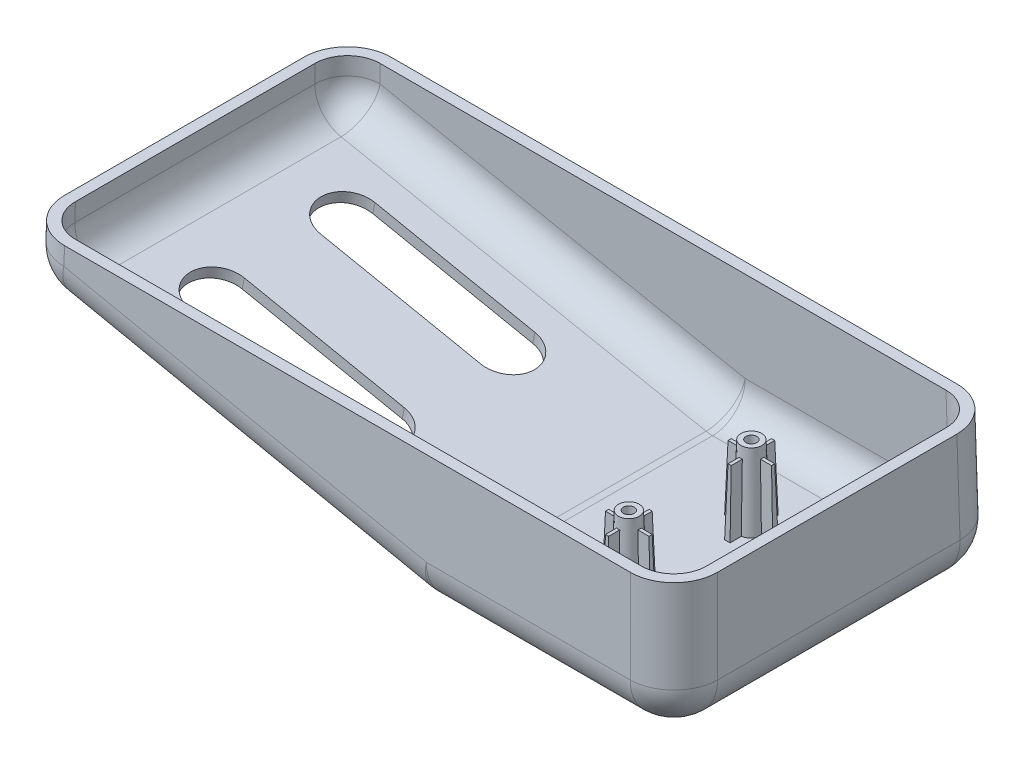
ISO-10303-21;
HEADER;
FILE_DESCRIPTION(('STEP AP214'),'2;1');
FILE_NAME('part.step','',(''),(''),'','','');
FILE_SCHEMA(('AUTOMOTIVE_DESIGN { 1 0 10303 214 1 1 1 1 }'));
ENDSEC;
DATA;
#1=APPLICATION_CONTEXT('core data for automotive mechanical design processes');
#2=APPLICATION_PROTOCOL_DEFINITION('international standard','automotive_design',2000,#1);
#3=PRODUCT_CONTEXT('',#1,'mechanical');
#4=PRODUCT('Part','Part','',(#3));
#5=PRODUCT_RELATED_PRODUCT_CATEGORY('part','',(#4));
#6=PRODUCT_DEFINITION_FORMATION('','',#4);
#7=PRODUCT_DEFINITION_CONTEXT('part definition',#1,'design');
#8=PRODUCT_DEFINITION('design','',#6,#7);
#9=PRODUCT_DEFINITION_SHAPE('','',#8);
#10=(LENGTH_UNIT() NAMED_UNIT(*) SI_UNIT(.MILLI.,.METRE.));
#11=(NAMED_UNIT(*) PLANE_ANGLE_UNIT() SI_UNIT($,.RADIAN.));
#12=(NAMED_UNIT(*) SI_UNIT($,.STERADIAN.) SOLID_ANGLE_UNIT());
#13=UNCERTAINTY_MEASURE_WITH_UNIT(LENGTH_MEASURE(1.E-05),#10,'distance_accuracy_value','');
#14=(GEOMETRIC_REPRESENTATION_CONTEXT(3) GLOBAL_UNCERTAINTY_ASSIGNED_CONTEXT((#13)) GLOBAL_UNIT_ASSIGNED_CONTEXT((#10,
#11,#12)) REPRESENTATION_CONTEXT('',''));
#15=CARTESIAN_POINT('',(0.,0.,0.));
#16=DIRECTION('',(0.,0.,1.));
#17=DIRECTION('',(1.,0.,0.));
#18=AXIS2_PLACEMENT_3D('',#15,#16,#17);
#19=CARTESIAN_POINT('',(-60.,0.,30.));
#20=DIRECTION('',(-0.999847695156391,0.0174524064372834,0.));
#21=DIRECTION('',(-0.0174524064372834,-0.999847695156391,0.));
#22=AXIS2_PLACEMENT_3D('',#19,#20,#21);
#23=PLANE('',#22);
#24=DIRECTION('',(0.,0.,-1.));
#25=VECTOR('',#24,1.);
#26=CARTESIAN_POINT('',(-60.0577300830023,-3.30735424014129,30.));
#27=LINE('',#26,#25);
#28=CARTESIAN_POINT('',(-60.0577300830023,-3.30735424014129,-22.0589485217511));
#29=VERTEX_POINT('',#28);
#30=CARTESIAN_POINT('',(-60.0577300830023,-3.30735424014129,22.0589485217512));
#31=VERTEX_POINT('',#30);
#32=EDGE_CURVE('E856',#29,#31,#27,.F.);
#33=ORIENTED_EDGE('',*,*,#32,.T.);
#34=DIRECTION('',(0.0174497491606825,0.999695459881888,-0.0174497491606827));
#35=VECTOR('',#34,1.);
#36=CARTESIAN_POINT('',(-60.0024355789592,-0.139534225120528,22.0036540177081));
#37=LINE('',#36,#35);
#38=CARTESIAN_POINT('',(-60.,0.,22.0012184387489));
#39=VERTEX_POINT('',#38);
#40=EDGE_CURVE('E755',#31,#39,#37,.T.);
#41=ORIENTED_EDGE('',*,*,#40,.T.);
#42=DIRECTION('',(0.,0.,-1.));
#43=VECTOR('',#42,1.);
#44=CARTESIAN_POINT('',(-60.,0.,30.));
#45=LINE('',#44,#43);
#46=CARTESIAN_POINT('',(-60.,0.,-22.0012184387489));
#47=VERTEX_POINT('',#46);
#48=EDGE_CURVE('E827',#39,#47,#45,.T.);
#49=ORIENTED_EDGE('',*,*,#48,.T.);
#50=DIRECTION('',(-0.0174497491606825,-0.999695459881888,-0.0174497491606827));
#51=VECTOR('',#50,1.);
#52=CARTESIAN_POINT('',(-60.1763708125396,-10.1042770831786,-22.1775892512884));
#53=LINE('',#52,#51);
#54=EDGE_CURVE('E854',#47,#29,#53,.T.);
#55=ORIENTED_EDGE('',*,*,#54,.T.);
#56=EDGE_LOOP('',(#33,#41,#49,#55));
#57=FACE_BOUND('',#56,.T.);
#58=ADVANCED_FACE('F32',(#57),#23,.T.);
#59=CARTESIAN_POINT('',(14.,-25.,30.));
#60=DIRECTION('',(0.198662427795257,0.980067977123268,0.));
#61=DIRECTION('',(-0.980067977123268,0.198662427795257,0.));
#62=AXIS2_PLACEMENT_3D('',#59,#60,#61);
#63=PLANE('',#62);
#64=DIRECTION('',(0.980067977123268,-0.198662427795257,0.));
#65=VECTOR('',#64,1.);
#66=CARTESIAN_POINT('',(-42.3456672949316,-13.5785809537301,-17.));
#67=LINE('',#66,#65);
#68=CARTESIAN_POINT('',(-42.3456672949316,-13.5785809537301,-17.));
#69=VERTEX_POINT('',#68);
#70=CARTESIAN_POINT('',(-12.9436279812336,-19.5384537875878,-17.));
#71=VERTEX_POINT('',#70);
#72=EDGE_CURVE('E2023',#69,#71,#67,.T.);
#73=ORIENTED_EDGE('',*,*,#72,.F.);
#74=CARTESIAN_POINT('',(-42.3456672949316,-13.5785809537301,-12.));
#75=DIRECTION('',(-0.198662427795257,-0.980067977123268,0.));
#76=DIRECTION('',(0.980067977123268,-0.198662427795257,0.));
#77=AXIS2_PLACEMENT_3D('',#74,#75,#76);
#78=CIRCLE('',#77,5.);
#79=CARTESIAN_POINT('',(-42.3456672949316,-13.5785809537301,-7.));
#80=VERTEX_POINT('',#79);
#81=EDGE_CURVE('E2021',#80,#69,#78,.T.);
#82=ORIENTED_EDGE('',*,*,#81,.F.);
#83=DIRECTION('',(-0.980067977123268,0.198662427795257,0.));
#84=VECTOR('',#83,1.);
#85=CARTESIAN_POINT('',(-42.3456672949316,-13.5785809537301,-7.));
#86=LINE('',#85,#84);
#87=CARTESIAN_POINT('',(-12.9436279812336,-19.5384537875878,-7.));
#88=VERTEX_POINT('',#87);
#89=EDGE_CURVE('E2029',#88,#80,#86,.T.);
#90=ORIENTED_EDGE('',*,*,#89,.F.);
#91=CARTESIAN_POINT('',(-12.9436279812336,-19.5384537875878,-12.));
#92=DIRECTION('',(-0.198662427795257,-0.980067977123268,0.));
#93=DIRECTION('',(0.980067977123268,-0.198662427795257,0.));
#94=AXIS2_PLACEMENT_3D('',#91,#92,#93);
#95=CIRCLE('',#94,5.);
#96=EDGE_CURVE('E2026',#71,#88,#95,.T.);
#97=ORIENTED_EDGE('',*,*,#96,.F.);
#98=EDGE_LOOP('',(#73,#82,#90,#97));
#99=FACE_BOUND('',#98,.T.);
#100=DIRECTION('',(0.980067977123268,-0.198662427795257,0.));
#101=VECTOR('',#100,1.);
#102=CARTESIAN_POINT('',(-42.3456672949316,-13.5785809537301,7.));
#103=LINE('',#102,#101);
#104=CARTESIAN_POINT('',(-42.3456672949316,-13.5785809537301,7.));
#105=VERTEX_POINT('',#104);
#106=CARTESIAN_POINT('',(-12.9436279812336,-19.5384537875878,7.));
#107=VERTEX_POINT('',#106);
#108=EDGE_CURVE('E2055',#105,#107,#103,.T.);
#109=ORIENTED_EDGE('',*,*,#108,.F.);
#110=CARTESIAN_POINT('',(-42.3456672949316,-13.5785809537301,12.));
#111=DIRECTION('',(-0.198662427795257,-0.980067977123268,0.));
#112=DIRECTION('',(0.980067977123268,-0.198662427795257,0.));
#113=AXIS2_PLACEMENT_3D('',#110,#111,#112);
#114=CIRCLE('',#113,5.);
#115=CARTESIAN_POINT('',(-42.3456672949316,-13.5785809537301,17.));
#116=VERTEX_POINT('',#115);
#117=EDGE_CURVE('E2053',#116,#105,#114,.T.);
#118=ORIENTED_EDGE('',*,*,#117,.F.);
#119=DIRECTION('',(-0.980067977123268,0.198662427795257,0.));
#120=VECTOR('',#119,1.);
#121=CARTESIAN_POINT('',(-42.3456672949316,-13.5785809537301,17.));
#122=LINE('',#121,#120);
#123=CARTESIAN_POINT('',(-12.9436279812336,-19.5384537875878,17.));
#124=VERTEX_POINT('',#123);
#125=EDGE_CURVE('E2061',#124,#116,#122,.T.);
#126=ORIENTED_EDGE('',*,*,#125,.F.);
#127=CARTESIAN_POINT('',(-12.9436279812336,-19.5384537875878,12.));
#128=DIRECTION('',(-0.198662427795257,-0.980067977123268,0.));
#129=DIRECTION('',(0.980067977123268,-0.198662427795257,0.));
#130=AXIS2_PLACEMENT_3D('',#127,#128,#129);
#131=CIRCLE('',#130,5.);
#132=EDGE_CURVE('E2058',#107,#124,#131,.T.);
#133=ORIENTED_EDGE('',*,*,#132,.F.);
#134=EDGE_LOOP('',(#109,#118,#126,#133));
#135=FACE_BOUND('',#134,.T.);
#136=DIRECTION('',(0.,0.,-1.));
#137=VECTOR('',#136,1.);
#138=CARTESIAN_POINT('',(13.2133494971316,-24.8405438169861,30.));
#139=LINE('',#138,#137);
#140=CARTESIAN_POINT('',(13.2133494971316,-24.8405438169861,-22.2955174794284));
#141=VERTEX_POINT('',#140);
#142=CARTESIAN_POINT('',(13.2133494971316,-24.8405438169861,22.2955174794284));
#143=VERTEX_POINT('',#142);
#144=EDGE_CURVE('E845',#141,#143,#139,.F.);
#145=ORIENTED_EDGE('',*,*,#144,.T.);
#146=DIRECTION('',(-0.980062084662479,0.198661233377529,-0.00346764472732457));
#147=VECTOR('',#146,1.);
#148=CARTESIAN_POINT('',(14.0261742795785,-25.0053055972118,22.298393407));
#149=LINE('',#148,#147);
#150=CARTESIAN_POINT('',(-53.6482479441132,-11.2875173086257,22.0589485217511));
#151=VERTEX_POINT('',#150);
#152=EDGE_CURVE('E851',#143,#151,#149,.T.);
#153=ORIENTED_EDGE('',*,*,#152,.T.);
#154=DIRECTION('',(0.,0.,1.));
#155=VECTOR('',#154,1.);
#156=CARTESIAN_POINT('',(-53.6482479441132,-11.2875173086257,30.));
#157=LINE('',#156,#155);
#158=CARTESIAN_POINT('',(-53.6482479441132,-11.2875173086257,-22.0589485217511));
#159=VERTEX_POINT('',#158);
#160=EDGE_CURVE('E849',#151,#159,#157,.F.);
#161=ORIENTED_EDGE('',*,*,#160,.T.);
#162=DIRECTION('',(0.980062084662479,-0.198661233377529,-0.00346764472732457));
#163=VECTOR('',#162,1.);
#164=CARTESIAN_POINT('',(14.0276573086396,-25.0056062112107,-22.2983986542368));
#165=LINE('',#164,#163);
#166=EDGE_CURVE('E847',#159,#141,#165,.T.);
#167=ORIENTED_EDGE('',*,*,#166,.T.);
#168=EDGE_LOOP('',(#145,#153,#161,#167));
#169=FACE_BOUND('',#168,.T.);
#170=ADVANCED_FACE('F640',(#99,#135,#169),#63,.F.);
#171=CARTESIAN_POINT('',(60.,-25.,30.));
#172=DIRECTION('',(0.,1.,0.));
#173=DIRECTION('',(-1.,0.,0.));
#174=AXIS2_PLACEMENT_3D('',#171,#172,#173);
#175=PLANE('',#174);
#176=DIRECTION('',(0.,0.,1.));
#177=VECTOR('',#176,1.);
#178=CARTESIAN_POINT('',(52.2955174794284,-25.,30.));
#179=LINE('',#178,#177);
#180=CARTESIAN_POINT('',(52.2955174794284,-25.,-22.2955174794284));
#181=VERTEX_POINT('',#180);
#182=CARTESIAN_POINT('',(52.2955174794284,-25.,22.2955174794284));
#183=VERTEX_POINT('',#182);
#184=EDGE_CURVE('E762',#181,#183,#179,.T.);
#185=ORIENTED_EDGE('',*,*,#184,.T.);
#186=DIRECTION('',(-1.,0.,0.));
#187=VECTOR('',#186,1.);
#188=CARTESIAN_POINT('',(60.,-25.,22.2955174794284));
#189=LINE('',#188,#187);
#190=CARTESIAN_POINT('',(14.8026489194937,-25.,22.2955174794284));
#191=VERTEX_POINT('',#190);
#192=EDGE_CURVE('E767',#183,#191,#189,.T.);
#193=ORIENTED_EDGE('',*,*,#192,.T.);
#194=DIRECTION('',(0.,0.,-1.));
#195=VECTOR('',#194,1.);
#196=CARTESIAN_POINT('',(14.8026489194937,-25.,30.));
#197=LINE('',#196,#195);
#198=CARTESIAN_POINT('',(14.8026489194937,-25.,-22.2955174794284));
#199=VERTEX_POINT('',#198);
#200=EDGE_CURVE('E764',#191,#199,#197,.T.);
#201=ORIENTED_EDGE('',*,*,#200,.T.);
#202=DIRECTION('',(1.,0.,0.));
#203=VECTOR('',#202,1.);
#204=CARTESIAN_POINT('',(60.4363766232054,-25.,-22.2955174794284));
#205=LINE('',#204,#203);
#206=EDGE_CURVE('E760',#199,#181,#205,.T.);
#207=ORIENTED_EDGE('',*,*,#206,.T.);
#208=EDGE_LOOP('',(#185,#193,#201,#207));
#209=FACE_BOUND('',#208,.T.);
#210=ADVANCED_FACE('F646',(#209),#175,.F.);
#211=CARTESIAN_POINT('',(60.,0.,30.));
#212=DIRECTION('',(0.999847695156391,0.0174524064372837,0.));
#213=DIRECTION('',(-0.0174524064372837,0.999847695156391,0.));
#214=AXIS2_PLACEMENT_3D('',#211,#212,#213);
#215=PLANE('',#214);
#216=DIRECTION('',(0.,0.,-1.));
#217=VECTOR('',#216,1.);
#218=CARTESIAN_POINT('',(60.,0.,30.));
#219=LINE('',#218,#217);
#220=CARTESIAN_POINT('',(60.,0.,22.0012184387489));
#221=VERTEX_POINT('',#220);
#222=CARTESIAN_POINT('',(60.,0.,-22.0012184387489));
#223=VERTEX_POINT('',#222);
#224=EDGE_CURVE('E833',#221,#223,#219,.T.);
#225=ORIENTED_EDGE('',*,*,#224,.F.);
#226=DIRECTION('',(0.0174497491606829,-0.999695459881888,0.0174497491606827));
#227=VECTOR('',#226,1.);
#228=CARTESIAN_POINT('',(60.0024355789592,-0.139534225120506,22.0036540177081));
#229=LINE('',#228,#227);
#230=CARTESIAN_POINT('',(60.2942990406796,-16.8603807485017,22.2955174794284));
#231=VERTEX_POINT('',#230);
#232=EDGE_CURVE('E773',#221,#231,#229,.T.);
#233=ORIENTED_EDGE('',*,*,#232,.T.);
#234=DIRECTION('',(0.,0.,-1.));
#235=VECTOR('',#234,1.);
#236=CARTESIAN_POINT('',(60.2942990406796,-16.8603807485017,30.));
#237=LINE('',#236,#235);
#238=CARTESIAN_POINT('',(60.2942990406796,-16.8603807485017,-22.2955174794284));
#239=VERTEX_POINT('',#238);
#240=EDGE_CURVE('E771',#231,#239,#237,.T.);
#241=ORIENTED_EDGE('',*,*,#240,.T.);
#242=DIRECTION('',(-0.0174497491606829,0.999695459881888,0.0174497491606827));
#243=VECTOR('',#242,1.);
#244=CARTESIAN_POINT('',(60.0024355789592,-0.139534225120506,-22.0036540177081));
#245=LINE('',#244,#243);
#246=EDGE_CURVE('E769',#239,#223,#245,.T.);
#247=ORIENTED_EDGE('',*,*,#246,.T.);
#248=EDGE_LOOP('',(#225,#233,#241,#247));
#249=FACE_BOUND('',#248,.T.);
#250=ADVANCED_FACE('F656',(#249),#215,.T.);
#251=CARTESIAN_POINT('',(-60.,0.,30.));
#252=DIRECTION('',(0.,-1.,0.));
#253=DIRECTION('',(1.,0.,0.));
#254=AXIS2_PLACEMENT_3D('',#251,#252,#253);
#255=PLANE('',#254);
#256=CARTESIAN_POINT('',(51.9987813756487,0.,21.9987813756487));
#257=DIRECTION('',(0.,-1.,0.));
#258=DIRECTION('',(-0.707106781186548,0.,-0.707106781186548));
#259=AXIS2_PLACEMENT_3D('',#256,#257,#258);
#260=ELLIPSE('',#259,6.0018277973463,6.);
#261=CARTESIAN_POINT('',(52.0006091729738,0.,27.9996953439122));
#262=VERTEX_POINT('',#261);
#263=CARTESIAN_POINT('',(57.9996953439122,0.,22.0006091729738));
#264=VERTEX_POINT('',#263);
#265=EDGE_CURVE('E783',#262,#264,#260,.F.);
#266=ORIENTED_EDGE('',*,*,#265,.F.);
#267=DIRECTION('',(1.,0.,0.));
#268=VECTOR('',#267,1.);
#269=CARTESIAN_POINT('',(-60.,0.,27.9996953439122));
#270=LINE('',#269,#268);
#271=CARTESIAN_POINT('',(-52.0006091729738,0.,27.9996953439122));
#272=VERTEX_POINT('',#271);
#273=EDGE_CURVE('E2181',#262,#272,#270,.F.);
#274=ORIENTED_EDGE('',*,*,#273,.T.);
#275=CARTESIAN_POINT('',(-51.9987813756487,0.,21.9987813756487));
#276=DIRECTION('',(0.,-1.,0.));
#277=DIRECTION('',(-0.707106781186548,0.,0.707106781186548));
#278=AXIS2_PLACEMENT_3D('',#275,#276,#277);
#279=ELLIPSE('',#278,6.0018277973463,6.);
#280=CARTESIAN_POINT('',(-57.9996953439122,0.,22.0006091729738));
#281=VERTEX_POINT('',#280);
#282=EDGE_CURVE('E2182',#281,#272,#279,.F.);
#283=ORIENTED_EDGE('',*,*,#282,.F.);
#284=DIRECTION('',(0.,0.,1.));
#285=VECTOR('',#284,1.);
#286=CARTESIAN_POINT('',(-57.9996953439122,0.,30.));
#287=LINE('',#286,#285);
#288=CARTESIAN_POINT('',(-57.9996953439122,0.,-22.0006091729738));
#289=VERTEX_POINT('',#288);
#290=EDGE_CURVE('E2178',#281,#289,#287,.F.);
#291=ORIENTED_EDGE('',*,*,#290,.T.);
#292=CARTESIAN_POINT('',(-51.9987813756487,0.,-21.9987813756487));
#293=DIRECTION('',(0.,-1.,0.));
#294=DIRECTION('',(-0.707106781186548,0.,-0.707106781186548));
#295=AXIS2_PLACEMENT_3D('',#292,#293,#294);
#296=ELLIPSE('',#295,6.0018277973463,6.);
#297=CARTESIAN_POINT('',(-52.0006091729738,0.,-27.9996953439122));
#298=VERTEX_POINT('',#297);
#299=EDGE_CURVE('E2184',#298,#289,#296,.F.);
#300=ORIENTED_EDGE('',*,*,#299,.F.);
#301=DIRECTION('',(-1.,0.,0.));
#302=VECTOR('',#301,1.);
#303=CARTESIAN_POINT('',(-60.,0.,-27.9996953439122));
#304=LINE('',#303,#302);
#305=CARTESIAN_POINT('',(52.0006091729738,0.,-27.9996953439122));
#306=VERTEX_POINT('',#305);
#307=EDGE_CURVE('E2102',#306,#298,#304,.T.);
#308=ORIENTED_EDGE('',*,*,#307,.F.);
#309=CARTESIAN_POINT('',(51.9987813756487,0.,-21.9987813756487));
#310=DIRECTION('',(0.,-1.,0.));
#311=DIRECTION('',(-0.707106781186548,0.,0.707106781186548));
#312=AXIS2_PLACEMENT_3D('',#309,#310,#311);
#313=ELLIPSE('',#312,6.0018277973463,6.);
#314=CARTESIAN_POINT('',(57.9996953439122,0.,-22.0006091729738));
#315=VERTEX_POINT('',#314);
#316=EDGE_CURVE('E2110',#315,#306,#313,.F.);
#317=ORIENTED_EDGE('',*,*,#316,.F.);
#318=DIRECTION('',(0.,0.,1.));
#319=VECTOR('',#318,1.);
#320=CARTESIAN_POINT('',(57.9996953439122,0.,30.));
#321=LINE('',#320,#319);
#322=EDGE_CURVE('E2138',#264,#315,#321,.F.);
#323=ORIENTED_EDGE('',*,*,#322,.F.);
#324=EDGE_LOOP('',(#266,#274,#283,#291,#300,#308,#317,#323));
#325=FACE_BOUND('',#324,.T.);
#326=DIRECTION('',(-1.,0.,0.));
#327=VECTOR('',#326,1.);
#328=CARTESIAN_POINT('',(-60.,0.,30.));
#329=LINE('',#328,#327);
#330=CARTESIAN_POINT('',(52.0012184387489,0.,30.));
#331=VERTEX_POINT('',#330);
#332=CARTESIAN_POINT('',(-52.0012184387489,0.,30.));
#333=VERTEX_POINT('',#332);
#334=EDGE_CURVE('E821',#331,#333,#329,.T.);
#335=ORIENTED_EDGE('',*,*,#334,.F.);
#336=CARTESIAN_POINT('',(51.9987813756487,0.,21.9987813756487));
#337=DIRECTION('',(0.,-1.,0.));
#338=DIRECTION('',(-0.707106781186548,0.,-0.707106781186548));
#339=AXIS2_PLACEMENT_3D('',#336,#337,#338);
#340=ELLIPSE('',#339,8.00243706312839,8.);
#341=EDGE_CURVE('E11',#331,#221,#340,.F.);
#342=ORIENTED_EDGE('',*,*,#341,.T.);
#343=ORIENTED_EDGE('',*,*,#224,.T.);
#344=CARTESIAN_POINT('',(51.9987813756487,0.,-21.9987813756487));
#345=DIRECTION('',(0.,-1.,0.));
#346=DIRECTION('',(-0.707106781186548,0.,0.707106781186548));
#347=AXIS2_PLACEMENT_3D('',#344,#345,#346);
#348=ELLIPSE('',#347,8.00243706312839,8.);
#349=CARTESIAN_POINT('',(52.0012184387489,0.,-30.));
#350=VERTEX_POINT('',#349);
#351=EDGE_CURVE('E775',#223,#350,#348,.F.);
#352=ORIENTED_EDGE('',*,*,#351,.T.);
#353=DIRECTION('',(-1.,0.,0.));
#354=VECTOR('',#353,1.);
#355=CARTESIAN_POINT('',(-60.,0.,-30.));
#356=LINE('',#355,#354);
#357=CARTESIAN_POINT('',(-52.0012184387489,0.,-30.));
#358=VERTEX_POINT('',#357);
#359=EDGE_CURVE('E819',#350,#358,#356,.T.);
#360=ORIENTED_EDGE('',*,*,#359,.T.);
#361=CARTESIAN_POINT('',(-51.9987813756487,0.,-21.9987813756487));
#362=DIRECTION('',(0.,-1.,0.));
#363=DIRECTION('',(-0.707106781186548,0.,-0.707106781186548));
#364=AXIS2_PLACEMENT_3D('',#361,#362,#363);
#365=ELLIPSE('',#364,8.00243706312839,8.);
#366=EDGE_CURVE('E777',#358,#47,#365,.F.);
#367=ORIENTED_EDGE('',*,*,#366,.T.);
#368=ORIENTED_EDGE('',*,*,#48,.F.);
#369=CARTESIAN_POINT('',(-51.9987813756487,0.,21.9987813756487));
#370=DIRECTION('',(0.,-1.,0.));
#371=DIRECTION('',(-0.707106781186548,0.,0.707106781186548));
#372=AXIS2_PLACEMENT_3D('',#369,#370,#371);
#373=ELLIPSE('',#372,8.00243706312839,8.);
#374=EDGE_CURVE('E41',#39,#333,#373,.F.);
#375=ORIENTED_EDGE('',*,*,#374,.T.);
#376=EDGE_LOOP('',(#335,#342,#343,#352,#360,#367,#368,#375));
#377=FACE_BOUND('',#376,.T.);
#378=ADVANCED_FACE('F659',(#325,#377),#255,.F.);
#379=CARTESIAN_POINT('',(-60.,0.,30.));
#380=DIRECTION('',(0.,0.0174524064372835,0.999847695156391));
#381=DIRECTION('',(0.,-0.999847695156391,0.0174524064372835));
#382=AXIS2_PLACEMENT_3D('',#379,#380,#381);
#383=PLANE('',#382);
#384=DIRECTION('',(1.,0.,0.));
#385=VECTOR('',#384,1.);
#386=CARTESIAN_POINT('',(-60.,-16.8603807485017,30.2942990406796));
#387=LINE('',#386,#385);
#388=CARTESIAN_POINT('',(14.8026489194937,-16.8603807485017,30.2942990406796));
#389=VERTEX_POINT('',#388);
#390=CARTESIAN_POINT('',(52.2955174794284,-16.8603807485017,30.2942990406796));
#391=VERTEX_POINT('',#390);
#392=EDGE_CURVE('E841',#389,#391,#387,.T.);
#393=ORIENTED_EDGE('',*,*,#392,.T.);
#394=DIRECTION('',(0.0174497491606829,-0.999695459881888,0.0174497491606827));
#395=VECTOR('',#394,1.);
#396=CARTESIAN_POINT('',(51.9671147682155,1.95379797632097,29.9658963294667));
#397=LINE('',#396,#395);
#398=EDGE_CURVE('E843',#391,#331,#397,.F.);
#399=ORIENTED_EDGE('',*,*,#398,.T.);
#400=ORIENTED_EDGE('',*,*,#334,.T.);
#401=DIRECTION('',(0.0174497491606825,0.999695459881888,-0.0174497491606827));
#402=VECTOR('',#401,1.);
#403=CARTESIAN_POINT('',(-52.0036540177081,-0.139534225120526,30.0024355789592));
#404=LINE('',#403,#402);
#405=CARTESIAN_POINT('',(-52.0589485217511,-3.30735424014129,30.0577300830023));
#406=VERTEX_POINT('',#405);
#407=EDGE_CURVE('E836',#333,#406,#404,.F.);
#408=ORIENTED_EDGE('',*,*,#407,.T.);
#409=DIRECTION('',(0.980062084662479,-0.198661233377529,0.00346764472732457));
#410=VECTOR('',#409,1.);
#411=CARTESIAN_POINT('',(-60.3306399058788,-1.63066004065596,30.0284632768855));
#412=LINE('',#411,#410);
#413=EDGE_CURVE('E838',#406,#389,#412,.T.);
#414=ORIENTED_EDGE('',*,*,#413,.T.);
#415=EDGE_LOOP('',(#393,#399,#400,#408,#414));
#416=FACE_BOUND('',#415,.T.);
#417=ADVANCED_FACE('F654',(#416),#383,.T.);
#418=CARTESIAN_POINT('',(-60.,0.,-30.));
#419=DIRECTION('',(0.,0.0174524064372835,-0.999847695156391));
#420=DIRECTION('',(0.,0.999847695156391,0.0174524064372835));
#421=AXIS2_PLACEMENT_3D('',#418,#419,#420);
#422=PLANE('',#421);
#423=DIRECTION('',(0.980062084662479,-0.198661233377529,-0.00346764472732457));
#424=VECTOR('',#423,1.);
#425=CARTESIAN_POINT('',(-58.5569785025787,-1.99018600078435,-30.0347388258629));
#426=LINE('',#425,#424);
#427=CARTESIAN_POINT('',(14.8026489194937,-16.8603807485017,-30.2942990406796));
#428=VERTEX_POINT('',#427);
#429=CARTESIAN_POINT('',(-52.0589485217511,-3.30735424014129,-30.0577300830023));
#430=VERTEX_POINT('',#429);
#431=EDGE_CURVE('E750',#428,#430,#426,.F.);
#432=ORIENTED_EDGE('',*,*,#431,.T.);
#433=DIRECTION('',(0.0174497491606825,0.999695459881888,0.0174497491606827));
#434=VECTOR('',#433,1.);
#435=CARTESIAN_POINT('',(-52.0036540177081,-0.139534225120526,-30.0024355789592));
#436=LINE('',#435,#434);
#437=EDGE_CURVE('E753',#430,#358,#436,.T.);
#438=ORIENTED_EDGE('',*,*,#437,.T.);
#439=ORIENTED_EDGE('',*,*,#359,.F.);
#440=DIRECTION('',(0.0174497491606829,-0.999695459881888,-0.0174497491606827));
#441=VECTOR('',#440,1.);
#442=CARTESIAN_POINT('',(52.4400306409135,-25.1395342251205,-30.4388122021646));
#443=LINE('',#442,#441);
#444=CARTESIAN_POINT('',(52.2955174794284,-16.8603807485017,-30.2942990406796));
#445=VERTEX_POINT('',#444);
#446=EDGE_CURVE('E751',#350,#445,#443,.T.);
#447=ORIENTED_EDGE('',*,*,#446,.T.);
#448=DIRECTION('',(1.,0.,0.));
#449=VECTOR('',#448,1.);
#450=CARTESIAN_POINT('',(14.,-16.8603807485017,-30.2942990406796));
#451=LINE('',#450,#449);
#452=EDGE_CURVE('E745',#445,#428,#451,.F.);
#453=ORIENTED_EDGE('',*,*,#452,.T.);
#454=EDGE_LOOP('',(#432,#438,#439,#447,#453));
#455=FACE_BOUND('',#454,.T.);
#456=ADVANCED_FACE('F651',(#455),#422,.T.);
#457=CARTESIAN_POINT('',(51.9853843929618,0.767512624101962,-21.9853843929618));
#458=DIRECTION('',(-0.0174497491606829,0.999695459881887,0.0174497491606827));
#459=DIRECTION('',(-0.999847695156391,-0.0174524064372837,0.));
#460=AXIS2_PLACEMENT_3D('',#457,#458,#459);
#461=CYLINDRICAL_SURFACE('',#460,8.);
#462=CARTESIAN_POINT('',(52.2955174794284,-17.,-22.2955174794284));
#463=DIRECTION('',(0.017449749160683,-0.999695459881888,-0.0174497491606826));
#464=DIRECTION('',(0.999847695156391,0.0174524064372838,0.));
#465=AXIS2_PLACEMENT_3D('',#462,#463,#464);
#466=CIRCLE('',#465,8.);
#467=EDGE_CURVE('E36',#445,#239,#466,.T.);
#468=ORIENTED_EDGE('',*,*,#467,.F.);
#469=ORIENTED_EDGE('',*,*,#446,.F.);
#470=ORIENTED_EDGE('',*,*,#351,.F.);
#471=ORIENTED_EDGE('',*,*,#246,.F.);
#472=EDGE_LOOP('',(#468,#469,#470,#471));
#473=FACE_BOUND('',#472,.T.);
#474=ADVANCED_FACE('F34',(#473),#461,.T.);
#475=CARTESIAN_POINT('',(52.2955174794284,-17.,-22.2955174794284));
#476=DIRECTION('',(0.,0.,1.));
#477=DIRECTION('',(1.,0.,0.));
#478=AXIS2_PLACEMENT_3D('',#475,#476,#477);
#479=SPHERICAL_SURFACE('',#478,8.);
#480=CARTESIAN_POINT('',(52.2955174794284,-17.,-22.2955174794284));
#481=DIRECTION('',(1.,0.,0.));
#482=DIRECTION('',(0.,0.,-1.));
#483=AXIS2_PLACEMENT_3D('',#480,#481,#482);
#484=CIRCLE('',#483,8.);
#485=EDGE_CURVE('E735',#445,#181,#484,.F.);
#486=ORIENTED_EDGE('',*,*,#485,.F.);
#487=ORIENTED_EDGE('',*,*,#467,.T.);
#488=CARTESIAN_POINT('',(52.2955174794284,-17.,-22.2955174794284));
#489=DIRECTION('',(0.,0.,-1.));
#490=DIRECTION('',(0.,1.,0.));
#491=AXIS2_PLACEMENT_3D('',#488,#489,#490);
#492=CIRCLE('',#491,8.);
#493=EDGE_CURVE('E739',#181,#239,#492,.F.);
#494=ORIENTED_EDGE('',*,*,#493,.F.);
#495=EDGE_LOOP('',(#486,#487,#494));
#496=FACE_BOUND('',#495,.T.);
#497=ADVANCED_FACE('F723',(#496),#479,.T.);
#498=CARTESIAN_POINT('',(-51.9853843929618,0.767512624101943,-21.9853843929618));
#499=DIRECTION('',(-0.0174497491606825,-0.999695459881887,-0.0174497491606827));
#500=DIRECTION('',(0.,0.0174524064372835,-0.999847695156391));
#501=AXIS2_PLACEMENT_3D('',#498,#499,#500);
#502=CYLINDRICAL_SURFACE('',#501,8.);
#503=ORIENTED_EDGE('',*,*,#366,.F.);
#504=ORIENTED_EDGE('',*,*,#437,.F.);
#505=CARTESIAN_POINT('',(-52.0589485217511,-3.44697349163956,-22.0589485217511));
#506=DIRECTION('',(-0.0174497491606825,-0.999695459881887,-0.0174497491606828));
#507=DIRECTION('',(0.,0.0174524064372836,-0.999847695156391));
#508=AXIS2_PLACEMENT_3D('',#505,#506,#507);
#509=CIRCLE('',#508,8.);
#510=EDGE_CURVE('E814',#29,#430,#509,.T.);
#511=ORIENTED_EDGE('',*,*,#510,.F.);
#512=ORIENTED_EDGE('',*,*,#54,.F.);
#513=EDGE_LOOP('',(#503,#504,#511,#512));
#514=FACE_BOUND('',#513,.T.);
#515=ADVANCED_FACE('F720',(#514),#502,.T.);
#516=CARTESIAN_POINT('',(51.9671147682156,1.8141787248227,21.9671147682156));
#517=DIRECTION('',(-0.0174497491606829,0.999695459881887,-0.0174497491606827));
#518=DIRECTION('',(-0.999847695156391,-0.0174524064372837,0.));
#519=AXIS2_PLACEMENT_3D('',#516,#517,#518);
#520=CYLINDRICAL_SURFACE('',#519,8.);
#521=ORIENTED_EDGE('',*,*,#341,.F.);
#522=ORIENTED_EDGE('',*,*,#398,.F.);
#523=CARTESIAN_POINT('',(52.2955174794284,-17.,22.2955174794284));
#524=DIRECTION('',(0.017449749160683,-0.999695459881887,0.0174497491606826));
#525=DIRECTION('',(0.999847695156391,0.0174524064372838,0.));
#526=AXIS2_PLACEMENT_3D('',#523,#524,#525);
#527=CIRCLE('',#526,8.);
#528=EDGE_CURVE('E811',#231,#391,#527,.T.);
#529=ORIENTED_EDGE('',*,*,#528,.F.);
#530=ORIENTED_EDGE('',*,*,#232,.F.);
#531=EDGE_LOOP('',(#521,#522,#529,#530));
#532=FACE_BOUND('',#531,.T.);
#533=ADVANCED_FACE('F716',(#532),#520,.T.);
#534=CARTESIAN_POINT('',(52.2955174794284,-17.,30.));
#535=DIRECTION('',(0.,0.,1.));
#536=DIRECTION('',(1.,0.,0.));
#537=AXIS2_PLACEMENT_3D('',#534,#535,#536);
#538=CYLINDRICAL_SURFACE('',#537,8.);
#539=ORIENTED_EDGE('',*,*,#493,.T.);
#540=ORIENTED_EDGE('',*,*,#240,.F.);
#541=CARTESIAN_POINT('',(52.2955174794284,-17.,22.2955174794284));
#542=DIRECTION('',(0.,0.,1.));
#543=DIRECTION('',(1.,0.,0.));
#544=AXIS2_PLACEMENT_3D('',#541,#542,#543);
#545=CIRCLE('',#544,8.);
#546=EDGE_CURVE('E808',#183,#231,#545,.T.);
#547=ORIENTED_EDGE('',*,*,#546,.F.);
#548=ORIENTED_EDGE('',*,*,#184,.F.);
#549=EDGE_LOOP('',(#539,#540,#547,#548));
#550=FACE_BOUND('',#549,.T.);
#551=ADVANCED_FACE('F712',(#550),#538,.T.);
#552=CARTESIAN_POINT('',(60.,-17.,-22.2955174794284));
#553=DIRECTION('',(-1.,0.,0.));
#554=DIRECTION('',(0.,-1.,0.));
#555=AXIS2_PLACEMENT_3D('',#552,#553,#554);
#556=CYLINDRICAL_SURFACE('',#555,8.);
#557=ORIENTED_EDGE('',*,*,#485,.T.);
#558=ORIENTED_EDGE('',*,*,#206,.F.);
#559=CARTESIAN_POINT('',(14.8026489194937,-17.,-22.2955174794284));
#560=DIRECTION('',(-1.,0.,0.));
#561=DIRECTION('',(0.,-1.,0.));
#562=AXIS2_PLACEMENT_3D('',#559,#560,#561);
#563=CIRCLE('',#562,8.);
#564=EDGE_CURVE('E747',#428,#199,#563,.T.);
#565=ORIENTED_EDGE('',*,*,#564,.F.);
#566=ORIENTED_EDGE('',*,*,#452,.F.);
#567=EDGE_LOOP('',(#557,#558,#565,#566));
#568=FACE_BOUND('',#567,.T.);
#569=ADVANCED_FACE('F708',(#568),#556,.T.);
#570=CARTESIAN_POINT('',(15.4115632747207,-17.123428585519,-22.2976719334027));
#571=DIRECTION('',(-0.980062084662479,0.198661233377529,0.00346764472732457));
#572=DIRECTION('',(-0.198662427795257,-0.980067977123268,0.));
#573=AXIS2_PLACEMENT_3D('',#570,#571,#572);
#574=CYLINDRICAL_SURFACE('',#573,8.);
#575=CARTESIAN_POINT('',(-52.0589485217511,-3.44697349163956,-22.0589485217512));
#576=DIRECTION('',(-0.980062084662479,0.198661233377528,0.00346764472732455));
#577=DIRECTION('',(-0.198662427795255,-0.980067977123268,0.));
#578=AXIS2_PLACEMENT_3D('',#575,#576,#577);
#579=CIRCLE('',#578,8.);
#580=EDGE_CURVE('E742',#430,#159,#579,.T.);
#581=ORIENTED_EDGE('',*,*,#580,.F.);
#582=ORIENTED_EDGE('',*,*,#431,.F.);
#583=CARTESIAN_POINT('',(14.8026489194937,-17.,-22.2955174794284));
#584=DIRECTION('',(0.980062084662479,-0.198661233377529,-0.00346764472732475));
#585=DIRECTION('',(0.198662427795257,0.980067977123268,0.));
#586=AXIS2_PLACEMENT_3D('',#583,#584,#585);
#587=CIRCLE('',#586,8.);
#588=EDGE_CURVE('E805',#141,#428,#587,.T.);
#589=ORIENTED_EDGE('',*,*,#588,.F.);
#590=ORIENTED_EDGE('',*,*,#166,.F.);
#591=EDGE_LOOP('',(#581,#582,#589,#590));
#592=FACE_BOUND('',#591,.T.);
#593=ADVANCED_FACE('F704',(#592),#574,.T.);
#594=CARTESIAN_POINT('',(-52.0589485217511,-3.44697349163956,-22.0589485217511));
#595=DIRECTION('',(0.,0.,1.));
#596=DIRECTION('',(1.,0.,0.));
#597=AXIS2_PLACEMENT_3D('',#594,#595,#596);
#598=SPHERICAL_SURFACE('',#597,8.);
#599=ORIENTED_EDGE('',*,*,#510,.T.);
#600=ORIENTED_EDGE('',*,*,#580,.T.);
#601=CARTESIAN_POINT('',(-52.0589485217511,-3.44697349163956,-22.0589485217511));
#602=DIRECTION('',(0.,0.,-1.));
#603=DIRECTION('',(-1.,0.,0.));
#604=AXIS2_PLACEMENT_3D('',#601,#602,#603);
#605=CIRCLE('',#604,8.);
#606=EDGE_CURVE('E802',#29,#159,#605,.F.);
#607=ORIENTED_EDGE('',*,*,#606,.F.);
#608=EDGE_LOOP('',(#599,#600,#607));
#609=FACE_BOUND('',#608,.T.);
#610=ADVANCED_FACE('F700',(#609),#598,.T.);
#611=CARTESIAN_POINT('',(52.2955174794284,-17.,22.2955174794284));
#612=DIRECTION('',(0.,0.,1.));
#613=DIRECTION('',(1.,0.,0.));
#614=AXIS2_PLACEMENT_3D('',#611,#612,#613);
#615=SPHERICAL_SURFACE('',#614,8.);
#616=ORIENTED_EDGE('',*,*,#546,.T.);
#617=ORIENTED_EDGE('',*,*,#528,.T.);
#618=CARTESIAN_POINT('',(52.2955174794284,-17.,22.2955174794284));
#619=DIRECTION('',(1.,0.,0.));
#620=DIRECTION('',(0.,1.,0.));
#621=AXIS2_PLACEMENT_3D('',#618,#619,#620);
#622=CIRCLE('',#621,8.);
#623=EDGE_CURVE('E799',#183,#391,#622,.F.);
#624=ORIENTED_EDGE('',*,*,#623,.F.);
#625=EDGE_LOOP('',(#616,#617,#624));
#626=FACE_BOUND('',#625,.T.);
#627=ADVANCED_FACE('F696',(#626),#615,.T.);
#628=CARTESIAN_POINT('',(14.8026489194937,-17.,-22.2955174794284));
#629=DIRECTION('',(0.,0.,1.));
#630=DIRECTION('',(1.,0.,0.));
#631=AXIS2_PLACEMENT_3D('',#628,#629,#630);
#632=SPHERICAL_SURFACE('',#631,8.);
#633=ORIENTED_EDGE('',*,*,#588,.T.);
#634=ORIENTED_EDGE('',*,*,#564,.T.);
#635=CARTESIAN_POINT('',(14.8026489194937,-17.,-22.2955174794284));
#636=DIRECTION('',(0.,0.,-1.));
#637=DIRECTION('',(-1.,0.,0.));
#638=AXIS2_PLACEMENT_3D('',#635,#636,#637);
#639=CIRCLE('',#638,8.);
#640=EDGE_CURVE('E797',#141,#199,#639,.F.);
#641=ORIENTED_EDGE('',*,*,#640,.F.);
#642=EDGE_LOOP('',(#633,#634,#641));
#643=FACE_BOUND('',#642,.T.);
#644=ADVANCED_FACE('F692',(#643),#632,.T.);
#645=CARTESIAN_POINT('',(-52.0589485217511,-3.44697349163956,30.));
#646=DIRECTION('',(0.,0.,1.));
#647=DIRECTION('',(1.,0.,0.));
#648=AXIS2_PLACEMENT_3D('',#645,#646,#647);
#649=CYLINDRICAL_SURFACE('',#648,8.);
#650=ORIENTED_EDGE('',*,*,#606,.T.);
#651=ORIENTED_EDGE('',*,*,#160,.F.);
#652=CARTESIAN_POINT('',(-52.0589485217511,-3.44697349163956,22.0589485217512));
#653=DIRECTION('',(0.,0.,1.));
#654=DIRECTION('',(0.,-1.,0.));
#655=AXIS2_PLACEMENT_3D('',#652,#653,#654);
#656=CIRCLE('',#655,8.);
#657=EDGE_CURVE('E794',#31,#151,#656,.T.);
#658=ORIENTED_EDGE('',*,*,#657,.F.);
#659=ORIENTED_EDGE('',*,*,#32,.F.);
#660=EDGE_LOOP('',(#650,#651,#658,#659));
#661=FACE_BOUND('',#660,.T.);
#662=ADVANCED_FACE('F688',(#661),#649,.T.);
#663=CARTESIAN_POINT('',(-52.0036540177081,-0.279153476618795,22.0036540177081));
#664=DIRECTION('',(-0.0174497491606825,-0.999695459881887,0.0174497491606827));
#665=DIRECTION('',(0.,-0.0174524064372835,-0.999847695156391));
#666=AXIS2_PLACEMENT_3D('',#663,#664,#665);
#667=CYLINDRICAL_SURFACE('',#666,8.);
#668=ORIENTED_EDGE('',*,*,#374,.F.);
#669=ORIENTED_EDGE('',*,*,#40,.F.);
#670=CARTESIAN_POINT('',(-52.0589485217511,-3.44697349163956,22.0589485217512));
#671=DIRECTION('',(-0.0174497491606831,-0.999695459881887,0.0174497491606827));
#672=DIRECTION('',(0.999847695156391,-0.0174524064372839,0.));
#673=AXIS2_PLACEMENT_3D('',#670,#671,#672);
#674=CIRCLE('',#673,8.);
#675=EDGE_CURVE('E791',#406,#31,#674,.T.);
#676=ORIENTED_EDGE('',*,*,#675,.F.);
#677=ORIENTED_EDGE('',*,*,#407,.F.);
#678=EDGE_LOOP('',(#668,#669,#676,#677));
#679=FACE_BOUND('',#678,.T.);
#680=ADVANCED_FACE('F684',(#679),#667,.T.);
#681=CARTESIAN_POINT('',(-60.,-17.,22.2955174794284));
#682=DIRECTION('',(-1.,0.,0.));
#683=DIRECTION('',(0.,-1.,0.));
#684=AXIS2_PLACEMENT_3D('',#681,#682,#683);
#685=CYLINDRICAL_SURFACE('',#684,8.);
#686=ORIENTED_EDGE('',*,*,#623,.T.);
#687=ORIENTED_EDGE('',*,*,#392,.F.);
#688=CARTESIAN_POINT('',(14.8026489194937,-17.,22.2955174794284));
#689=DIRECTION('',(-1.,0.,0.));
#690=DIRECTION('',(0.,0.,1.));
#691=AXIS2_PLACEMENT_3D('',#688,#689,#690);
#692=CIRCLE('',#691,8.);
#693=EDGE_CURVE('E788',#191,#389,#692,.T.);
#694=ORIENTED_EDGE('',*,*,#693,.F.);
#695=ORIENTED_EDGE('',*,*,#192,.F.);
#696=EDGE_LOOP('',(#686,#687,#694,#695));
#697=FACE_BOUND('',#696,.T.);
#698=ADVANCED_FACE('F680',(#697),#685,.T.);
#699=CARTESIAN_POINT('',(14.8026489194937,-17.,30.));
#700=DIRECTION('',(0.,0.,-1.));
#701=DIRECTION('',(-1.,0.,0.));
#702=AXIS2_PLACEMENT_3D('',#699,#700,#701);
#703=CYLINDRICAL_SURFACE('',#702,8.);
#704=ORIENTED_EDGE('',*,*,#640,.T.);
#705=ORIENTED_EDGE('',*,*,#200,.F.);
#706=CARTESIAN_POINT('',(14.8026489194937,-17.,22.2955174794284));
#707=DIRECTION('',(0.,0.,1.));
#708=DIRECTION('',(1.,0.,0.));
#709=AXIS2_PLACEMENT_3D('',#706,#707,#708);
#710=CIRCLE('',#709,8.);
#711=EDGE_CURVE('E785',#143,#191,#710,.T.);
#712=ORIENTED_EDGE('',*,*,#711,.F.);
#713=ORIENTED_EDGE('',*,*,#144,.F.);
#714=EDGE_LOOP('',(#704,#705,#712,#713));
#715=FACE_BOUND('',#714,.T.);
#716=ADVANCED_FACE('F676',(#715),#703,.T.);
#717=CARTESIAN_POINT('',(-52.0589485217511,-3.44697349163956,22.0589485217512));
#718=DIRECTION('',(0.,0.,1.));
#719=DIRECTION('',(1.,0.,0.));
#720=AXIS2_PLACEMENT_3D('',#717,#718,#719);
#721=SPHERICAL_SURFACE('',#720,8.);
#722=ORIENTED_EDGE('',*,*,#675,.T.);
#723=ORIENTED_EDGE('',*,*,#657,.T.);
#724=CARTESIAN_POINT('',(-52.0589485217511,-3.44697349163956,22.0589485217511));
#725=DIRECTION('',(-0.980062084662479,0.19866123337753,-0.00346764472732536));
#726=DIRECTION('',(-0.198662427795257,-0.980067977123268,0.));
#727=AXIS2_PLACEMENT_3D('',#724,#725,#726);
#728=CIRCLE('',#727,8.);
#729=EDGE_CURVE('E782',#406,#151,#728,.F.);
#730=ORIENTED_EDGE('',*,*,#729,.F.);
#731=EDGE_LOOP('',(#722,#723,#730));
#732=FACE_BOUND('',#731,.T.);
#733=ADVANCED_FACE('F672',(#732),#721,.T.);
#734=CARTESIAN_POINT('',(14.8026489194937,-17.,22.2955174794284));
#735=DIRECTION('',(0.,0.,1.));
#736=DIRECTION('',(1.,0.,0.));
#737=AXIS2_PLACEMENT_3D('',#734,#735,#736);
#738=SPHERICAL_SURFACE('',#737,8.);
#739=ORIENTED_EDGE('',*,*,#711,.T.);
#740=ORIENTED_EDGE('',*,*,#693,.T.);
#741=CARTESIAN_POINT('',(14.8026489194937,-17.,22.2955174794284));
#742=DIRECTION('',(0.98006208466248,-0.198661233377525,0.00346764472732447));
#743=DIRECTION('',(0.198662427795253,0.980067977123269,0.));
#744=AXIS2_PLACEMENT_3D('',#741,#742,#743);
#745=CIRCLE('',#744,8.);
#746=EDGE_CURVE('E780',#143,#389,#745,.F.);
#747=ORIENTED_EDGE('',*,*,#746,.F.);
#748=EDGE_LOOP('',(#739,#740,#747));
#749=FACE_BOUND('',#748,.T.);
#750=ADVANCED_FACE('F668',(#749),#738,.T.);
#751=CARTESIAN_POINT('',(-60.3306399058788,-1.77027929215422,22.0296817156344));
#752=DIRECTION('',(-0.980062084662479,0.198661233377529,-0.00346764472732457));
#753=DIRECTION('',(-0.198662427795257,-0.980067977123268,0.));
#754=AXIS2_PLACEMENT_3D('',#751,#752,#753);
#755=CYLINDRICAL_SURFACE('',#754,8.);
#756=ORIENTED_EDGE('',*,*,#729,.T.);
#757=ORIENTED_EDGE('',*,*,#152,.F.);
#758=ORIENTED_EDGE('',*,*,#746,.T.);
#759=ORIENTED_EDGE('',*,*,#413,.F.);
#760=EDGE_LOOP('',(#756,#757,#758,#759));
#761=FACE_BOUND('',#760,.T.);
#762=ADVANCED_FACE('F664',(#761),#755,.T.);
#763=CARTESIAN_POINT('',(-58.0003046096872,-0.0349048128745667,30.));
#764=DIRECTION('',(-0.999847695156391,0.0174524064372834,0.));
#765=DIRECTION('',(-0.0174524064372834,-0.999847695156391,0.));
#766=AXIS2_PLACEMENT_3D('',#763,#764,#765);
#767=PLANE('',#766);
#768=DIRECTION('',(0.,0.,1.));
#769=VECTOR('',#768,1.);
#770=CARTESIAN_POINT('',(-58.0580346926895,-3.34225905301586,30.));
#771=LINE('',#770,#769);
#772=CARTESIAN_POINT('',(-58.0580346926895,-3.34225905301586,-22.0589485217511));
#773=VERTEX_POINT('',#772);
#774=CARTESIAN_POINT('',(-58.0580346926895,-3.34225905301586,22.0589485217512));
#775=VERTEX_POINT('',#774);
#776=EDGE_CURVE('E2077',#773,#775,#771,.T.);
#777=ORIENTED_EDGE('',*,*,#776,.F.);
#778=DIRECTION('',(-0.0174497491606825,-0.999695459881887,-0.0174497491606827));
#779=VECTOR('',#778,1.);
#780=CARTESIAN_POINT('',(-57.9844705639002,0.872227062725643,-21.9853843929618));
#781=LINE('',#780,#779);
#782=EDGE_CURVE('E2080',#289,#773,#781,.T.);
#783=ORIENTED_EDGE('',*,*,#782,.F.);
#784=ORIENTED_EDGE('',*,*,#290,.F.);
#785=DIRECTION('',(-0.0174497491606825,-0.999695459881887,0.0174497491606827));
#786=VECTOR('',#785,1.);
#787=CARTESIAN_POINT('',(-58.0027401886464,-0.174439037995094,22.0036540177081));
#788=LINE('',#787,#786);
#789=EDGE_CURVE('E2079',#775,#281,#788,.F.);
#790=ORIENTED_EDGE('',*,*,#789,.F.);
#791=EDGE_LOOP('',(#777,#783,#784,#790));
#792=FACE_BOUND('',#791,.T.);
#793=ADVANCED_FACE('F667',(#792),#767,.F.);
#794=CARTESIAN_POINT('',(14.3973248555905,-23.0398640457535,30.));
#795=DIRECTION('',(0.198662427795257,0.980067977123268,0.));
#796=DIRECTION('',(-0.980067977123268,0.198662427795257,0.));
#797=AXIS2_PLACEMENT_3D('',#794,#795,#796);
#798=PLANE('',#797);
#799=CARTESIAN_POINT('',(-41.9483424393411,-11.6184449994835,-12.));
#800=DIRECTION('',(0.198662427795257,0.980067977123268,0.));
#801=DIRECTION('',(-0.980067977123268,0.198662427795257,0.));
#802=AXIS2_PLACEMENT_3D('',#799,#800,#801);
#803=CIRCLE('',#802,5.);
#804=CARTESIAN_POINT('',(-41.9483424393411,-11.6184449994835,-7.));
#805=VERTEX_POINT('',#804);
#806=CARTESIAN_POINT('',(-41.9483424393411,-11.6184449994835,-17.));
#807=VERTEX_POINT('',#806);
#808=EDGE_CURVE('E2018',#805,#807,#803,.F.);
#809=ORIENTED_EDGE('',*,*,#808,.T.);
#810=DIRECTION('',(0.980067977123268,-0.198662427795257,0.));
#811=VECTOR('',#810,1.);
#812=CARTESIAN_POINT('',(-41.9483424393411,-11.6184449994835,-17.));
#813=LINE('',#812,#811);
#814=CARTESIAN_POINT('',(-12.546303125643,-17.5783178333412,-17.));
#815=VERTEX_POINT('',#814);
#816=EDGE_CURVE('E2035',#807,#815,#813,.T.);
#817=ORIENTED_EDGE('',*,*,#816,.T.);
#818=CARTESIAN_POINT('',(-12.546303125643,-17.5783178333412,-12.));
#819=DIRECTION('',(0.198662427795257,0.980067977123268,0.));
#820=DIRECTION('',(-0.980067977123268,0.198662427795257,0.));
#821=AXIS2_PLACEMENT_3D('',#818,#819,#820);
#822=CIRCLE('',#821,5.);
#823=CARTESIAN_POINT('',(-12.546303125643,-17.5783178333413,-7.));
#824=VERTEX_POINT('',#823);
#825=EDGE_CURVE('E2012',#815,#824,#822,.F.);
#826=ORIENTED_EDGE('',*,*,#825,.T.);
#827=DIRECTION('',(-0.980067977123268,0.198662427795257,0.));
#828=VECTOR('',#827,1.);
#829=CARTESIAN_POINT('',(-41.9483424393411,-11.6184449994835,-7.));
#830=LINE('',#829,#828);
#831=EDGE_CURVE('E2015',#824,#805,#830,.T.);
#832=ORIENTED_EDGE('',*,*,#831,.T.);
#833=EDGE_LOOP('',(#809,#817,#826,#832));
#834=FACE_BOUND('',#833,.T.);
#835=CARTESIAN_POINT('',(-41.9483424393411,-11.6184449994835,12.));
#836=DIRECTION('',(0.198662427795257,0.980067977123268,0.));
#837=DIRECTION('',(-0.980067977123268,0.198662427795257,0.));
#838=AXIS2_PLACEMENT_3D('',#835,#836,#837);
#839=CIRCLE('',#838,5.);
#840=CARTESIAN_POINT('',(-41.9483424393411,-11.6184449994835,17.));
#841=VERTEX_POINT('',#840);
#842=CARTESIAN_POINT('',(-41.9483424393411,-11.6184449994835,7.));
#843=VERTEX_POINT('',#842);
#844=EDGE_CURVE('E2050',#841,#843,#839,.F.);
#845=ORIENTED_EDGE('',*,*,#844,.T.);
#846=DIRECTION('',(0.980067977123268,-0.198662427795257,0.));
#847=VECTOR('',#846,1.);
#848=CARTESIAN_POINT('',(-41.9483424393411,-11.6184449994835,7.));
#849=LINE('',#848,#847);
#850=CARTESIAN_POINT('',(-12.546303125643,-17.5783178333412,7.));
#851=VERTEX_POINT('',#850);
#852=EDGE_CURVE('E2067',#843,#851,#849,.T.);
#853=ORIENTED_EDGE('',*,*,#852,.T.);
#854=CARTESIAN_POINT('',(-12.546303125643,-17.5783178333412,12.));
#855=DIRECTION('',(0.198662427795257,0.980067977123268,0.));
#856=DIRECTION('',(-0.980067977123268,0.198662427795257,0.));
#857=AXIS2_PLACEMENT_3D('',#854,#855,#856);
#858=CIRCLE('',#857,5.);
#859=CARTESIAN_POINT('',(-12.546303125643,-17.5783178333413,17.));
#860=VERTEX_POINT('',#859);
#861=EDGE_CURVE('E2044',#851,#860,#858,.F.);
#862=ORIENTED_EDGE('',*,*,#861,.T.);
#863=DIRECTION('',(-0.980067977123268,0.198662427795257,0.));
#864=VECTOR('',#863,1.);
#865=CARTESIAN_POINT('',(-41.9483424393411,-11.6184449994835,17.));
#866=LINE('',#865,#864);
#867=EDGE_CURVE('E2047',#860,#841,#866,.T.);
#868=ORIENTED_EDGE('',*,*,#867,.T.);
#869=EDGE_LOOP('',(#845,#853,#862,#868));
#870=FACE_BOUND('',#869,.T.);
#871=DIRECTION('',(0.,0.,1.));
#872=VECTOR('',#871,1.);
#873=CARTESIAN_POINT('',(13.6106743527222,-22.8804078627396,30.));
#874=LINE('',#873,#872);
#875=CARTESIAN_POINT('',(13.6106743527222,-22.8804078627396,-22.2955174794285));
#876=VERTEX_POINT('',#875);
#877=CARTESIAN_POINT('',(13.6106743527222,-22.8804078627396,22.2955174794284));
#878=VERTEX_POINT('',#877);
#879=EDGE_CURVE('E2130',#876,#878,#874,.T.);
#880=ORIENTED_EDGE('',*,*,#879,.F.);
#881=DIRECTION('',(-0.980062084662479,0.198661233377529,0.00346764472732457));
#882=VECTOR('',#881,1.);
#883=CARTESIAN_POINT('',(14.2195887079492,-23.0038364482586,-22.2976719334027));
#884=LINE('',#883,#882);
#885=CARTESIAN_POINT('',(-53.2509230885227,-9.32738135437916,-22.0589485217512));
#886=VERTEX_POINT('',#885);
#887=EDGE_CURVE('E2157',#886,#876,#884,.F.);
#888=ORIENTED_EDGE('',*,*,#887,.F.);
#889=DIRECTION('',(0.,0.,1.));
#890=VECTOR('',#889,1.);
#891=CARTESIAN_POINT('',(-53.2509230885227,-9.32738135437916,30.));
#892=LINE('',#891,#890);
#893=CARTESIAN_POINT('',(-53.2509230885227,-9.32738135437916,22.0589485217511));
#894=VERTEX_POINT('',#893);
#895=EDGE_CURVE('E2160',#894,#886,#892,.F.);
#896=ORIENTED_EDGE('',*,*,#895,.F.);
#897=DIRECTION('',(-0.980062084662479,0.198661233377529,-0.00346764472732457));
#898=VECTOR('',#897,1.);
#899=CARTESIAN_POINT('',(-61.5226144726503,-7.65068715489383,22.0296817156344));
#900=LINE('',#899,#898);
#901=EDGE_CURVE('E2085',#878,#894,#900,.T.);
#902=ORIENTED_EDGE('',*,*,#901,.F.);
#903=EDGE_LOOP('',(#880,#888,#896,#902));
#904=FACE_BOUND('',#903,.T.);
#905=ADVANCED_FACE('F987',(#834,#870,#904),#798,.T.);
#906=CARTESIAN_POINT('',(60.,-23.,30.));
#907=DIRECTION('',(0.,1.,0.));
#908=DIRECTION('',(-1.,0.,0.));
#909=AXIS2_PLACEMENT_3D('',#906,#907,#908);
#910=PLANE('',#909);
#911=DIRECTION('',(1.,0.,0.));
#912=VECTOR('',#911,1.);
#913=CARTESIAN_POINT('',(50.9307791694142,-23.,6.84093670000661));
#914=LINE('',#913,#912);
#915=CARTESIAN_POINT('',(32.4757142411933,-23.,6.84093670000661));
#916=VERTEX_POINT('',#915);
#917=CARTESIAN_POINT('',(33.4757142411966,-23.,6.84093670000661));
#918=VERTEX_POINT('',#917);
#919=EDGE_CURVE('E53',#916,#918,#914,.T.);
#920=ORIENTED_EDGE('',*,*,#919,.T.);
#921=DIRECTION('',(0.,0.,1.));
#922=VECTOR('',#921,1.);
#923=CARTESIAN_POINT('',(33.4757142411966,-23.,9.25998593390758));
#924=LINE('',#923,#922);
#925=CARTESIAN_POINT('',(33.4757142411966,-23.,8.91264701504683));
#926=VERTEX_POINT('',#925);
#927=EDGE_CURVE('E1287',#918,#926,#924,.T.);
#928=ORIENTED_EDGE('',*,*,#927,.T.);
#929=CARTESIAN_POINT('',(32.975714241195,-23.,11.2599859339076));
#930=DIRECTION('',(0.,1.,0.));
#931=DIRECTION('',(-1.,0.,0.));
#932=AXIS2_PLACEMENT_3D('',#929,#930,#931);
#933=CIRCLE('',#932,2.4);
#934=CARTESIAN_POINT('',(35.3230531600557,-23.,10.7599859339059));
#935=VERTEX_POINT('',#934);
#936=EDGE_CURVE('E1277',#926,#935,#933,.F.);
#937=ORIENTED_EDGE('',*,*,#936,.T.);
#938=DIRECTION('',(1.,0.,0.));
#939=VECTOR('',#938,1.);
#940=CARTESIAN_POINT('',(34.9757142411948,-23.,10.7599859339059));
#941=LINE('',#940,#939);
#942=CARTESIAN_POINT('',(37.3947634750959,-23.,10.7599859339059));
#943=VERTEX_POINT('',#942);
#944=EDGE_CURVE('E1281',#935,#943,#941,.T.);
#945=ORIENTED_EDGE('',*,*,#944,.T.);
#946=DIRECTION('',(0.,0.,1.));
#947=VECTOR('',#946,1.);
#948=CARTESIAN_POINT('',(37.3947634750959,-23.,29.2150508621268));
#949=LINE('',#948,#947);
#950=CARTESIAN_POINT('',(37.3947634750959,-23.,11.7599859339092));
#951=VERTEX_POINT('',#950);
#952=EDGE_CURVE('E1282',#943,#951,#949,.T.);
#953=ORIENTED_EDGE('',*,*,#952,.T.);
#954=DIRECTION('',(-1.,0.,0.));
#955=VECTOR('',#954,1.);
#956=CARTESIAN_POINT('',(34.9757142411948,-23.,11.7599859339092));
#957=LINE('',#956,#955);
#958=CARTESIAN_POINT('',(35.3230531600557,-23.,11.7599859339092));
#959=VERTEX_POINT('',#958);
#960=EDGE_CURVE('E1280',#951,#959,#957,.T.);
#961=ORIENTED_EDGE('',*,*,#960,.T.);
#962=CARTESIAN_POINT('',(33.4757142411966,-23.,13.6073248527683));
#963=VERTEX_POINT('',#962);
#964=EDGE_CURVE('E1269',#959,#963,#933,.F.);
#965=ORIENTED_EDGE('',*,*,#964,.T.);
#966=DIRECTION('',(0.,0.,1.));
#967=VECTOR('',#966,1.);
#968=CARTESIAN_POINT('',(33.4757142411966,-23.,13.2599859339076));
#969=LINE('',#968,#967);
#970=CARTESIAN_POINT('',(33.4757142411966,-23.,15.6790351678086));
#971=VERTEX_POINT('',#970);
#972=EDGE_CURVE('E1259',#963,#971,#969,.T.);
#973=ORIENTED_EDGE('',*,*,#972,.T.);
#974=DIRECTION('',(-1.,0.,0.));
#975=VECTOR('',#974,1.);
#976=CARTESIAN_POINT('',(15.0206493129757,-23.,15.6790351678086));
#977=LINE('',#976,#975);
#978=CARTESIAN_POINT('',(32.4757142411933,-23.,15.6790351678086));
#979=VERTEX_POINT('',#978);
#980=EDGE_CURVE('E461',#971,#979,#977,.T.);
#981=ORIENTED_EDGE('',*,*,#980,.T.);
#982=DIRECTION('',(0.,0.,-1.));
#983=VECTOR('',#982,1.);
#984=CARTESIAN_POINT('',(32.4757142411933,-23.,13.2599859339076));
#985=LINE('',#984,#983);
#986=CARTESIAN_POINT('',(32.4757142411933,-23.,13.6073248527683));
#987=VERTEX_POINT('',#986);
#988=EDGE_CURVE('E1257',#979,#987,#985,.T.);
#989=ORIENTED_EDGE('',*,*,#988,.T.);
#990=CARTESIAN_POINT('',(30.6283753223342,-23.,11.7599859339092));
#991=VERTEX_POINT('',#990);
#992=EDGE_CURVE('E1266',#987,#991,#933,.F.);
#993=ORIENTED_EDGE('',*,*,#992,.T.);
#994=DIRECTION('',(-1.,0.,0.));
#995=VECTOR('',#994,1.);
#996=CARTESIAN_POINT('',(30.9757142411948,-23.,11.7599859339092));
#997=LINE('',#996,#995);
#998=CARTESIAN_POINT('',(28.556665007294,-23.,11.7599859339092));
#999=VERTEX_POINT('',#998);
#1000=EDGE_CURVE('E1278',#991,#999,#997,.T.);
#1001=ORIENTED_EDGE('',*,*,#1000,.T.);
#1002=DIRECTION('',(0.,0.,-1.));
#1003=VECTOR('',#1002,1.);
#1004=CARTESIAN_POINT('',(28.556665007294,-23.,-6.69507899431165));
#1005=LINE('',#1004,#1003);
#1006=CARTESIAN_POINT('',(28.556665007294,-23.,10.7599859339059));
#1007=VERTEX_POINT('',#1006);
#1008=EDGE_CURVE('E1270',#999,#1007,#1005,.T.);
#1009=ORIENTED_EDGE('',*,*,#1008,.T.);
#1010=DIRECTION('',(1.,0.,0.));
#1011=VECTOR('',#1010,1.);
#1012=CARTESIAN_POINT('',(30.9757142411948,-23.,10.7599859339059));
#1013=LINE('',#1012,#1011);
#1014=CARTESIAN_POINT('',(30.6283753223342,-23.,10.7599859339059));
#1015=VERTEX_POINT('',#1014);
#1016=EDGE_CURVE('E1272',#1007,#1015,#1013,.T.);
#1017=ORIENTED_EDGE('',*,*,#1016,.T.);
#1018=CARTESIAN_POINT('',(32.4757142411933,-23.,8.91264701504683));
#1019=VERTEX_POINT('',#1018);
#1020=EDGE_CURVE('E1253',#1015,#1019,#933,.F.);
#1021=ORIENTED_EDGE('',*,*,#1020,.T.);
#1022=DIRECTION('',(0.,0.,-1.));
#1023=VECTOR('',#1022,1.);
#1024=CARTESIAN_POINT('',(32.4757142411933,-23.,9.25998593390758));
#1025=LINE('',#1024,#1023);
#1026=EDGE_CURVE('E49',#1019,#916,#1025,.T.);
#1027=ORIENTED_EDGE('',*,*,#1026,.T.);
#1028=EDGE_LOOP('',(#920,#928,#937,#945,#953,#961,#965,#973,#981,#989,#993,#1001,#1009,#1017,
#1021,#1027));
#1029=FACE_BOUND('',#1028,.T.);
#1030=DIRECTION('',(-1.,0.,0.));
#1031=VECTOR('',#1030,1.);
#1032=CARTESIAN_POINT('',(50.9307791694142,-23.,-6.84093670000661));
#1033=LINE('',#1032,#1031);
#1034=CARTESIAN_POINT('',(33.4757142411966,-23.,-6.84093670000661));
#1035=VERTEX_POINT('',#1034);
#1036=CARTESIAN_POINT('',(32.4757142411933,-23.,-6.84093670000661));
#1037=VERTEX_POINT('',#1036);
#1038=EDGE_CURVE('E1224',#1035,#1037,#1033,.T.);
#1039=ORIENTED_EDGE('',*,*,#1038,.T.);
#1040=DIRECTION('',(0.,0.,-1.));
#1041=VECTOR('',#1040,1.);
#1042=CARTESIAN_POINT('',(32.4757142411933,-23.,-9.25998593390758));
#1043=LINE('',#1042,#1041);
#1044=CARTESIAN_POINT('',(32.4757142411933,-23.,-8.91264701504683));
#1045=VERTEX_POINT('',#1044);
#1046=EDGE_CURVE('E1162',#1037,#1045,#1043,.T.);
#1047=ORIENTED_EDGE('',*,*,#1046,.T.);
#1048=CARTESIAN_POINT('',(32.975714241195,-23.,-11.2599859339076));
#1049=DIRECTION('',(0.,1.,0.));
#1050=DIRECTION('',(-1.,0.,0.));
#1051=AXIS2_PLACEMENT_3D('',#1048,#1049,#1050);
#1052=CIRCLE('',#1051,2.4);
#1053=CARTESIAN_POINT('',(30.6283753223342,-23.,-10.7599859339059));
#1054=VERTEX_POINT('',#1053);
#1055=EDGE_CURVE('E1231',#1045,#1054,#1052,.F.);
#1056=ORIENTED_EDGE('',*,*,#1055,.T.);
#1057=DIRECTION('',(-1.,0.,0.));
#1058=VECTOR('',#1057,1.);
#1059=CARTESIAN_POINT('',(30.9757142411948,-23.,-10.7599859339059));
#1060=LINE('',#1059,#1058);
#1061=CARTESIAN_POINT('',(28.556665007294,-23.,-10.7599859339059));
#1062=VERTEX_POINT('',#1061);
#1063=EDGE_CURVE('E1233',#1054,#1062,#1060,.T.);
#1064=ORIENTED_EDGE('',*,*,#1063,.T.);
#1065=DIRECTION('',(0.,0.,-1.));
#1066=VECTOR('',#1065,1.);
#1067=CARTESIAN_POINT('',(28.556665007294,-23.,6.69507899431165));
#1068=LINE('',#1067,#1066);
#1069=CARTESIAN_POINT('',(28.556665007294,-23.,-11.7599859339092));
#1070=VERTEX_POINT('',#1069);
#1071=EDGE_CURVE('E1235',#1062,#1070,#1068,.T.);
#1072=ORIENTED_EDGE('',*,*,#1071,.T.);
#1073=DIRECTION('',(1.,0.,0.));
#1074=VECTOR('',#1073,1.);
#1075=CARTESIAN_POINT('',(30.9757142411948,-23.,-11.7599859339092));
#1076=LINE('',#1075,#1074);
#1077=CARTESIAN_POINT('',(30.6283753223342,-23.,-11.7599859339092));
#1078=VERTEX_POINT('',#1077);
#1079=EDGE_CURVE('E1227',#1070,#1078,#1076,.T.);
#1080=ORIENTED_EDGE('',*,*,#1079,.T.);
#1081=CARTESIAN_POINT('',(32.4757142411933,-23.,-13.6073248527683));
#1082=VERTEX_POINT('',#1081);
#1083=EDGE_CURVE('E1240',#1078,#1082,#1052,.F.);
#1084=ORIENTED_EDGE('',*,*,#1083,.T.);
#1085=DIRECTION('',(0.,0.,-1.));
#1086=VECTOR('',#1085,1.);
#1087=CARTESIAN_POINT('',(32.4757142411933,-23.,-13.2599859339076));
#1088=LINE('',#1087,#1086);
#1089=CARTESIAN_POINT('',(32.4757142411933,-23.,-15.6790351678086));
#1090=VERTEX_POINT('',#1089);
#1091=EDGE_CURVE('E1245',#1082,#1090,#1088,.T.);
#1092=ORIENTED_EDGE('',*,*,#1091,.T.);
#1093=DIRECTION('',(1.,0.,0.));
#1094=VECTOR('',#1093,1.);
#1095=CARTESIAN_POINT('',(15.0206493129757,-23.,-15.6790351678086));
#1096=LINE('',#1095,#1094);
#1097=CARTESIAN_POINT('',(33.4757142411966,-23.,-15.6790351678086));
#1098=VERTEX_POINT('',#1097);
#1099=EDGE_CURVE('E1242',#1090,#1098,#1096,.T.);
#1100=ORIENTED_EDGE('',*,*,#1099,.T.);
#1101=DIRECTION('',(0.,0.,1.));
#1102=VECTOR('',#1101,1.);
#1103=CARTESIAN_POINT('',(33.4757142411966,-23.,-13.2599859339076));
#1104=LINE('',#1103,#1102);
#1105=CARTESIAN_POINT('',(33.4757142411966,-23.,-13.6073248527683));
#1106=VERTEX_POINT('',#1105);
#1107=EDGE_CURVE('E1237',#1098,#1106,#1104,.T.);
#1108=ORIENTED_EDGE('',*,*,#1107,.T.);
#1109=CARTESIAN_POINT('',(35.3230531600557,-23.,-11.7599859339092));
#1110=VERTEX_POINT('',#1109);
#1111=EDGE_CURVE('E1243',#1106,#1110,#1052,.F.);
#1112=ORIENTED_EDGE('',*,*,#1111,.T.);
#1113=DIRECTION('',(1.,0.,0.));
#1114=VECTOR('',#1113,1.);
#1115=CARTESIAN_POINT('',(34.9757142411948,-23.,-11.7599859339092));
#1116=LINE('',#1115,#1114);
#1117=CARTESIAN_POINT('',(37.3947634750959,-23.,-11.7599859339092));
#1118=VERTEX_POINT('',#1117);
#1119=EDGE_CURVE('E1161',#1110,#1118,#1116,.T.);
#1120=ORIENTED_EDGE('',*,*,#1119,.T.);
#1121=DIRECTION('',(0.,0.,1.));
#1122=VECTOR('',#1121,1.);
#1123=CARTESIAN_POINT('',(37.3947634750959,-23.,-29.2150508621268));
#1124=LINE('',#1123,#1122);
#1125=CARTESIAN_POINT('',(37.3947634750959,-23.,-10.7599859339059));
#1126=VERTEX_POINT('',#1125);
#1127=EDGE_CURVE('E1152',#1118,#1126,#1124,.T.);
#1128=ORIENTED_EDGE('',*,*,#1127,.T.);
#1129=DIRECTION('',(-1.,0.,0.));
#1130=VECTOR('',#1129,1.);
#1131=CARTESIAN_POINT('',(34.9757142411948,-23.,-10.7599859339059));
#1132=LINE('',#1131,#1130);
#1133=CARTESIAN_POINT('',(35.3230531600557,-23.,-10.7599859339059));
#1134=VERTEX_POINT('',#1133);
#1135=EDGE_CURVE('E1230',#1126,#1134,#1132,.T.);
#1136=ORIENTED_EDGE('',*,*,#1135,.T.);
#1137=CARTESIAN_POINT('',(33.4757142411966,-23.,-8.91264701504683));
#1138=VERTEX_POINT('',#1137);
#1139=EDGE_CURVE('E2281',#1134,#1138,#1052,.F.);
#1140=ORIENTED_EDGE('',*,*,#1139,.T.);
#1141=DIRECTION('',(0.,0.,1.));
#1142=VECTOR('',#1141,1.);
#1143=CARTESIAN_POINT('',(33.4757142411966,-23.,-9.25998593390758));
#1144=LINE('',#1143,#1142);
#1145=EDGE_CURVE('E1226',#1138,#1035,#1144,.T.);
#1146=ORIENTED_EDGE('',*,*,#1145,.T.);
#1147=EDGE_LOOP('',(#1039,#1047,#1056,#1064,#1072,#1080,#1084,#1092,#1100,#1108,#1112,#1120,
#1128,#1136,#1140,#1146));
#1148=FACE_BOUND('',#1147,.T.);
#1149=DIRECTION('',(0.,0.,1.));
#1150=VECTOR('',#1149,1.);
#1151=CARTESIAN_POINT('',(52.2955174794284,-23.,30.));
#1152=LINE('',#1151,#1150);
#1153=CARTESIAN_POINT('',(52.2955174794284,-23.,-22.2955174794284));
#1154=VERTEX_POINT('',#1153);
#1155=CARTESIAN_POINT('',(52.2955174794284,-23.,22.2955174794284));
#1156=VERTEX_POINT('',#1155);
#1157=EDGE_CURVE('E2117',#1154,#1156,#1152,.T.);
#1158=ORIENTED_EDGE('',*,*,#1157,.F.);
#1159=DIRECTION('',(-1.,0.,0.));
#1160=VECTOR('',#1159,1.);
#1161=CARTESIAN_POINT('',(60.,-23.,-22.2955174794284));
#1162=LINE('',#1161,#1160);
#1163=CARTESIAN_POINT('',(14.8026489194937,-23.,-22.2955174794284));
#1164=VERTEX_POINT('',#1163);
#1165=EDGE_CURVE('E2088',#1164,#1154,#1162,.F.);
#1166=ORIENTED_EDGE('',*,*,#1165,.F.);
#1167=DIRECTION('',(0.,0.,1.));
#1168=VECTOR('',#1167,1.);
#1169=CARTESIAN_POINT('',(14.8026489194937,-23.,30.));
#1170=LINE('',#1169,#1168);
#1171=CARTESIAN_POINT('',(14.8026489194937,-23.,22.2955174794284));
#1172=VERTEX_POINT('',#1171);
#1173=EDGE_CURVE('E2119',#1172,#1164,#1170,.F.);
#1174=ORIENTED_EDGE('',*,*,#1173,.F.);
#1175=DIRECTION('',(-1.,0.,0.));
#1176=VECTOR('',#1175,1.);
#1177=CARTESIAN_POINT('',(60.,-23.,22.2955174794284));
#1178=LINE('',#1177,#1176);
#1179=EDGE_CURVE('E2107',#1156,#1172,#1178,.T.);
#1180=ORIENTED_EDGE('',*,*,#1179,.F.);
#1181=EDGE_LOOP('',(#1158,#1166,#1174,#1180));
#1182=FACE_BOUND('',#1181,.T.);
#1183=ADVANCED_FACE('F983',(#1029,#1148,#1182),#910,.T.);
#1184=CARTESIAN_POINT('',(58.0003046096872,-0.0349048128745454,30.));
#1185=DIRECTION('',(0.999847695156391,0.0174524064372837,0.));
#1186=DIRECTION('',(-0.0174524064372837,0.999847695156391,0.));
#1187=AXIS2_PLACEMENT_3D('',#1184,#1185,#1186);
#1188=PLANE('',#1187);
#1189=ORIENTED_EDGE('',*,*,#322,.T.);
#1190=DIRECTION('',(-0.0174497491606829,0.999695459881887,0.0174497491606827));
#1191=VECTOR('',#1190,1.);
#1192=CARTESIAN_POINT('',(57.9844705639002,0.872227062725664,-21.9853843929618));
#1193=LINE('',#1192,#1191);
#1194=CARTESIAN_POINT('',(58.2946036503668,-16.8952855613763,-22.2955174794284));
#1195=VERTEX_POINT('',#1194);
#1196=EDGE_CURVE('E2104',#1195,#315,#1193,.T.);
#1197=ORIENTED_EDGE('',*,*,#1196,.F.);
#1198=DIRECTION('',(0.,0.,1.));
#1199=VECTOR('',#1198,1.);
#1200=CARTESIAN_POINT('',(58.2946036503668,-16.8952855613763,30.));
#1201=LINE('',#1200,#1199);
#1202=CARTESIAN_POINT('',(58.2946036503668,-16.8952855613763,22.2955174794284));
#1203=VERTEX_POINT('',#1202);
#1204=EDGE_CURVE('E2106',#1203,#1195,#1201,.F.);
#1205=ORIENTED_EDGE('',*,*,#1204,.F.);
#1206=DIRECTION('',(-0.0174497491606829,0.999695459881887,-0.0174497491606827));
#1207=VECTOR('',#1206,1.);
#1208=CARTESIAN_POINT('',(57.9662009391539,1.9188931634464,21.9671147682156));
#1209=LINE('',#1208,#1207);
#1210=EDGE_CURVE('E2108',#264,#1203,#1209,.F.);
#1211=ORIENTED_EDGE('',*,*,#1210,.F.);
#1212=EDGE_LOOP('',(#1189,#1197,#1205,#1211));
#1213=FACE_BOUND('',#1212,.T.);
#1214=ADVANCED_FACE('F979',(#1213),#1188,.F.);
#1215=CARTESIAN_POINT('',(-60.,-0.0349048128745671,28.0003046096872));
#1216=DIRECTION('',(0.,0.0174524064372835,0.999847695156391));
#1217=DIRECTION('',(0.,-0.999847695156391,0.0174524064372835));
#1218=AXIS2_PLACEMENT_3D('',#1215,#1216,#1217);
#1219=PLANE('',#1218);
#1220=DIRECTION('',(1.,0.,0.));
#1221=VECTOR('',#1220,1.);
#1222=CARTESIAN_POINT('',(-60.,-16.8952855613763,28.2946036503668));
#1223=LINE('',#1222,#1221);
#1224=CARTESIAN_POINT('',(14.8026489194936,-16.8952855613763,28.2946036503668));
#1225=VERTEX_POINT('',#1224);
#1226=CARTESIAN_POINT('',(52.2955174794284,-16.8952855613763,28.2946036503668));
#1227=VERTEX_POINT('',#1226);
#1228=EDGE_CURVE('E2131',#1225,#1227,#1223,.T.);
#1229=ORIENTED_EDGE('',*,*,#1228,.F.);
#1230=DIRECTION('',(-0.980062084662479,0.198661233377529,-0.00346764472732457));
#1231=VECTOR('',#1230,1.);
#1232=CARTESIAN_POINT('',(-60.3306399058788,-1.66556485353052,28.0287678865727));
#1233=LINE('',#1232,#1231);
#1234=CARTESIAN_POINT('',(-52.0589485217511,-3.34225905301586,28.0580346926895));
#1235=VERTEX_POINT('',#1234);
#1236=EDGE_CURVE('E2135',#1235,#1225,#1233,.F.);
#1237=ORIENTED_EDGE('',*,*,#1236,.F.);
#1238=DIRECTION('',(-0.0174497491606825,-0.999695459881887,0.0174497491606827));
#1239=VECTOR('',#1238,1.);
#1240=CARTESIAN_POINT('',(-52.0036540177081,-0.174439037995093,28.0027401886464));
#1241=LINE('',#1240,#1239);
#1242=EDGE_CURVE('E2136',#272,#1235,#1241,.T.);
#1243=ORIENTED_EDGE('',*,*,#1242,.F.);
#1244=ORIENTED_EDGE('',*,*,#273,.F.);
#1245=DIRECTION('',(-0.0174497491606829,0.999695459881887,-0.0174497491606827));
#1246=VECTOR('',#1245,1.);
#1247=CARTESIAN_POINT('',(51.9671147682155,1.9188931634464,27.9662009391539));
#1248=LINE('',#1247,#1246);
#1249=EDGE_CURVE('E2128',#1227,#262,#1248,.T.);
#1250=ORIENTED_EDGE('',*,*,#1249,.F.);
#1251=EDGE_LOOP('',(#1229,#1237,#1243,#1244,#1250));
#1252=FACE_BOUND('',#1251,.T.);
#1253=ADVANCED_FACE('F975',(#1252),#1219,.F.);
#1254=CARTESIAN_POINT('',(-60.,-0.0349048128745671,-28.0003046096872));
#1255=DIRECTION('',(0.,0.0174524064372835,-0.999847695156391));
#1256=DIRECTION('',(0.,0.999847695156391,0.0174524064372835));
#1257=AXIS2_PLACEMENT_3D('',#1254,#1255,#1256);
#1258=PLANE('',#1257);
#1259=DIRECTION('',(-0.980062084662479,0.198661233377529,0.00346764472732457));
#1260=VECTOR('',#1259,1.);
#1261=CARTESIAN_POINT('',(15.4115632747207,-17.0187141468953,-28.296758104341));
#1262=LINE('',#1261,#1260);
#1263=CARTESIAN_POINT('',(14.8026489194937,-16.8952855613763,-28.2946036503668));
#1264=VERTEX_POINT('',#1263);
#1265=CARTESIAN_POINT('',(-52.0589485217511,-3.34225905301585,-28.0580346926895));
#1266=VERTEX_POINT('',#1265);
#1267=EDGE_CURVE('E2089',#1264,#1266,#1262,.T.);
#1268=ORIENTED_EDGE('',*,*,#1267,.F.);
#1269=DIRECTION('',(1.,0.,0.));
#1270=VECTOR('',#1269,1.);
#1271=CARTESIAN_POINT('',(-60.,-16.8952855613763,-28.2946036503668));
#1272=LINE('',#1271,#1270);
#1273=CARTESIAN_POINT('',(52.2955174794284,-16.8952855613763,-28.2946036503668));
#1274=VERTEX_POINT('',#1273);
#1275=EDGE_CURVE('E2096',#1274,#1264,#1272,.F.);
#1276=ORIENTED_EDGE('',*,*,#1275,.F.);
#1277=DIRECTION('',(-0.0174497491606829,0.999695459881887,0.0174497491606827));
#1278=VECTOR('',#1277,1.);
#1279=CARTESIAN_POINT('',(51.9853843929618,0.872227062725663,-27.9844705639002));
#1280=LINE('',#1279,#1278);
#1281=EDGE_CURVE('E2083',#306,#1274,#1280,.F.);
#1282=ORIENTED_EDGE('',*,*,#1281,.F.);
#1283=ORIENTED_EDGE('',*,*,#307,.T.);
#1284=DIRECTION('',(-0.0174497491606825,-0.999695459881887,-0.0174497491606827));
#1285=VECTOR('',#1284,1.);
#1286=CARTESIAN_POINT('',(-51.9853843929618,0.872227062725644,-27.9844705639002));
#1287=LINE('',#1286,#1285);
#1288=EDGE_CURVE('E2086',#1266,#298,#1287,.F.);
#1289=ORIENTED_EDGE('',*,*,#1288,.F.);
#1290=EDGE_LOOP('',(#1268,#1276,#1282,#1283,#1289));
#1291=FACE_BOUND('',#1290,.T.);
#1292=ADVANCED_FACE('F971',(#1291),#1258,.F.);
#1293=CARTESIAN_POINT('',(51.9853843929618,0.767512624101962,-21.9853843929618));
#1294=DIRECTION('',(-0.0174497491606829,0.999695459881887,0.0174497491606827));
#1295=DIRECTION('',(-0.999847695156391,-0.0174524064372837,0.));
#1296=AXIS2_PLACEMENT_3D('',#1293,#1294,#1295);
#1297=CYLINDRICAL_SURFACE('',#1296,6.);
#1298=CARTESIAN_POINT('',(52.2955174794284,-17.,-22.2955174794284));
#1299=DIRECTION('',(-0.0174497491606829,0.999695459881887,0.0174497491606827));
#1300=DIRECTION('',(-0.999847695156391,-0.0174524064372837,0.));
#1301=AXIS2_PLACEMENT_3D('',#1298,#1299,#1300);
#1302=CIRCLE('',#1301,6.);
#1303=EDGE_CURVE('E2099',#1274,#1195,#1302,.F.);
#1304=ORIENTED_EDGE('',*,*,#1303,.T.);
#1305=ORIENTED_EDGE('',*,*,#1196,.T.);
#1306=ORIENTED_EDGE('',*,*,#316,.T.);
#1307=ORIENTED_EDGE('',*,*,#1281,.T.);
#1308=EDGE_LOOP('',(#1304,#1305,#1306,#1307));
#1309=FACE_BOUND('',#1308,.T.);
#1310=ADVANCED_FACE('F967',(#1309),#1297,.F.);
#1311=CARTESIAN_POINT('',(52.2955174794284,-17.,-22.2955174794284));
#1312=DIRECTION('',(0.,0.,1.));
#1313=DIRECTION('',(1.,0.,0.));
#1314=AXIS2_PLACEMENT_3D('',#1311,#1312,#1313);
#1315=SPHERICAL_SURFACE('',#1314,6.);
#1316=CARTESIAN_POINT('',(52.2955174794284,-17.,-22.2955174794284));
#1317=DIRECTION('',(-1.,0.,0.));
#1318=DIRECTION('',(0.,-1.,0.));
#1319=AXIS2_PLACEMENT_3D('',#1316,#1317,#1318);
#1320=CIRCLE('',#1319,6.);
#1321=EDGE_CURVE('E2112',#1274,#1154,#1320,.T.);
#1322=ORIENTED_EDGE('',*,*,#1321,.T.);
#1323=CARTESIAN_POINT('',(52.2955174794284,-17.,-22.2955174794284));
#1324=DIRECTION('',(0.,0.,1.));
#1325=DIRECTION('',(1.,0.,0.));
#1326=AXIS2_PLACEMENT_3D('',#1323,#1324,#1325);
#1327=CIRCLE('',#1326,6.);
#1328=EDGE_CURVE('E2103',#1154,#1195,#1327,.T.);
#1329=ORIENTED_EDGE('',*,*,#1328,.T.);
#1330=ORIENTED_EDGE('',*,*,#1303,.F.);
#1331=EDGE_LOOP('',(#1322,#1329,#1330));
#1332=FACE_BOUND('',#1331,.T.);
#1333=ADVANCED_FACE('F963',(#1332),#1315,.F.);
#1334=CARTESIAN_POINT('',(-51.9853843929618,0.767512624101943,-21.9853843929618));
#1335=DIRECTION('',(-0.0174497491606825,-0.999695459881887,-0.0174497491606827));
#1336=DIRECTION('',(0.,0.0174524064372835,-0.999847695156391));
#1337=AXIS2_PLACEMENT_3D('',#1334,#1335,#1336);
#1338=CYLINDRICAL_SURFACE('',#1337,6.);
#1339=ORIENTED_EDGE('',*,*,#299,.T.);
#1340=ORIENTED_EDGE('',*,*,#782,.T.);
#1341=CARTESIAN_POINT('',(-52.0589485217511,-3.44697349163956,-22.0589485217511));
#1342=DIRECTION('',(-0.0174497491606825,-0.999695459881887,-0.0174497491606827));
#1343=DIRECTION('',(0.,0.0174524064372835,-0.999847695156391));
#1344=AXIS2_PLACEMENT_3D('',#1341,#1342,#1343);
#1345=CIRCLE('',#1344,6.);
#1346=EDGE_CURVE('E2090',#773,#1266,#1345,.T.);
#1347=ORIENTED_EDGE('',*,*,#1346,.T.);
#1348=ORIENTED_EDGE('',*,*,#1288,.T.);
#1349=EDGE_LOOP('',(#1339,#1340,#1347,#1348));
#1350=FACE_BOUND('',#1349,.T.);
#1351=ADVANCED_FACE('F959',(#1350),#1338,.F.);
#1352=CARTESIAN_POINT('',(51.9671147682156,1.8141787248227,21.9671147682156));
#1353=DIRECTION('',(-0.0174497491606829,0.999695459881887,-0.0174497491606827));
#1354=DIRECTION('',(-0.999847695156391,-0.0174524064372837,0.));
#1355=AXIS2_PLACEMENT_3D('',#1352,#1353,#1354);
#1356=CYLINDRICAL_SURFACE('',#1355,6.);
#1357=ORIENTED_EDGE('',*,*,#265,.T.);
#1358=ORIENTED_EDGE('',*,*,#1210,.T.);
#1359=CARTESIAN_POINT('',(52.2955174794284,-17.,22.2955174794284));
#1360=DIRECTION('',(-0.0174497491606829,0.999695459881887,-0.0174497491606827));
#1361=DIRECTION('',(-0.999847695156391,-0.0174524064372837,0.));
#1362=AXIS2_PLACEMENT_3D('',#1359,#1360,#1361);
#1363=CIRCLE('',#1362,6.);
#1364=EDGE_CURVE('E2094',#1203,#1227,#1363,.F.);
#1365=ORIENTED_EDGE('',*,*,#1364,.T.);
#1366=ORIENTED_EDGE('',*,*,#1249,.T.);
#1367=EDGE_LOOP('',(#1357,#1358,#1365,#1366));
#1368=FACE_BOUND('',#1367,.T.);
#1369=ADVANCED_FACE('F955',(#1368),#1356,.F.);
#1370=CARTESIAN_POINT('',(52.2955174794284,-17.,30.));
#1371=DIRECTION('',(0.,0.,1.));
#1372=DIRECTION('',(1.,0.,0.));
#1373=AXIS2_PLACEMENT_3D('',#1370,#1371,#1372);
#1374=CYLINDRICAL_SURFACE('',#1373,6.);
#1375=ORIENTED_EDGE('',*,*,#1328,.F.);
#1376=ORIENTED_EDGE('',*,*,#1157,.T.);
#1377=CARTESIAN_POINT('',(52.2955174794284,-17.,22.2955174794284));
#1378=DIRECTION('',(0.,0.,1.));
#1379=DIRECTION('',(1.,0.,0.));
#1380=AXIS2_PLACEMENT_3D('',#1377,#1378,#1379);
#1381=CIRCLE('',#1380,6.);
#1382=EDGE_CURVE('E2124',#1156,#1203,#1381,.T.);
#1383=ORIENTED_EDGE('',*,*,#1382,.T.);
#1384=ORIENTED_EDGE('',*,*,#1204,.T.);
#1385=EDGE_LOOP('',(#1375,#1376,#1383,#1384));
#1386=FACE_BOUND('',#1385,.T.);
#1387=ADVANCED_FACE('F951',(#1386),#1374,.F.);
#1388=CARTESIAN_POINT('',(60.,-17.,-22.2955174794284));
#1389=DIRECTION('',(-1.,0.,0.));
#1390=DIRECTION('',(0.,-1.,0.));
#1391=AXIS2_PLACEMENT_3D('',#1388,#1389,#1390);
#1392=CYLINDRICAL_SURFACE('',#1391,6.);
#1393=ORIENTED_EDGE('',*,*,#1321,.F.);
#1394=ORIENTED_EDGE('',*,*,#1275,.T.);
#1395=CARTESIAN_POINT('',(14.8026489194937,-17.,-22.2955174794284));
#1396=DIRECTION('',(-1.,0.,0.));
#1397=DIRECTION('',(0.,-1.,0.));
#1398=AXIS2_PLACEMENT_3D('',#1395,#1396,#1397);
#1399=CIRCLE('',#1398,6.);
#1400=EDGE_CURVE('E2127',#1264,#1164,#1399,.T.);
#1401=ORIENTED_EDGE('',*,*,#1400,.T.);
#1402=ORIENTED_EDGE('',*,*,#1165,.T.);
#1403=EDGE_LOOP('',(#1393,#1394,#1401,#1402));
#1404=FACE_BOUND('',#1403,.T.);
#1405=ADVANCED_FACE('F947',(#1404),#1392,.F.);
#1406=CARTESIAN_POINT('',(15.4115632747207,-17.123428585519,-22.2976719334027));
#1407=DIRECTION('',(-0.980062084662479,0.198661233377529,0.00346764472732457));
#1408=DIRECTION('',(-0.198662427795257,-0.980067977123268,0.));
#1409=AXIS2_PLACEMENT_3D('',#1406,#1407,#1408);
#1410=CYLINDRICAL_SURFACE('',#1409,6.);
#1411=CARTESIAN_POINT('',(-52.0589485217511,-3.44697349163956,-22.0589485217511));
#1412=DIRECTION('',(-0.980062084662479,0.198661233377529,0.00346764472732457));
#1413=DIRECTION('',(-0.198662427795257,-0.980067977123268,0.));
#1414=AXIS2_PLACEMENT_3D('',#1411,#1412,#1413);
#1415=CIRCLE('',#1414,6.);
#1416=EDGE_CURVE('E2093',#1266,#886,#1415,.T.);
#1417=ORIENTED_EDGE('',*,*,#1416,.T.);
#1418=ORIENTED_EDGE('',*,*,#887,.T.);
#1419=CARTESIAN_POINT('',(14.8026489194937,-17.,-22.2955174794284));
#1420=DIRECTION('',(-0.980062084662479,0.198661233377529,0.00346764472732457));
#1421=DIRECTION('',(-0.198662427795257,-0.980067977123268,0.));
#1422=AXIS2_PLACEMENT_3D('',#1419,#1420,#1421);
#1423=CIRCLE('',#1422,6.);
#1424=EDGE_CURVE('E2165',#876,#1264,#1423,.F.);
#1425=ORIENTED_EDGE('',*,*,#1424,.T.);
#1426=ORIENTED_EDGE('',*,*,#1267,.T.);
#1427=EDGE_LOOP('',(#1417,#1418,#1425,#1426));
#1428=FACE_BOUND('',#1427,.T.);
#1429=ADVANCED_FACE('F943',(#1428),#1410,.F.);
#1430=CARTESIAN_POINT('',(-52.0589485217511,-3.44697349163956,-22.0589485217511));
#1431=DIRECTION('',(0.,0.,1.));
#1432=DIRECTION('',(1.,0.,0.));
#1433=AXIS2_PLACEMENT_3D('',#1430,#1431,#1432);
#1434=SPHERICAL_SURFACE('',#1433,6.);
#1435=ORIENTED_EDGE('',*,*,#1346,.F.);
#1436=CARTESIAN_POINT('',(-52.0589485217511,-3.44697349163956,-22.0589485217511));
#1437=DIRECTION('',(0.,0.,1.));
#1438=DIRECTION('',(1.,0.,0.));
#1439=AXIS2_PLACEMENT_3D('',#1436,#1437,#1438);
#1440=CIRCLE('',#1439,6.);
#1441=EDGE_CURVE('E2144',#773,#886,#1440,.T.);
#1442=ORIENTED_EDGE('',*,*,#1441,.T.);
#1443=ORIENTED_EDGE('',*,*,#1416,.F.);
#1444=EDGE_LOOP('',(#1435,#1442,#1443));
#1445=FACE_BOUND('',#1444,.T.);
#1446=ADVANCED_FACE('F939',(#1445),#1434,.F.);
#1447=CARTESIAN_POINT('',(52.2955174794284,-17.,22.2955174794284));
#1448=DIRECTION('',(0.,0.,1.));
#1449=DIRECTION('',(1.,0.,0.));
#1450=AXIS2_PLACEMENT_3D('',#1447,#1448,#1449);
#1451=SPHERICAL_SURFACE('',#1450,6.);
#1452=ORIENTED_EDGE('',*,*,#1382,.F.);
#1453=CARTESIAN_POINT('',(52.2955174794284,-17.,22.2955174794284));
#1454=DIRECTION('',(-1.,0.,0.));
#1455=DIRECTION('',(0.,-1.,0.));
#1456=AXIS2_PLACEMENT_3D('',#1453,#1454,#1455);
#1457=CIRCLE('',#1456,6.);
#1458=EDGE_CURVE('E2141',#1156,#1227,#1457,.T.);
#1459=ORIENTED_EDGE('',*,*,#1458,.T.);
#1460=ORIENTED_EDGE('',*,*,#1364,.F.);
#1461=EDGE_LOOP('',(#1452,#1459,#1460));
#1462=FACE_BOUND('',#1461,.T.);
#1463=ADVANCED_FACE('F935',(#1462),#1451,.F.);
#1464=CARTESIAN_POINT('',(14.8026489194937,-17.,-22.2955174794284));
#1465=DIRECTION('',(0.,0.,1.));
#1466=DIRECTION('',(1.,0.,0.));
#1467=AXIS2_PLACEMENT_3D('',#1464,#1465,#1466);
#1468=SPHERICAL_SURFACE('',#1467,6.);
#1469=ORIENTED_EDGE('',*,*,#1424,.F.);
#1470=CARTESIAN_POINT('',(14.8026489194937,-17.,-22.2955174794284));
#1471=DIRECTION('',(0.,0.,-1.));
#1472=DIRECTION('',(-1.,0.,0.));
#1473=AXIS2_PLACEMENT_3D('',#1470,#1471,#1472);
#1474=CIRCLE('',#1473,6.);
#1475=EDGE_CURVE('E2145',#876,#1164,#1474,.F.);
#1476=ORIENTED_EDGE('',*,*,#1475,.T.);
#1477=ORIENTED_EDGE('',*,*,#1400,.F.);
#1478=EDGE_LOOP('',(#1469,#1476,#1477));
#1479=FACE_BOUND('',#1478,.T.);
#1480=ADVANCED_FACE('F931',(#1479),#1468,.F.);
#1481=CARTESIAN_POINT('',(-52.0589485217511,-3.44697349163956,30.));
#1482=DIRECTION('',(0.,0.,1.));
#1483=DIRECTION('',(1.,0.,0.));
#1484=AXIS2_PLACEMENT_3D('',#1481,#1482,#1483);
#1485=CYLINDRICAL_SURFACE('',#1484,6.);
#1486=ORIENTED_EDGE('',*,*,#1441,.F.);
#1487=ORIENTED_EDGE('',*,*,#776,.T.);
#1488=CARTESIAN_POINT('',(-52.0589485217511,-3.44697349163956,22.0589485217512));
#1489=DIRECTION('',(0.,0.,1.));
#1490=DIRECTION('',(1.,0.,0.));
#1491=AXIS2_PLACEMENT_3D('',#1488,#1489,#1490);
#1492=CIRCLE('',#1491,6.);
#1493=EDGE_CURVE('E2152',#775,#894,#1492,.T.);
#1494=ORIENTED_EDGE('',*,*,#1493,.T.);
#1495=ORIENTED_EDGE('',*,*,#895,.T.);
#1496=EDGE_LOOP('',(#1486,#1487,#1494,#1495));
#1497=FACE_BOUND('',#1496,.T.);
#1498=ADVANCED_FACE('F927',(#1497),#1485,.F.);
#1499=CARTESIAN_POINT('',(-52.0036540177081,-0.279153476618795,22.0036540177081));
#1500=DIRECTION('',(-0.0174497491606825,-0.999695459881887,0.0174497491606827));
#1501=DIRECTION('',(0.,-0.0174524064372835,-0.999847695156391));
#1502=AXIS2_PLACEMENT_3D('',#1499,#1500,#1501);
#1503=CYLINDRICAL_SURFACE('',#1502,6.);
#1504=ORIENTED_EDGE('',*,*,#282,.T.);
#1505=ORIENTED_EDGE('',*,*,#1242,.T.);
#1506=CARTESIAN_POINT('',(-52.0589485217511,-3.44697349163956,22.0589485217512));
#1507=DIRECTION('',(-0.0174497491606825,-0.999695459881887,0.0174497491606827));
#1508=DIRECTION('',(0.,-0.0174524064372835,-0.999847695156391));
#1509=AXIS2_PLACEMENT_3D('',#1506,#1507,#1508);
#1510=CIRCLE('',#1509,6.);
#1511=EDGE_CURVE('E2149',#1235,#775,#1510,.T.);
#1512=ORIENTED_EDGE('',*,*,#1511,.T.);
#1513=ORIENTED_EDGE('',*,*,#789,.T.);
#1514=EDGE_LOOP('',(#1504,#1505,#1512,#1513));
#1515=FACE_BOUND('',#1514,.T.);
#1516=ADVANCED_FACE('F923',(#1515),#1503,.F.);
#1517=CARTESIAN_POINT('',(-60.,-17.,22.2955174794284));
#1518=DIRECTION('',(-1.,0.,0.));
#1519=DIRECTION('',(0.,-1.,0.));
#1520=AXIS2_PLACEMENT_3D('',#1517,#1518,#1519);
#1521=CYLINDRICAL_SURFACE('',#1520,6.);
#1522=ORIENTED_EDGE('',*,*,#1458,.F.);
#1523=ORIENTED_EDGE('',*,*,#1179,.T.);
#1524=CARTESIAN_POINT('',(14.8026489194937,-17.,22.2955174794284));
#1525=DIRECTION('',(-1.,0.,0.));
#1526=DIRECTION('',(0.,-1.,0.));
#1527=AXIS2_PLACEMENT_3D('',#1524,#1525,#1526);
#1528=CIRCLE('',#1527,6.);
#1529=EDGE_CURVE('E2146',#1172,#1225,#1528,.T.);
#1530=ORIENTED_EDGE('',*,*,#1529,.T.);
#1531=ORIENTED_EDGE('',*,*,#1228,.T.);
#1532=EDGE_LOOP('',(#1522,#1523,#1530,#1531));
#1533=FACE_BOUND('',#1532,.T.);
#1534=ADVANCED_FACE('F919',(#1533),#1521,.F.);
#1535=CARTESIAN_POINT('',(14.8026489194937,-17.,30.));
#1536=DIRECTION('',(0.,0.,-1.));
#1537=DIRECTION('',(-1.,0.,0.));
#1538=AXIS2_PLACEMENT_3D('',#1535,#1536,#1537);
#1539=CYLINDRICAL_SURFACE('',#1538,6.);
#1540=ORIENTED_EDGE('',*,*,#1475,.F.);
#1541=ORIENTED_EDGE('',*,*,#879,.T.);
#1542=CARTESIAN_POINT('',(14.8026489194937,-17.,22.2955174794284));
#1543=DIRECTION('',(0.,0.,1.));
#1544=DIRECTION('',(1.,0.,0.));
#1545=AXIS2_PLACEMENT_3D('',#1542,#1543,#1544);
#1546=CIRCLE('',#1545,6.);
#1547=EDGE_CURVE('E2150',#878,#1172,#1546,.T.);
#1548=ORIENTED_EDGE('',*,*,#1547,.T.);
#1549=ORIENTED_EDGE('',*,*,#1173,.T.);
#1550=EDGE_LOOP('',(#1540,#1541,#1548,#1549));
#1551=FACE_BOUND('',#1550,.T.);
#1552=ADVANCED_FACE('F915',(#1551),#1539,.F.);
#1553=CARTESIAN_POINT('',(-52.0589485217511,-3.44697349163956,22.0589485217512));
#1554=DIRECTION('',(0.,0.,1.));
#1555=DIRECTION('',(1.,0.,0.));
#1556=AXIS2_PLACEMENT_3D('',#1553,#1554,#1555);
#1557=SPHERICAL_SURFACE('',#1556,6.);
#1558=ORIENTED_EDGE('',*,*,#1511,.F.);
#1559=CARTESIAN_POINT('',(-52.0589485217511,-3.44697349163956,22.0589485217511));
#1560=DIRECTION('',(-0.980062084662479,0.198661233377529,-0.00346764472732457));
#1561=DIRECTION('',(-0.198662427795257,-0.980067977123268,0.));
#1562=AXIS2_PLACEMENT_3D('',#1559,#1560,#1561);
#1563=CIRCLE('',#1562,6.);
#1564=EDGE_CURVE('E2155',#1235,#894,#1563,.F.);
#1565=ORIENTED_EDGE('',*,*,#1564,.T.);
#1566=ORIENTED_EDGE('',*,*,#1493,.F.);
#1567=EDGE_LOOP('',(#1558,#1565,#1566));
#1568=FACE_BOUND('',#1567,.T.);
#1569=ADVANCED_FACE('F911',(#1568),#1557,.F.);
#1570=CARTESIAN_POINT('',(14.8026489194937,-17.,22.2955174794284));
#1571=DIRECTION('',(0.,0.,1.));
#1572=DIRECTION('',(1.,0.,0.));
#1573=AXIS2_PLACEMENT_3D('',#1570,#1571,#1572);
#1574=SPHERICAL_SURFACE('',#1573,6.);
#1575=ORIENTED_EDGE('',*,*,#1547,.F.);
#1576=CARTESIAN_POINT('',(14.8026489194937,-17.,22.2955174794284));
#1577=DIRECTION('',(-0.980062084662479,0.198661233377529,-0.00346764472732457));
#1578=DIRECTION('',(-0.198662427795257,-0.980067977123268,0.));
#1579=AXIS2_PLACEMENT_3D('',#1576,#1577,#1578);
#1580=CIRCLE('',#1579,6.);
#1581=EDGE_CURVE('E2076',#878,#1225,#1580,.T.);
#1582=ORIENTED_EDGE('',*,*,#1581,.T.);
#1583=ORIENTED_EDGE('',*,*,#1529,.F.);
#1584=EDGE_LOOP('',(#1575,#1582,#1583));
#1585=FACE_BOUND('',#1584,.T.);
#1586=ADVANCED_FACE('F907',(#1585),#1574,.F.);
#1587=CARTESIAN_POINT('',(-60.3306399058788,-1.77027929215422,22.0296817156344));
#1588=DIRECTION('',(-0.980062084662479,0.198661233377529,-0.00346764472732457));
#1589=DIRECTION('',(-0.198662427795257,-0.980067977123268,0.));
#1590=AXIS2_PLACEMENT_3D('',#1587,#1588,#1589);
#1591=CYLINDRICAL_SURFACE('',#1590,6.);
#1592=ORIENTED_EDGE('',*,*,#1564,.F.);
#1593=ORIENTED_EDGE('',*,*,#1236,.T.);
#1594=ORIENTED_EDGE('',*,*,#1581,.F.);
#1595=ORIENTED_EDGE('',*,*,#901,.T.);
#1596=EDGE_LOOP('',(#1592,#1593,#1594,#1595));
#1597=FACE_BOUND('',#1596,.T.);
#1598=ADVANCED_FACE('F903',(#1597),#1591,.F.);
#1599=CARTESIAN_POINT('',(-35.6507319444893,19.4497667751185,12.));
#1600=DIRECTION('',(-0.198662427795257,-0.980067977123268,0.));
#1601=DIRECTION('',(0.980067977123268,-0.198662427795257,0.));
#1602=AXIS2_PLACEMENT_3D('',#1599,#1600,#1601);
#1603=CYLINDRICAL_SURFACE('',#1602,5.);
#1604=DIRECTION('',(-0.198662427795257,-0.980067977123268,0.));
#1605=VECTOR('',#1604,1.);
#1606=CARTESIAN_POINT('',(-35.6507319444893,19.4497667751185,17.));
#1607=LINE('',#1606,#1605);
#1608=EDGE_CURVE('E2065',#841,#116,#1607,.T.);
#1609=ORIENTED_EDGE('',*,*,#1608,.T.);
#1610=ORIENTED_EDGE('',*,*,#117,.T.);
#1611=DIRECTION('',(-0.198662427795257,-0.980067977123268,0.));
#1612=VECTOR('',#1611,1.);
#1613=CARTESIAN_POINT('',(-35.6507319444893,19.4497667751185,7.));
#1614=LINE('',#1613,#1612);
#1615=EDGE_CURVE('E2064',#843,#105,#1614,.T.);
#1616=ORIENTED_EDGE('',*,*,#1615,.F.);
#1617=ORIENTED_EDGE('',*,*,#844,.F.);
#1618=EDGE_LOOP('',(#1609,#1610,#1616,#1617));
#1619=FACE_BOUND('',#1618,.T.);
#1620=ADVANCED_FACE('F906',(#1619),#1603,.F.);
#1621=CARTESIAN_POINT('',(-35.6507319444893,19.4497667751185,17.));
#1622=DIRECTION('',(0.,0.,1.));
#1623=DIRECTION('',(1.,0.,0.));
#1624=AXIS2_PLACEMENT_3D('',#1621,#1622,#1623);
#1625=PLANE('',#1624);
#1626=DIRECTION('',(-0.198662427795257,-0.980067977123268,0.));
#1627=VECTOR('',#1626,1.);
#1628=CARTESIAN_POINT('',(-6.24869263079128,13.4898939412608,17.));
#1629=LINE('',#1628,#1627);
#1630=EDGE_CURVE('E2068',#860,#124,#1629,.T.);
#1631=ORIENTED_EDGE('',*,*,#1630,.T.);
#1632=ORIENTED_EDGE('',*,*,#125,.T.);
#1633=ORIENTED_EDGE('',*,*,#1608,.F.);
#1634=ORIENTED_EDGE('',*,*,#867,.F.);
#1635=EDGE_LOOP('',(#1631,#1632,#1633,#1634));
#1636=FACE_BOUND('',#1635,.T.);
#1637=ADVANCED_FACE('F996',(#1636),#1625,.F.);
#1638=CARTESIAN_POINT('',(-6.24869263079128,13.4898939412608,12.));
#1639=DIRECTION('',(-0.198662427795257,-0.980067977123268,0.));
#1640=DIRECTION('',(0.980067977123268,-0.198662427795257,0.));
#1641=AXIS2_PLACEMENT_3D('',#1638,#1639,#1640);
#1642=CYLINDRICAL_SURFACE('',#1641,5.);
#1643=DIRECTION('',(-0.198662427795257,-0.980067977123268,0.));
#1644=VECTOR('',#1643,1.);
#1645=CARTESIAN_POINT('',(-6.24869263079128,13.4898939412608,7.));
#1646=LINE('',#1645,#1644);
#1647=EDGE_CURVE('E2070',#851,#107,#1646,.T.);
#1648=ORIENTED_EDGE('',*,*,#1647,.T.);
#1649=ORIENTED_EDGE('',*,*,#132,.T.);
#1650=ORIENTED_EDGE('',*,*,#1630,.F.);
#1651=ORIENTED_EDGE('',*,*,#861,.F.);
#1652=EDGE_LOOP('',(#1648,#1649,#1650,#1651));
#1653=FACE_BOUND('',#1652,.T.);
#1654=ADVANCED_FACE('F1002',(#1653),#1642,.F.);
#1655=CARTESIAN_POINT('',(-35.6507319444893,19.4497667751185,7.));
#1656=DIRECTION('',(0.,0.,-1.));
#1657=DIRECTION('',(-1.,0.,0.));
#1658=AXIS2_PLACEMENT_3D('',#1655,#1656,#1657);
#1659=PLANE('',#1658);
#1660=ORIENTED_EDGE('',*,*,#1615,.T.);
#1661=ORIENTED_EDGE('',*,*,#108,.T.);
#1662=ORIENTED_EDGE('',*,*,#1647,.F.);
#1663=ORIENTED_EDGE('',*,*,#852,.F.);
#1664=EDGE_LOOP('',(#1660,#1661,#1662,#1663));
#1665=FACE_BOUND('',#1664,.T.);
#1666=ADVANCED_FACE('F998',(#1665),#1659,.F.);
#1667=CARTESIAN_POINT('',(-35.6507319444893,19.4497667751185,-12.));
#1668=DIRECTION('',(-0.198662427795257,-0.980067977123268,0.));
#1669=DIRECTION('',(0.980067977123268,-0.198662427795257,0.));
#1670=AXIS2_PLACEMENT_3D('',#1667,#1668,#1669);
#1671=CYLINDRICAL_SURFACE('',#1670,5.);
#1672=DIRECTION('',(-0.198662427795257,-0.980067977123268,0.));
#1673=VECTOR('',#1672,1.);
#1674=CARTESIAN_POINT('',(-35.6507319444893,19.4497667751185,-7.));
#1675=LINE('',#1674,#1673);
#1676=EDGE_CURVE('E2033',#805,#80,#1675,.T.);
#1677=ORIENTED_EDGE('',*,*,#1676,.T.);
#1678=ORIENTED_EDGE('',*,*,#81,.T.);
#1679=DIRECTION('',(-0.198662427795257,-0.980067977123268,0.));
#1680=VECTOR('',#1679,1.);
#1681=CARTESIAN_POINT('',(-35.6507319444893,19.4497667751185,-17.));
#1682=LINE('',#1681,#1680);
#1683=EDGE_CURVE('E2032',#807,#69,#1682,.T.);
#1684=ORIENTED_EDGE('',*,*,#1683,.F.);
#1685=ORIENTED_EDGE('',*,*,#808,.F.);
#1686=EDGE_LOOP('',(#1677,#1678,#1684,#1685));
#1687=FACE_BOUND('',#1686,.T.);
#1688=ADVANCED_FACE('F1001',(#1687),#1671,.F.);
#1689=CARTESIAN_POINT('',(-35.6507319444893,19.4497667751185,-7.));
#1690=DIRECTION('',(0.,0.,1.));
#1691=DIRECTION('',(1.,0.,0.));
#1692=AXIS2_PLACEMENT_3D('',#1689,#1690,#1691);
#1693=PLANE('',#1692);
#1694=DIRECTION('',(-0.198662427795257,-0.980067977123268,0.));
#1695=VECTOR('',#1694,1.);
#1696=CARTESIAN_POINT('',(-6.24869263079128,13.4898939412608,-7.));
#1697=LINE('',#1696,#1695);
#1698=EDGE_CURVE('E2036',#824,#88,#1697,.T.);
#1699=ORIENTED_EDGE('',*,*,#1698,.T.);
#1700=ORIENTED_EDGE('',*,*,#89,.T.);
#1701=ORIENTED_EDGE('',*,*,#1676,.F.);
#1702=ORIENTED_EDGE('',*,*,#831,.F.);
#1703=EDGE_LOOP('',(#1699,#1700,#1701,#1702));
#1704=FACE_BOUND('',#1703,.T.);
#1705=ADVANCED_FACE('F1012',(#1704),#1693,.F.);
#1706=CARTESIAN_POINT('',(-6.24869263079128,13.4898939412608,-12.));
#1707=DIRECTION('',(-0.198662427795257,-0.980067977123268,0.));
#1708=DIRECTION('',(0.980067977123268,-0.198662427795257,0.));
#1709=AXIS2_PLACEMENT_3D('',#1706,#1707,#1708);
#1710=CYLINDRICAL_SURFACE('',#1709,5.);
#1711=DIRECTION('',(-0.198662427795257,-0.980067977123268,0.));
#1712=VECTOR('',#1711,1.);
#1713=CARTESIAN_POINT('',(-6.24869263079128,13.4898939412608,-17.));
#1714=LINE('',#1713,#1712);
#1715=EDGE_CURVE('E2038',#815,#71,#1714,.T.);
#1716=ORIENTED_EDGE('',*,*,#1715,.T.);
#1717=ORIENTED_EDGE('',*,*,#96,.T.);
#1718=ORIENTED_EDGE('',*,*,#1698,.F.);
#1719=ORIENTED_EDGE('',*,*,#825,.F.);
#1720=EDGE_LOOP('',(#1716,#1717,#1718,#1719));
#1721=FACE_BOUND('',#1720,.T.);
#1722=ADVANCED_FACE('F1018',(#1721),#1710,.F.);
#1723=CARTESIAN_POINT('',(-35.6507319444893,19.4497667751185,-17.));
#1724=DIRECTION('',(0.,0.,-1.));
#1725=DIRECTION('',(-1.,0.,0.));
#1726=AXIS2_PLACEMENT_3D('',#1723,#1724,#1725);
#1727=PLANE('',#1726);
#1728=ORIENTED_EDGE('',*,*,#1683,.T.);
#1729=ORIENTED_EDGE('',*,*,#72,.T.);
#1730=ORIENTED_EDGE('',*,*,#1715,.F.);
#1731=ORIENTED_EDGE('',*,*,#816,.F.);
#1732=EDGE_LOOP('',(#1728,#1729,#1730,#1731));
#1733=FACE_BOUND('',#1732,.T.);
#1734=ADVANCED_FACE('F1014',(#1733),#1727,.F.);
#1735=CARTESIAN_POINT('',(32.975714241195,-8.99999999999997,-11.2599859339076));
#1736=DIRECTION('',(0.,1.,0.));
#1737=DIRECTION('',(0.,0.,1.));
#1738=AXIS2_PLACEMENT_3D('',#1735,#1736,#1737);
#1739=PLANE('',#1738);
#1740=CARTESIAN_POINT('',(32.975714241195,-8.99999999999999,-11.2599859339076));
#1741=DIRECTION('',(0.,-1.,0.));
#1742=DIRECTION('',(0.,0.,-1.));
#1743=AXIS2_PLACEMENT_3D('',#1740,#1741,#1742);
#1744=CIRCLE('',#1743,1.);
#1745=CARTESIAN_POINT('',(32.975714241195,-8.99999999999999,-12.2599859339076));
#1746=VERTEX_POINT('',#1745);
#1747=EDGE_CURVE('E1220',#1746,#1746,#1744,.T.);
#1748=ORIENTED_EDGE('',*,*,#1747,.T.);
#1749=EDGE_LOOP('',(#1748));
#1750=FACE_BOUND('',#1749,.T.);
#1751=CARTESIAN_POINT('',(32.975714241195,-8.99999999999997,-11.2599859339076));
#1752=DIRECTION('',(0.,-1.,0.));
#1753=DIRECTION('',(0.,0.,-1.));
#1754=AXIS2_PLACEMENT_3D('',#1751,#1752,#1753);
#1755=CIRCLE('',#1754,1.91110922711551);
#1756=CARTESIAN_POINT('',(32.975714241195,-8.99999999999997,-13.1710951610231));
#1757=VERTEX_POINT('',#1756);
#1758=EDGE_CURVE('E1177',#1757,#1757,#1755,.T.);
#1759=ORIENTED_EDGE('',*,*,#1758,.F.);
#1760=EDGE_LOOP('',(#1759));
#1761=FACE_BOUND('',#1760,.T.);
#1762=ADVANCED_FACE('F1017',(#1750,#1761),#1739,.T.);
#1763=CARTESIAN_POINT('',(32.975714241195,-8.99999999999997,-11.2599859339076));
#1764=DIRECTION('',(0.,-1.,0.));
#1765=DIRECTION('',(0.,0.,-1.));
#1766=AXIS2_PLACEMENT_3D('',#1763,#1764,#1765);
#1767=CONICAL_SURFACE('',#1766,1.91110922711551,0.0349065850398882);
#1768=ORIENTED_EDGE('',*,*,#1083,.F.);
#1769=CARTESIAN_POINT('',(31.0161920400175,-10.9998,-11.5505216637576));
#1770=CARTESIAN_POINT('',(30.9744793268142,-12.2750179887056,-11.5727806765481));
#1771=CARTESIAN_POINT('',(30.9329508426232,-13.5502419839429,-11.595039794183));
#1772=CARTESIAN_POINT('',(30.8088471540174,-17.3759297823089,-11.6618174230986));
#1773=CARTESIAN_POINT('',(30.7267537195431,-19.9264092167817,-11.7063362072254));
#1774=CARTESIAN_POINT('',(30.5634733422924,-25.0273971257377,-11.7953742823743));
#1775=CARTESIAN_POINT('',(30.4822863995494,-27.5779056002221,-11.8398935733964));
#1776=CARTESIAN_POINT('',(30.2397277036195,-35.2294630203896,-11.9734520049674));
#1777=CARTESIAN_POINT('',(30.079358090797,-40.3305437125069,-12.0624916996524));
#1778=CARTESIAN_POINT('',(29.7602004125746,-50.5327544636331,-12.2405719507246));
#1779=CARTESIAN_POINT('',(29.6014123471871,-55.6338845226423,-12.3296125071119));
#1780=CARTESIAN_POINT('',(29.2848754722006,-65.8361773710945,-12.5076941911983));
#1781=CARTESIAN_POINT('',(29.1271266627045,-70.9373401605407,-12.5967353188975));
#1782=CARTESIAN_POINT('',(28.8123447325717,-81.1396877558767,-12.7748179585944));
#1783=CARTESIAN_POINT('',(28.6553116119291,-86.2408725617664,-12.863859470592));
#1784=CARTESIAN_POINT('',(28.1849694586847,-101.544448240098,-13.1309843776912));
#1785=CARTESIAN_POINT('',(27.872417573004,-111.746862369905,-13.3090681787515));
#1786=CARTESIAN_POINT('',(27.2484487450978,-132.15172533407,-13.6652363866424));
#1787=CARTESIAN_POINT('',(26.9370318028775,-142.354174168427,-13.8433207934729));
#1788=CARTESIAN_POINT('',(26.0038236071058,-172.961552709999,-14.3775745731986));
#1789=CARTESIAN_POINT('',(25.3830749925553,-193.366514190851,-14.7337445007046));
#1790=CARTESIAN_POINT('',(24.1428309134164,-234.176473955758,-15.446084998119));
#1791=CARTESIAN_POINT('',(23.5233354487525,-254.581472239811,-15.8022555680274));
#1792=CARTESIAN_POINT('',(22.2850578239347,-295.391490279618,-16.5145970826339));
#1793=CARTESIAN_POINT('',(21.666275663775,-315.796510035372,-16.8707680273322));
#1794=CARTESIAN_POINT('',(20.1802043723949,-364.818108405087,-17.7264432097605));
#1795=CARTESIAN_POINT('',(19.3131196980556,-393.434693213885,-18.225947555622));
#1796=CARTESIAN_POINT('',(17.5794131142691,-450.6678768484,-19.224956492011));
#1797=CARTESIAN_POINT('',(16.712791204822,-479.284475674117,-19.7244610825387));
#1798=CARTESIAN_POINT('',(14.113342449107,-565.134284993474,-21.2229750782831));
#1799=CARTESIAN_POINT('',(12.3809325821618,-622.367508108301,-22.2219847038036));
#1800=CARTESIAN_POINT('',(8.91659700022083,-736.833971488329,-24.2200042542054));
#1801=CARTESIAN_POINT('',(7.18467128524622,-794.067211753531,-25.2190141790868));
#1802=CARTESIAN_POINT('',(3.72111134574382,-908.533700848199,-27.2170341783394));
#1803=CARTESIAN_POINT('',(1.98947712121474,-965.766949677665,-28.2160442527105));
#1804=CARTESIAN_POINT('',(0.25789226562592,-1023.0002,-29.2150543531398));
#1805=B_SPLINE_CURVE_WITH_KNOTS('',3,(#1769,#1770,#1771,#1772,#1773,#1774,#1775,#1776,#1777,
#1778,#1779,#1780,#1781,#1782,#1783,#1784,#1785,#1786,#1787,#1788,#1789,#1790,#1791,#1792,#1793,
#1794,#1795,#1796,#1797,#1798,#1799,#1800,#1801,#1802,#1803,#1804),.UNSPECIFIED.,.F.,.F.,(4,2,2,
2,2,2,2,2,2,2,2,2,2,2,2,2,2,4),(0.,3.82828247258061,11.4848479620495,19.1414137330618,
34.4545460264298,49.7676784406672,65.0808123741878,80.3939461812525,111.020207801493,
141.646469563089,202.898993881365,264.151514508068,325.404034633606,411.306260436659,
497.208486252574,669.01293854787,840.817398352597,1012.62185739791),.UNSPECIFIED.);
#1806=CARTESIAN_POINT('',(31.0161854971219,-11.,-11.5505251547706));
#1807=VERTEX_POINT('',#1806);
#1808=EDGE_CURVE('E1076',#1807,#1078,#1805,.T.);
#1809=ORIENTED_EDGE('',*,*,#1808,.F.);
#1810=CARTESIAN_POINT('',(32.975714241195,-11.,-11.2599859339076));
#1811=DIRECTION('',(0.,1.,0.));
#1812=DIRECTION('',(0.,0.,1.));
#1813=AXIS2_PLACEMENT_3D('',#1810,#1811,#1812);
#1814=CIRCLE('',#1813,1.98095076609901);
#1815=CARTESIAN_POINT('',(31.0161854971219,-11.,-10.9694467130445));
#1816=VERTEX_POINT('',#1815);
#1817=EDGE_CURVE('E2265',#1816,#1807,#1814,.F.);
#1818=ORIENTED_EDGE('',*,*,#1817,.F.);
#1819=CARTESIAN_POINT('',(0.257892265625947,-1023.0002,6.69508248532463));
#1820=CARTESIAN_POINT('',(0.621352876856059,-1010.98678504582,6.4853875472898));
#1821=CARTESIAN_POINT('',(0.984817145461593,-998.973370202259,6.27569261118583));
#1822=CARTESIAN_POINT('',(1.71175385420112,-974.946540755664,5.8563027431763));
#1823=CARTESIAN_POINT('',(2.07522629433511,-962.93312615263,5.64660781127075));
#1824=CARTESIAN_POINT('',(3.1656571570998,-926.892882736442,5.01752302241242));
#1825=CARTESIAN_POINT('',(3.89262912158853,-902.866054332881,4.59813317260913));
#1826=CARTESIAN_POINT('',(5.34661808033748,-854.812398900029,3.7593534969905));
#1827=CARTESIAN_POINT('',(6.07363507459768,-830.785571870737,3.33996367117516));
#1828=CARTESIAN_POINT('',(7.52772624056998,-782.731919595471,2.50118405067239));
#1829=CARTESIAN_POINT('',(8.25480041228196,-758.705094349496,2.08179425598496));
#1830=CARTESIAN_POINT('',(9.7090229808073,-710.651446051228,1.24301470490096));
#1831=CARTESIAN_POINT('',(10.4361713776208,-686.624622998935,0.823624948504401));
#1832=CARTESIAN_POINT('',(11.9850953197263,-635.447718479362,-0.0696712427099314));
#1833=CARTESIAN_POINT('',(12.8068844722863,-608.297637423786,-0.543577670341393));
#1834=CARTESIAN_POINT('',(14.4506422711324,-553.997480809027,-1.49139042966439));
#1835=CARTESIAN_POINT('',(15.2726109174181,-526.847405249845,-1.96529676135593));
#1836=CARTESIAN_POINT('',(16.9168154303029,-472.547262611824,-2.91310927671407));
#1837=CARTESIAN_POINT('',(17.7390512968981,-445.397195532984,-3.38701546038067));
#1838=CARTESIAN_POINT('',(18.9727293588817,-404.672104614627,-4.09787456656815));
#1839=CARTESIAN_POINT('',(19.3840094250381,-391.097075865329,-4.33482757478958));
#1840=CARTESIAN_POINT('',(20.2067126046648,-363.947022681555,-4.8087335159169));
#1841=CARTESIAN_POINT('',(20.6181357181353,-350.371998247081,-5.0456864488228));
#1842=CARTESIAN_POINT('',(21.4411732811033,-323.221954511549,-5.51959222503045));
#1843=CARTESIAN_POINT('',(21.8527877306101,-309.646935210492,-5.7565450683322));
#1844=CARTESIAN_POINT('',(22.6762812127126,-282.496904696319,-6.23045061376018));
#1845=CARTESIAN_POINT('',(23.0881602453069,-268.921893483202,-6.46740331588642));
#1846=CARTESIAN_POINT('',(23.9123000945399,-241.771883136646,-6.94130850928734));
#1847=CARTESIAN_POINT('',(24.3245609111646,-228.196884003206,-7.17826100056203));
#1848=CARTESIAN_POINT('',(25.1496562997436,-201.046902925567,-7.65216568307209));
#1849=CARTESIAN_POINT('',(25.5624908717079,-187.471920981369,-7.88911787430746));
#1850=CARTESIAN_POINT('',(26.1824497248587,-167.10946872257,-8.24454580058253));
#1851=CARTESIAN_POINT('',(26.3892205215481,-160.321987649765,-8.36302172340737));
#1852=CARTESIAN_POINT('',(26.803077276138,-146.74703514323,-8.59997340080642));
#1853=CARTESIAN_POINT('',(27.0101632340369,-139.959563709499,-8.71844915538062));
#1854=CARTESIAN_POINT('',(27.4247617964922,-126.384634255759,-8.95540043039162));
#1855=CARTESIAN_POINT('',(27.632274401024,-119.59717623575,-9.07387595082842));
#1856=CARTESIAN_POINT('',(28.0478986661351,-106.022278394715,-9.31082667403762));
#1857=CARTESIAN_POINT('',(28.2560103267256,-99.2348385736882,-9.42930187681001));
#1858=CARTESIAN_POINT('',(28.6731167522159,-85.659984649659,-9.666251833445));
#1859=CARTESIAN_POINT('',(28.8821115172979,-78.8725705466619,-9.78472658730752));
#1860=CARTESIAN_POINT('',(29.3014629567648,-65.2977846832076,-10.0216753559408));
#1861=CARTESIAN_POINT('',(29.5118196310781,-58.5104129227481,-10.1401493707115));
#1862=CARTESIAN_POINT('',(29.829109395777,-48.3294090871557,-10.3178594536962));
#1863=CARTESIAN_POINT('',(29.9351651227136,-44.935749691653,-10.377095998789));
#1864=CARTESIAN_POINT('',(30.1480852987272,-38.1484563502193,-10.4955686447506));
#1865=CARTESIAN_POINT('',(30.2549497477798,-34.7548224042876,-10.5548047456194));
#1866=CARTESIAN_POINT('',(30.4698126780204,-27.9675896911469,-10.6732763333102));
#1867=CARTESIAN_POINT('',(30.5778111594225,-24.5739909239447,-10.732511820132));
#1868=CARTESIAN_POINT('',(30.7410769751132,-19.4836332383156,-10.8213643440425));
#1869=CARTESIAN_POINT('',(30.7957102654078,-17.7868540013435,-10.8509817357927));
#1870=CARTESIAN_POINT('',(30.9055168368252,-14.3933129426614,-10.9102162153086));
#1871=CARTESIAN_POINT('',(30.9606901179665,-12.696551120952,-10.9398333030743));
#1872=CARTESIAN_POINT('',(31.0161920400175,-10.9998,-10.9694502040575));
#1873=B_SPLINE_CURVE_WITH_KNOTS('',3,(#1819,#1820,#1821,#1822,#1823,#1824,#1825,#1826,#1827,
#1828,#1829,#1830,#1831,#1832,#1833,#1834,#1835,#1836,#1837,#1838,#1839,#1840,#1841,#1842,#1843,
#1844,#1845,#1846,#1847,#1848,#1849,#1850,#1851,#1852,#1853,#1854,#1855,#1856,#1857,#1858,#1859,
#1860,#1861,#1862,#1863,#1864,#1865,#1866,#1867,#1868,#1869,#1870,#1871,#1872),.UNSPECIFIED.,
.F.,.F.,(4,2,2,2,2,2,2,2,2,2,2,2,2,2,2,2,2,2,2,2,2,2,2,2,2,2,4),(0.,36.062223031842,
72.1244460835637,144.248892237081,216.373338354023,288.497784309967,360.622230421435,
442.122177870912,523.622125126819,605.122071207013,645.87204460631,686.622018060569,
727.371993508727,768.12196875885,808.871942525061,849.621916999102,869.996906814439,
890.371896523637,910.746885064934,931.121873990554,951.496867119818,971.871859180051,
982.059357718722,992.246855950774,1002.43435610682,1007.52810670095,1012.62185747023),.UNSPECIFIED.);
#1874=EDGE_CURVE('E1069',#1054,#1816,#1873,.T.);
#1875=ORIENTED_EDGE('',*,*,#1874,.F.);
#1876=ORIENTED_EDGE('',*,*,#1055,.F.);
#1877=CARTESIAN_POINT('',(32.6851785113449,-10.9998,-9.30046373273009));
#1878=CARTESIAN_POINT('',(32.6629194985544,-12.2750179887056,-9.25875101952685));
#1879=CARTESIAN_POINT('',(32.6406603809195,-13.5502419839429,-9.21722253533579));
#1880=CARTESIAN_POINT('',(32.573882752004,-17.3759297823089,-9.09311884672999));
#1881=CARTESIAN_POINT('',(32.5293639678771,-19.9264092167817,-9.01102541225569));
#1882=CARTESIAN_POINT('',(32.4403258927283,-25.0273971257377,-8.84774503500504));
#1883=CARTESIAN_POINT('',(32.3958066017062,-27.5779056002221,-8.76655809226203));
#1884=CARTESIAN_POINT('',(32.2622481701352,-35.2294630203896,-8.52399939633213));
#1885=CARTESIAN_POINT('',(32.1732084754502,-40.3305437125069,-8.36362978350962));
#1886=CARTESIAN_POINT('',(31.9951282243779,-50.5327544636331,-8.0444721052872));
#1887=CARTESIAN_POINT('',(31.9060876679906,-55.6338845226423,-7.88568403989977));
#1888=CARTESIAN_POINT('',(31.7280059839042,-65.8361773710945,-7.56914716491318));
#1889=CARTESIAN_POINT('',(31.638964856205,-70.9373401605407,-7.41139835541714));
#1890=CARTESIAN_POINT('',(31.4608822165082,-81.1396877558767,-7.09661642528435));
#1891=CARTESIAN_POINT('',(31.3718407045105,-86.2408725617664,-6.93958330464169));
#1892=CARTESIAN_POINT('',(31.1047157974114,-101.544448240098,-6.46924115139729));
#1893=CARTESIAN_POINT('',(30.926631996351,-111.746862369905,-6.15668926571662));
#1894=CARTESIAN_POINT('',(30.5704637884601,-132.15172533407,-5.53272043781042));
#1895=CARTESIAN_POINT('',(30.3923793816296,-142.354174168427,-5.22130349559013));
#1896=CARTESIAN_POINT('',(29.8581256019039,-172.961552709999,-4.28809529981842));
#1897=CARTESIAN_POINT('',(29.5019556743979,-193.366514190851,-3.66734668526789));
#1898=CARTESIAN_POINT('',(28.7896151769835,-234.176473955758,-2.427102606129));
#1899=CARTESIAN_POINT('',(28.4334446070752,-254.581472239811,-1.80760714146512));
#1900=CARTESIAN_POINT('',(27.7211030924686,-295.391490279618,-0.56932951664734));
#1901=CARTESIAN_POINT('',(27.3649321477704,-315.796510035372,0.0494526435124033));
#1902=CARTESIAN_POINT('',(26.509256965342,-364.818108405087,1.53552393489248));
#1903=CARTESIAN_POINT('',(26.0097526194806,-393.434693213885,2.40260860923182));
#1904=CARTESIAN_POINT('',(25.0107436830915,-450.6678768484,4.1363151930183));
#1905=CARTESIAN_POINT('',(24.5112390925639,-479.284475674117,5.00293710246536));
#1906=CARTESIAN_POINT('',(23.0127250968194,-565.134284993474,7.60238585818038));
#1907=CARTESIAN_POINT('',(22.0137154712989,-622.367508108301,9.33479572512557));
#1908=CARTESIAN_POINT('',(20.0156959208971,-736.833971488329,12.7991313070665));
#1909=CARTESIAN_POINT('',(19.0166859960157,-794.067211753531,14.5310570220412));
#1910=CARTESIAN_POINT('',(17.0186659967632,-908.533700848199,17.9946169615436));
#1911=CARTESIAN_POINT('',(16.019655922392,-965.766949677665,19.7262511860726));
#1912=CARTESIAN_POINT('',(15.0206458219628,-1023.0002,21.4578360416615));
#1913=B_SPLINE_CURVE_WITH_KNOTS('',3,(#1877,#1878,#1879,#1880,#1881,#1882,#1883,#1884,#1885,
#1886,#1887,#1888,#1889,#1890,#1891,#1892,#1893,#1894,#1895,#1896,#1897,#1898,#1899,#1900,#1901,
#1902,#1903,#1904,#1905,#1906,#1907,#1908,#1909,#1910,#1911,#1912),.UNSPECIFIED.,.F.,.F.,(4,2,2,
2,2,2,2,2,2,2,2,2,2,2,2,2,2,4),(0.,3.82828247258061,11.4848479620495,19.1414137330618,
34.4545460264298,49.7676784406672,65.0808123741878,80.3939461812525,111.020207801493,
141.646469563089,202.898993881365,264.151514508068,325.404034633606,411.306260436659,
497.208486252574,669.01293854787,840.817398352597,1012.62185739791),.UNSPECIFIED.);
#1914=CARTESIAN_POINT('',(32.6851750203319,-11.,-9.30045718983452));
#1915=VERTEX_POINT('',#1914);
#1916=EDGE_CURVE('E1062',#1915,#1045,#1913,.T.);
#1917=ORIENTED_EDGE('',*,*,#1916,.F.);
#1918=CARTESIAN_POINT('',(32.975714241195,-11.,-11.2599859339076));
#1919=DIRECTION('',(0.,1.,0.));
#1920=DIRECTION('',(0.,0.,1.));
#1921=AXIS2_PLACEMENT_3D('',#1918,#1919,#1920);
#1922=CIRCLE('',#1921,1.98095076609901);
#1923=CARTESIAN_POINT('',(33.266253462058,-11.,-9.30045718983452));
#1924=VERTEX_POINT('',#1923);
#1925=EDGE_CURVE('E2270',#1924,#1915,#1922,.F.);
#1926=ORIENTED_EDGE('',*,*,#1925,.F.);
#1927=CARTESIAN_POINT('',(50.9307826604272,-1023.0002,21.4578360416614));
#1928=CARTESIAN_POINT('',(50.7210877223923,-1010.98678504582,21.0943754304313));
#1929=CARTESIAN_POINT('',(50.5113927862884,-998.973370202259,20.7309111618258));
#1930=CARTESIAN_POINT('',(50.0920029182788,-974.946540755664,20.0039744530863));
#1931=CARTESIAN_POINT('',(49.8823079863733,-962.93312615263,19.6405020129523));
#1932=CARTESIAN_POINT('',(49.253223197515,-926.892882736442,18.5500711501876));
#1933=CARTESIAN_POINT('',(48.8338333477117,-902.866054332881,17.8230991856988));
#1934=CARTESIAN_POINT('',(47.995053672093,-854.812398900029,16.3691102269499));
#1935=CARTESIAN_POINT('',(47.5756638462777,-830.785571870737,15.6420932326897));
#1936=CARTESIAN_POINT('',(46.7368842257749,-782.731919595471,14.1880020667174));
#1937=CARTESIAN_POINT('',(46.3174944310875,-758.705094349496,13.4609278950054));
#1938=CARTESIAN_POINT('',(45.4787148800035,-710.651446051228,12.0067053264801));
#1939=CARTESIAN_POINT('',(45.0593251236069,-686.624622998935,11.2795569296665));
#1940=CARTESIAN_POINT('',(44.1660289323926,-635.447718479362,9.73063298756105));
#1941=CARTESIAN_POINT('',(43.6921225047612,-608.297637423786,8.90884383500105));
#1942=CARTESIAN_POINT('',(42.7443097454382,-553.997480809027,7.26508603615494));
#1943=CARTESIAN_POINT('',(42.2704034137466,-526.847405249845,6.44311738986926));
#1944=CARTESIAN_POINT('',(41.3225908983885,-472.547262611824,4.79891287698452));
#1945=CARTESIAN_POINT('',(40.8486847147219,-445.397195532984,3.97667701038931));
#1946=CARTESIAN_POINT('',(40.1378256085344,-404.672104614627,2.7429989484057));
#1947=CARTESIAN_POINT('',(39.900872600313,-391.097075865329,2.33171888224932));
#1948=CARTESIAN_POINT('',(39.4269666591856,-363.947022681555,1.5090157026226));
#1949=CARTESIAN_POINT('',(39.1900137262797,-350.371998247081,1.09759258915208));
#1950=CARTESIAN_POINT('',(38.7161079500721,-323.221954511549,0.274555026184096));
#1951=CARTESIAN_POINT('',(38.4791551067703,-309.646935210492,-0.137059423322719));
#1952=CARTESIAN_POINT('',(38.0052495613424,-282.496904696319,-0.960552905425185));
#1953=CARTESIAN_POINT('',(37.7682968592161,-268.921893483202,-1.37243193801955));
#1954=CARTESIAN_POINT('',(37.2943916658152,-241.771883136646,-2.1965717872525));
#1955=CARTESIAN_POINT('',(37.0574391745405,-228.196884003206,-2.60883260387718));
#1956=CARTESIAN_POINT('',(36.5835344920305,-201.046902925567,-3.4339279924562));
#1957=CARTESIAN_POINT('',(36.3465823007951,-187.471920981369,-3.84676256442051));
#1958=CARTESIAN_POINT('',(35.99115437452,-167.10946872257,-4.4667214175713));
#1959=CARTESIAN_POINT('',(35.8726784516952,-160.321987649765,-4.6734922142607));
#1960=CARTESIAN_POINT('',(35.6357267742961,-146.74703514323,-5.08734896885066));
#1961=CARTESIAN_POINT('',(35.5172510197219,-139.959563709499,-5.29443492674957));
#1962=CARTESIAN_POINT('',(35.2802997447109,-126.384634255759,-5.7090334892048));
#1963=CARTESIAN_POINT('',(35.1618242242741,-119.59717623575,-5.91654609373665));
#1964=CARTESIAN_POINT('',(34.9248735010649,-106.022278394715,-6.3321703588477));
#1965=CARTESIAN_POINT('',(34.8063982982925,-99.2348385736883,-6.5402820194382));
#1966=CARTESIAN_POINT('',(34.5694483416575,-85.6599846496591,-6.95738844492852));
#1967=CARTESIAN_POINT('',(34.450973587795,-78.8725705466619,-7.16638321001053));
#1968=CARTESIAN_POINT('',(34.2140248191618,-65.2977846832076,-7.58573464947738));
#1969=CARTESIAN_POINT('',(34.095550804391,-58.5104129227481,-7.79609132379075));
#1970=CARTESIAN_POINT('',(33.9178407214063,-48.3294090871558,-8.11338108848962));
#1971=CARTESIAN_POINT('',(33.8586041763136,-44.9357496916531,-8.21943681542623));
#1972=CARTESIAN_POINT('',(33.740131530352,-38.1484563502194,-8.43235699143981));
#1973=CARTESIAN_POINT('',(33.6808954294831,-34.7548224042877,-8.53922144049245));
#1974=CARTESIAN_POINT('',(33.5624238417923,-27.9675896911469,-8.75408437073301));
#1975=CARTESIAN_POINT('',(33.5031883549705,-24.5739909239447,-8.86208285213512));
#1976=CARTESIAN_POINT('',(33.41433583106,-19.4836332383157,-9.02534866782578));
#1977=CARTESIAN_POINT('',(33.3847184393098,-17.7868540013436,-9.07998195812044));
#1978=CARTESIAN_POINT('',(33.3254839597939,-14.3933129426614,-9.18978852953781));
#1979=CARTESIAN_POINT('',(33.2958668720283,-12.696551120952,-9.2449618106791));
#1980=CARTESIAN_POINT('',(33.266249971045,-10.9998,-9.30046373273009));
#1981=B_SPLINE_CURVE_WITH_KNOTS('',3,(#1927,#1928,#1929,#1930,#1931,#1932,#1933,#1934,#1935,
#1936,#1937,#1938,#1939,#1940,#1941,#1942,#1943,#1944,#1945,#1946,#1947,#1948,#1949,#1950,#1951,
#1952,#1953,#1954,#1955,#1956,#1957,#1958,#1959,#1960,#1961,#1962,#1963,#1964,#1965,#1966,#1967,
#1968,#1969,#1970,#1971,#1972,#1973,#1974,#1975,#1976,#1977,#1978,#1979,#1980),.UNSPECIFIED.,
.F.,.F.,(4,2,2,2,2,2,2,2,2,2,2,2,2,2,2,2,2,2,2,2,2,2,2,2,2,2,4),(0.,36.062223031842,
72.1244460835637,144.248892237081,216.373338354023,288.497784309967,360.622230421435,
442.122177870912,523.622125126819,605.122071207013,645.87204460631,686.622018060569,
727.371993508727,768.12196875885,808.871942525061,849.621916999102,869.996906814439,
890.371896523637,910.746885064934,931.121873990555,951.496867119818,971.871859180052,
982.059357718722,992.246855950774,1002.43435610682,1007.52810670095,1012.62185747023),.UNSPECIFIED.);
#1982=EDGE_CURVE('E1054',#1138,#1924,#1981,.T.);
#1983=ORIENTED_EDGE('',*,*,#1982,.F.);
#1984=ORIENTED_EDGE('',*,*,#1139,.F.);
#1985=CARTESIAN_POINT('',(34.9352364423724,-10.9998,-10.9694502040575));
#1986=CARTESIAN_POINT('',(34.9769491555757,-12.2750179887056,-10.947191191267));
#1987=CARTESIAN_POINT('',(35.0184776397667,-13.5502419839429,-10.9249320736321));
#1988=CARTESIAN_POINT('',(35.1425813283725,-17.3759297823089,-10.8581544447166));
#1989=CARTESIAN_POINT('',(35.2246747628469,-19.9264092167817,-10.8136356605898));
#1990=CARTESIAN_POINT('',(35.3879551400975,-25.0273971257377,-10.7245975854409));
#1991=CARTESIAN_POINT('',(35.4691420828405,-27.5779056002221,-10.6800782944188));
#1992=CARTESIAN_POINT('',(35.7117007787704,-35.2294630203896,-10.5465198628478));
#1993=CARTESIAN_POINT('',(35.8720703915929,-40.3305437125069,-10.4574801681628));
#1994=CARTESIAN_POINT('',(36.1912280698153,-50.5327544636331,-10.2793999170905));
#1995=CARTESIAN_POINT('',(36.3500161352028,-55.6338845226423,-10.1903593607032));
#1996=CARTESIAN_POINT('',(36.6665530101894,-65.8361773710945,-10.0122776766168));
#1997=CARTESIAN_POINT('',(36.8243018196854,-70.9373401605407,-9.92323654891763));
#1998=CARTESIAN_POINT('',(37.1390837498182,-81.1396877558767,-9.74515390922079));
#1999=CARTESIAN_POINT('',(37.2961168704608,-86.2408725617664,-9.65611239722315));
#2000=CARTESIAN_POINT('',(37.7664590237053,-101.544448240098,-9.38898749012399));
#2001=CARTESIAN_POINT('',(38.0790109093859,-111.746862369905,-9.21090368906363));
#2002=CARTESIAN_POINT('',(38.7029797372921,-132.15172533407,-8.85473548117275));
#2003=CARTESIAN_POINT('',(39.0143966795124,-142.354174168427,-8.67665107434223));
#2004=CARTESIAN_POINT('',(39.9476048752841,-172.961552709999,-8.14239729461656));
#2005=CARTESIAN_POINT('',(40.5683534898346,-193.366514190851,-7.78622736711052));
#2006=CARTESIAN_POINT('',(41.8085975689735,-234.176473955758,-7.07388686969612));
#2007=CARTESIAN_POINT('',(42.4280930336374,-254.581472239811,-6.71771629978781));
#2008=CARTESIAN_POINT('',(43.6663706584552,-295.391490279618,-6.00537478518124));
#2009=CARTESIAN_POINT('',(44.2851528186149,-315.796510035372,-5.64920384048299));
#2010=CARTESIAN_POINT('',(45.771224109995,-364.818108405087,-4.79352865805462));
#2011=CARTESIAN_POINT('',(46.6383087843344,-393.434693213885,-4.29402431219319));
#2012=CARTESIAN_POINT('',(48.3720153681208,-450.6678768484,-3.29501537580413));
#2013=CARTESIAN_POINT('',(49.2386372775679,-479.284475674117,-2.7955107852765));
#2014=CARTESIAN_POINT('',(51.8380860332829,-565.134284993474,-1.29699678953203));
#2015=CARTESIAN_POINT('',(53.5704959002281,-622.367508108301,-0.297987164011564));
#2016=CARTESIAN_POINT('',(57.0348314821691,-736.833971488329,1.70003238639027));
#2017=CARTESIAN_POINT('',(58.7667571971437,-794.067211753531,2.69904231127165));
#2018=CARTESIAN_POINT('',(62.2303171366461,-908.533700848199,4.6970623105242));
#2019=CARTESIAN_POINT('',(63.9619513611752,-965.766949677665,5.69607238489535));
#2020=CARTESIAN_POINT('',(65.693536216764,-1023.0002,6.69508248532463));
#2021=B_SPLINE_CURVE_WITH_KNOTS('',3,(#1985,#1986,#1987,#1988,#1989,#1990,#1991,#1992,#1993,
#1994,#1995,#1996,#1997,#1998,#1999,#2000,#2001,#2002,#2003,#2004,#2005,#2006,#2007,#2008,#2009,
#2010,#2011,#2012,#2013,#2014,#2015,#2016,#2017,#2018,#2019,#2020),.UNSPECIFIED.,.F.,.F.,(4,2,2,
2,2,2,2,2,2,2,2,2,2,2,2,2,2,4),(0.,3.82828247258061,11.4848479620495,19.1414137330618,
34.4545460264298,49.7676784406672,65.0808123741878,80.3939461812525,111.020207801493,
141.646469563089,202.898993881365,264.151514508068,325.404034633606,411.306260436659,
497.208486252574,669.01293854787,840.817398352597,1012.62185739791),.UNSPECIFIED.);
#2022=CARTESIAN_POINT('',(34.935242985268,-11.,-10.9694467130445));
#2023=VERTEX_POINT('',#2022);
#2024=EDGE_CURVE('E1047',#2023,#1134,#2021,.T.);
#2025=ORIENTED_EDGE('',*,*,#2024,.F.);
#2026=CARTESIAN_POINT('',(32.975714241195,-11.,-11.2599859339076));
#2027=DIRECTION('',(0.,1.,0.));
#2028=DIRECTION('',(0.,0.,1.));
#2029=AXIS2_PLACEMENT_3D('',#2026,#2027,#2028);
#2030=CIRCLE('',#2029,1.98095076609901);
#2031=CARTESIAN_POINT('',(34.935242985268,-11.,-11.5505251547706));
#2032=VERTEX_POINT('',#2031);
#2033=EDGE_CURVE('E1181',#2032,#2023,#2030,.F.);
#2034=ORIENTED_EDGE('',*,*,#2033,.F.);
#2035=CARTESIAN_POINT('',(65.693536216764,-1023.0002,-29.2150543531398));
#2036=CARTESIAN_POINT('',(65.3300756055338,-1010.98678504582,-29.005359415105));
#2037=CARTESIAN_POINT('',(64.9666113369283,-998.973370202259,-28.795664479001));
#2038=CARTESIAN_POINT('',(64.2396746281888,-974.946540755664,-28.3762746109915));
#2039=CARTESIAN_POINT('',(63.8762021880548,-962.93312615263,-28.1665796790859));
#2040=CARTESIAN_POINT('',(62.7857713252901,-926.892882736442,-27.5374948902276));
#2041=CARTESIAN_POINT('',(62.0587993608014,-902.866054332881,-27.1181050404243));
#2042=CARTESIAN_POINT('',(60.6048104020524,-854.812398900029,-26.2793253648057));
#2043=CARTESIAN_POINT('',(59.8777934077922,-830.785571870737,-25.8599355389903));
#2044=CARTESIAN_POINT('',(58.4237022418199,-782.731919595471,-25.0211559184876));
#2045=CARTESIAN_POINT('',(57.696628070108,-758.705094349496,-24.6017661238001));
#2046=CARTESIAN_POINT('',(56.2424055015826,-710.651446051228,-23.7629865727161));
#2047=CARTESIAN_POINT('',(55.5152571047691,-686.624622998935,-23.3435968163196));
#2048=CARTESIAN_POINT('',(53.9663331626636,-635.447718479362,-22.4503006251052));
#2049=CARTESIAN_POINT('',(53.1445440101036,-608.297637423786,-21.9763941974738));
#2050=CARTESIAN_POINT('',(51.5007862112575,-553.997480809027,-21.0285814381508));
#2051=CARTESIAN_POINT('',(50.6788175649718,-526.847405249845,-20.5546751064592));
#2052=CARTESIAN_POINT('',(49.0346130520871,-472.547262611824,-19.6068625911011));
#2053=CARTESIAN_POINT('',(48.2123771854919,-445.397195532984,-19.1329564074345));
#2054=CARTESIAN_POINT('',(46.9786991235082,-404.672104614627,-18.422097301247));
#2055=CARTESIAN_POINT('',(46.5674190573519,-391.097075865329,-18.1851442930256));
#2056=CARTESIAN_POINT('',(45.7447158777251,-363.947022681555,-17.7112383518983));
#2057=CARTESIAN_POINT('',(45.3332927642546,-350.371998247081,-17.4742854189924));
#2058=CARTESIAN_POINT('',(44.5102552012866,-323.221954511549,-17.0003796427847));
#2059=CARTESIAN_POINT('',(44.0986407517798,-309.646935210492,-16.763426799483));
#2060=CARTESIAN_POINT('',(43.2751472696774,-282.496904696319,-16.289521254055));
#2061=CARTESIAN_POINT('',(42.863268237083,-268.921893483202,-16.0525685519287));
#2062=CARTESIAN_POINT('',(42.03912838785,-241.771883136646,-15.5786633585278));
#2063=CARTESIAN_POINT('',(41.6268675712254,-228.196884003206,-15.3417108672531));
#2064=CARTESIAN_POINT('',(40.8017721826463,-201.046902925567,-14.8678061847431));
#2065=CARTESIAN_POINT('',(40.388937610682,-187.471920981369,-14.6308539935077));
#2066=CARTESIAN_POINT('',(39.7689787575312,-167.10946872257,-14.2754260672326));
#2067=CARTESIAN_POINT('',(39.5622079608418,-160.321987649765,-14.1569501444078));
#2068=CARTESIAN_POINT('',(39.1483512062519,-146.74703514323,-13.9199984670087));
#2069=CARTESIAN_POINT('',(38.941265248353,-139.959563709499,-13.8015227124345));
#2070=CARTESIAN_POINT('',(38.5266666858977,-126.384634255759,-13.5645714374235));
#2071=CARTESIAN_POINT('',(38.3191540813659,-119.59717623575,-13.4460959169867));
#2072=CARTESIAN_POINT('',(37.9035298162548,-106.022278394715,-13.2091451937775));
#2073=CARTESIAN_POINT('',(37.6954181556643,-99.2348385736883,-13.0906699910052));
#2074=CARTESIAN_POINT('',(37.278311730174,-85.6599846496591,-12.8537200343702));
#2075=CARTESIAN_POINT('',(37.069316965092,-78.8725705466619,-12.7352452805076));
#2076=CARTESIAN_POINT('',(36.6499655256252,-65.2977846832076,-12.4982965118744));
#2077=CARTESIAN_POINT('',(36.4396088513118,-58.5104129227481,-12.3798224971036));
#2078=CARTESIAN_POINT('',(36.1223190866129,-48.3294090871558,-12.2021124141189));
#2079=CARTESIAN_POINT('',(36.0162633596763,-44.9357496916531,-12.1428758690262));
#2080=CARTESIAN_POINT('',(35.8033431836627,-38.1484563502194,-12.0244032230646));
#2081=CARTESIAN_POINT('',(35.6964787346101,-34.7548224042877,-11.9651671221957));
#2082=CARTESIAN_POINT('',(35.4816158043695,-27.9675896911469,-11.846695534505));
#2083=CARTESIAN_POINT('',(35.3736173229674,-24.5739909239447,-11.7874600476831));
#2084=CARTESIAN_POINT('',(35.2103515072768,-19.4836332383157,-11.6986075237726));
#2085=CARTESIAN_POINT('',(35.1557182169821,-17.7868540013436,-11.6689901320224));
#2086=CARTESIAN_POINT('',(35.0459116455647,-14.3933129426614,-11.6097556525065));
#2087=CARTESIAN_POINT('',(34.9907383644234,-12.696551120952,-11.5801385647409));
#2088=CARTESIAN_POINT('',(34.9352364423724,-10.9998,-11.5505216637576));
#2089=B_SPLINE_CURVE_WITH_KNOTS('',3,(#2035,#2036,#2037,#2038,#2039,#2040,#2041,#2042,#2043,
#2044,#2045,#2046,#2047,#2048,#2049,#2050,#2051,#2052,#2053,#2054,#2055,#2056,#2057,#2058,#2059,
#2060,#2061,#2062,#2063,#2064,#2065,#2066,#2067,#2068,#2069,#2070,#2071,#2072,#2073,#2074,#2075,
#2076,#2077,#2078,#2079,#2080,#2081,#2082,#2083,#2084,#2085,#2086,#2087,#2088),.UNSPECIFIED.,
.F.,.F.,(4,2,2,2,2,2,2,2,2,2,2,2,2,2,2,2,2,2,2,2,2,2,2,2,2,2,4),(0.,36.062223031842,
72.1244460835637,144.248892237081,216.373338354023,288.497784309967,360.622230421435,
442.122177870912,523.622125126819,605.122071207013,645.87204460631,686.622018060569,
727.371993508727,768.12196875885,808.871942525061,849.621916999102,869.996906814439,
890.371896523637,910.746885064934,931.121873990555,951.496867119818,971.871859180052,
982.059357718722,992.246855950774,1002.43435610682,1007.52810670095,1012.62185747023),.UNSPECIFIED.);
#2090=EDGE_CURVE('E1036',#1110,#2032,#2089,.T.);
#2091=ORIENTED_EDGE('',*,*,#2090,.F.);
#2092=ORIENTED_EDGE('',*,*,#1111,.F.);
#2093=CARTESIAN_POINT('',(33.266249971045,-10.9998,-13.2195081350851));
#2094=CARTESIAN_POINT('',(33.2885089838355,-12.2750179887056,-13.2612208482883));
#2095=CARTESIAN_POINT('',(33.3107681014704,-13.5502419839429,-13.3027493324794));
#2096=CARTESIAN_POINT('',(33.377545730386,-17.3759297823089,-13.4268530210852));
#2097=CARTESIAN_POINT('',(33.4220645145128,-19.9264092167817,-13.5089464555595));
#2098=CARTESIAN_POINT('',(33.5111025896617,-25.0273971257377,-13.6722268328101));
#2099=CARTESIAN_POINT('',(33.5556218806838,-27.5779056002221,-13.7534137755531));
#2100=CARTESIAN_POINT('',(33.6891803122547,-35.2294630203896,-13.995972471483));
#2101=CARTESIAN_POINT('',(33.7782200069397,-40.3305437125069,-14.1563420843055));
#2102=CARTESIAN_POINT('',(33.956300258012,-50.5327544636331,-14.475499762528));
#2103=CARTESIAN_POINT('',(34.0453408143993,-55.6338845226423,-14.6342878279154));
#2104=CARTESIAN_POINT('',(34.2234224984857,-65.8361773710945,-14.950824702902));
#2105=CARTESIAN_POINT('',(34.3124636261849,-70.9373401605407,-15.108573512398));
#2106=CARTESIAN_POINT('',(34.4905462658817,-81.1396877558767,-15.4233554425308));
#2107=CARTESIAN_POINT('',(34.5795877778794,-86.2408725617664,-15.5803885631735));
#2108=CARTESIAN_POINT('',(34.8467126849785,-101.544448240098,-16.0507307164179));
#2109=CARTESIAN_POINT('',(35.0247964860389,-111.746862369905,-16.3632826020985));
#2110=CARTESIAN_POINT('',(35.3809646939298,-132.15172533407,-16.9872514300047));
#2111=CARTESIAN_POINT('',(35.5590491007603,-142.354174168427,-17.298668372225));
#2112=CARTESIAN_POINT('',(36.093302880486,-172.961552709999,-18.2318765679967));
#2113=CARTESIAN_POINT('',(36.449472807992,-193.366514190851,-18.8526251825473));
#2114=CARTESIAN_POINT('',(37.1618133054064,-234.176473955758,-20.0928692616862));
#2115=CARTESIAN_POINT('',(37.5179838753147,-254.581472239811,-20.71236472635));
#2116=CARTESIAN_POINT('',(38.2303253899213,-295.391490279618,-21.9506423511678));
#2117=CARTESIAN_POINT('',(38.5864963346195,-315.796510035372,-22.5694245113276));
#2118=CARTESIAN_POINT('',(39.4421715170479,-364.818108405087,-24.0554958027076));
#2119=CARTESIAN_POINT('',(39.9416758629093,-393.434693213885,-24.922580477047));
#2120=CARTESIAN_POINT('',(40.9406847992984,-450.6678768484,-26.6562870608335));
#2121=CARTESIAN_POINT('',(41.440189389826,-479.284475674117,-27.5229089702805));
#2122=CARTESIAN_POINT('',(42.9387033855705,-565.134284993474,-30.1223577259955));
#2123=CARTESIAN_POINT('',(43.937713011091,-622.367508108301,-31.8547675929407));
#2124=CARTESIAN_POINT('',(45.9357325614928,-736.833971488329,-35.3191031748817));
#2125=CARTESIAN_POINT('',(46.9347424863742,-794.067211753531,-37.0510288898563));
#2126=CARTESIAN_POINT('',(48.9327624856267,-908.533700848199,-40.5145888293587));
#2127=CARTESIAN_POINT('',(49.9317725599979,-965.766949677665,-42.2462230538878));
#2128=CARTESIAN_POINT('',(50.9307826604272,-1023.0002,-43.9778079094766));
#2129=B_SPLINE_CURVE_WITH_KNOTS('',3,(#2093,#2094,#2095,#2096,#2097,#2098,#2099,#2100,#2101,
#2102,#2103,#2104,#2105,#2106,#2107,#2108,#2109,#2110,#2111,#2112,#2113,#2114,#2115,#2116,#2117,
#2118,#2119,#2120,#2121,#2122,#2123,#2124,#2125,#2126,#2127,#2128),.UNSPECIFIED.,.F.,.F.,(4,2,2,
2,2,2,2,2,2,2,2,2,2,2,2,2,2,4),(0.,3.82828247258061,11.4848479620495,19.1414137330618,
34.4545460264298,49.7676784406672,65.0808123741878,80.3939461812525,111.020207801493,
141.646469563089,202.898993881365,264.151514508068,325.404034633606,411.306260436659,
497.208486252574,669.01293854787,840.817398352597,1012.62185739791),.UNSPECIFIED.);
#2130=CARTESIAN_POINT('',(33.266253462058,-11.,-13.2195146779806));
#2131=VERTEX_POINT('',#2130);
#2132=EDGE_CURVE('E1247',#2131,#1106,#2129,.T.);
#2133=ORIENTED_EDGE('',*,*,#2132,.F.);
#2134=CARTESIAN_POINT('',(32.975714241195,-11.,-11.2599859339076));
#2135=DIRECTION('',(0.,1.,0.));
#2136=DIRECTION('',(0.,0.,1.));
#2137=AXIS2_PLACEMENT_3D('',#2134,#2135,#2136);
#2138=CIRCLE('',#2137,1.98095076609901);
#2139=CARTESIAN_POINT('',(32.6851750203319,-11.,-13.2195146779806));
#2140=VERTEX_POINT('',#2139);
#2141=EDGE_CURVE('E1088',#2140,#2131,#2138,.F.);
#2142=ORIENTED_EDGE('',*,*,#2141,.F.);
#2143=CARTESIAN_POINT('',(15.0206458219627,-1023.0002,-43.9778079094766));
#2144=CARTESIAN_POINT('',(15.2303407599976,-1010.98678504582,-43.6143472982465));
#2145=CARTESIAN_POINT('',(15.4400356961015,-998.973370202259,-43.2508830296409));
#2146=CARTESIAN_POINT('',(15.8594255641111,-974.946540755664,-42.5239463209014));
#2147=CARTESIAN_POINT('',(16.0691204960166,-962.93312615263,-42.1604738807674));
#2148=CARTESIAN_POINT('',(16.698205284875,-926.892882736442,-41.0700430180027));
#2149=CARTESIAN_POINT('',(17.1175951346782,-902.866054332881,-40.343071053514));
#2150=CARTESIAN_POINT('',(17.9563748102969,-854.812398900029,-38.8890820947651));
#2151=CARTESIAN_POINT('',(18.3757646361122,-830.785571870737,-38.1620651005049));
#2152=CARTESIAN_POINT('',(19.214544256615,-782.731919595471,-36.7079739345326));
#2153=CARTESIAN_POINT('',(19.6339340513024,-758.705094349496,-35.9808997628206));
#2154=CARTESIAN_POINT('',(20.4727136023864,-710.651446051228,-34.5266771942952));
#2155=CARTESIAN_POINT('',(20.892103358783,-686.624622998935,-33.7995287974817));
#2156=CARTESIAN_POINT('',(21.7853995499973,-635.447718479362,-32.2506048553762));
#2157=CARTESIAN_POINT('',(22.2593059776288,-608.297637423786,-31.4288157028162));
#2158=CARTESIAN_POINT('',(23.2071187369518,-553.997480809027,-29.7850579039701));
#2159=CARTESIAN_POINT('',(23.6810250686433,-526.847405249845,-28.9630892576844));
#2160=CARTESIAN_POINT('',(24.6288375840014,-472.547262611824,-27.3188847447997));
#2161=CARTESIAN_POINT('',(25.102743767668,-445.397195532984,-26.4966488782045));
#2162=CARTESIAN_POINT('',(25.8136028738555,-404.672104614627,-25.2629708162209));
#2163=CARTESIAN_POINT('',(26.050555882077,-391.097075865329,-24.8516907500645));
#2164=CARTESIAN_POINT('',(26.5244618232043,-363.947022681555,-24.0289875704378));
#2165=CARTESIAN_POINT('',(26.7614147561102,-350.371998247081,-23.6175644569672));
#2166=CARTESIAN_POINT('',(27.2353205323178,-323.221954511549,-22.7945268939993));
#2167=CARTESIAN_POINT('',(27.4722733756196,-309.646935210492,-22.3829124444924));
#2168=CARTESIAN_POINT('',(27.9461789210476,-282.496904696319,-21.55941896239));
#2169=CARTESIAN_POINT('',(28.1831316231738,-268.921893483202,-21.1475399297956));
#2170=CARTESIAN_POINT('',(28.6570368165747,-241.771883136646,-20.3234000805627));
#2171=CARTESIAN_POINT('',(28.8939893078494,-228.196884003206,-19.911139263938));
#2172=CARTESIAN_POINT('',(29.3678939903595,-201.046902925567,-19.086043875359));
#2173=CARTESIAN_POINT('',(29.6048461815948,-187.471920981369,-18.6732093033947));
#2174=CARTESIAN_POINT('',(29.9602741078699,-167.10946872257,-18.0532504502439));
#2175=CARTESIAN_POINT('',(30.0787500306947,-160.321987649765,-17.8464796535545));
#2176=CARTESIAN_POINT('',(30.3157017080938,-146.74703514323,-17.4326228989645));
#2177=CARTESIAN_POINT('',(30.434177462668,-139.959563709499,-17.2255369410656));
#2178=CARTESIAN_POINT('',(30.671128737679,-126.384634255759,-16.8109383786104));
#2179=CARTESIAN_POINT('',(30.7896042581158,-119.59717623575,-16.6034257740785));
#2180=CARTESIAN_POINT('',(31.026554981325,-106.022278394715,-16.1878015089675));
#2181=CARTESIAN_POINT('',(31.1450301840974,-99.2348385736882,-15.979689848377));
#2182=CARTESIAN_POINT('',(31.3819801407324,-85.659984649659,-15.5625834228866));
#2183=CARTESIAN_POINT('',(31.5004548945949,-78.8725705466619,-15.3535886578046));
#2184=CARTESIAN_POINT('',(31.7374036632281,-65.2977846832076,-14.9342372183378));
#2185=CARTESIAN_POINT('',(31.8558776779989,-58.5104129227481,-14.7238805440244));
#2186=CARTESIAN_POINT('',(32.0335877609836,-48.3294090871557,-14.4065907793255));
#2187=CARTESIAN_POINT('',(32.0928243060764,-44.935749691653,-14.3005350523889));
#2188=CARTESIAN_POINT('',(32.2112969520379,-38.1484563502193,-14.0876148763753));
#2189=CARTESIAN_POINT('',(32.2705330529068,-34.7548224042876,-13.9807504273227));
#2190=CARTESIAN_POINT('',(32.3890046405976,-27.9675896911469,-13.7658874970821));
#2191=CARTESIAN_POINT('',(32.4482401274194,-24.5739909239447,-13.65788901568));
#2192=CARTESIAN_POINT('',(32.5370926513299,-19.4836332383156,-13.4946231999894));
#2193=CARTESIAN_POINT('',(32.5667100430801,-17.7868540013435,-13.4399899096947));
#2194=CARTESIAN_POINT('',(32.625944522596,-14.3933129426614,-13.3301833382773));
#2195=CARTESIAN_POINT('',(32.6555616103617,-12.696551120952,-13.2750100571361));
#2196=CARTESIAN_POINT('',(32.6851785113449,-10.9998,-13.2195081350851));
#2197=B_SPLINE_CURVE_WITH_KNOTS('',3,(#2143,#2144,#2145,#2146,#2147,#2148,#2149,#2150,#2151,
#2152,#2153,#2154,#2155,#2156,#2157,#2158,#2159,#2160,#2161,#2162,#2163,#2164,#2165,#2166,#2167,
#2168,#2169,#2170,#2171,#2172,#2173,#2174,#2175,#2176,#2177,#2178,#2179,#2180,#2181,#2182,#2183,
#2184,#2185,#2186,#2187,#2188,#2189,#2190,#2191,#2192,#2193,#2194,#2195,#2196),.UNSPECIFIED.,
.F.,.F.,(4,2,2,2,2,2,2,2,2,2,2,2,2,2,2,2,2,2,2,2,2,2,2,2,2,2,4),(0.,36.062223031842,
72.1244460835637,144.248892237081,216.373338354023,288.497784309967,360.622230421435,
442.122177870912,523.622125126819,605.122071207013,645.87204460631,686.622018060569,
727.371993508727,768.12196875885,808.871942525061,849.621916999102,869.996906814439,
890.371896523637,910.746885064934,931.121873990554,951.496867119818,971.871859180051,
982.059357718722,992.246855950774,1002.43435610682,1007.52810670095,1012.62185747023),.UNSPECIFIED.);
#2198=EDGE_CURVE('E1082',#1082,#2140,#2197,.T.);
#2199=ORIENTED_EDGE('',*,*,#2198,.F.);
#2200=EDGE_LOOP('',(#1768,#1809,#1818,#1875,#1876,#1917,#1926,#1983,#1984,#2025,#2034,#2091,
#2092,#2133,#2142,#2199));
#2201=FACE_BOUND('',#2200,.T.);
#2202=ORIENTED_EDGE('',*,*,#1758,.T.);
#2203=EDGE_LOOP('',(#2202));
#2204=FACE_BOUND('',#2203,.T.);
#2205=ADVANCED_FACE('F1026',(#2201,#2204),#1767,.T.);
#2206=CARTESIAN_POINT('',(34.975714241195,-1023.,6.69507899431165));
#2207=DIRECTION('',(0.,0.0174524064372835,0.999847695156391));
#2208=DIRECTION('',(0.,-0.999847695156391,0.0174524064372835));
#2209=AXIS2_PLACEMENT_3D('',#2206,#2207,#2208);
#2210=PLANE('',#2209);
#2211=ORIENTED_EDGE('',*,*,#1135,.F.);
#2212=DIRECTION('',(0.0348941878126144,-0.999238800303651,0.0174417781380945));
#2213=VECTOR('',#2212,1.);
#2214=CARTESIAN_POINT('',(36.9646096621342,-10.682006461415,-10.9749973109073));
#2215=LINE('',#2214,#2213);
#2216=CARTESIAN_POINT('',(36.975714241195,-11.,-10.9694467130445));
#2217=VERTEX_POINT('',#2216);
#2218=EDGE_CURVE('E1158',#2217,#1126,#2215,.T.);
#2219=ORIENTED_EDGE('',*,*,#2218,.F.);
#2220=DIRECTION('',(1.,0.,0.));
#2221=VECTOR('',#2220,1.);
#2222=CARTESIAN_POINT('',(34.975714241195,-11.,-10.9694467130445));
#2223=LINE('',#2222,#2221);
#2224=EDGE_CURVE('E1176',#2023,#2217,#2223,.T.);
#2225=ORIENTED_EDGE('',*,*,#2224,.F.);
#2226=ORIENTED_EDGE('',*,*,#2024,.T.);
#2227=EDGE_LOOP('',(#2211,#2219,#2225,#2226));
#2228=FACE_BOUND('',#2227,.T.);
#2229=ADVANCED_FACE('F1030',(#2228),#2210,.T.);
#2230=CARTESIAN_POINT('',(34.975714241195,-11.,-29.2150508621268));
#2231=DIRECTION('',(0.,1.,0.));
#2232=DIRECTION('',(0.,0.,1.));
#2233=AXIS2_PLACEMENT_3D('',#2230,#2231,#2232);
#2234=PLANE('',#2233);
#2235=DIRECTION('',(-1.,0.,0.));
#2236=VECTOR('',#2235,1.);
#2237=CARTESIAN_POINT('',(34.975714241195,-11.,-11.5505251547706));
#2238=LINE('',#2237,#2236);
#2239=CARTESIAN_POINT('',(36.975714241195,-11.,-11.5505251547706));
#2240=VERTEX_POINT('',#2239);
#2241=EDGE_CURVE('E1168',#2240,#2032,#2238,.T.);
#2242=ORIENTED_EDGE('',*,*,#2241,.T.);
#2243=ORIENTED_EDGE('',*,*,#2033,.T.);
#2244=ORIENTED_EDGE('',*,*,#2224,.T.);
#2245=DIRECTION('',(0.,0.,1.));
#2246=VECTOR('',#2245,1.);
#2247=CARTESIAN_POINT('',(36.975714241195,-11.,-29.2150508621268));
#2248=LINE('',#2247,#2246);
#2249=EDGE_CURVE('E1169',#2240,#2217,#2248,.T.);
#2250=ORIENTED_EDGE('',*,*,#2249,.F.);
#2251=EDGE_LOOP('',(#2242,#2243,#2244,#2250));
#2252=FACE_BOUND('',#2251,.T.);
#2253=ADVANCED_FACE('F1136',(#2252),#2234,.T.);
#2254=CARTESIAN_POINT('',(34.975714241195,-1023.,-29.2150508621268));
#2255=DIRECTION('',(0.,0.0174524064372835,-0.999847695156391));
#2256=DIRECTION('',(0.,0.999847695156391,0.0174524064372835));
#2257=AXIS2_PLACEMENT_3D('',#2254,#2255,#2256);
#2258=PLANE('',#2257);
#2259=ORIENTED_EDGE('',*,*,#1119,.F.);
#2260=ORIENTED_EDGE('',*,*,#2090,.T.);
#2261=ORIENTED_EDGE('',*,*,#2241,.F.);
#2262=DIRECTION('',(-0.0348941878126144,0.999238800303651,0.0174417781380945));
#2263=VECTOR('',#2262,1.);
#2264=CARTESIAN_POINT('',(36.9864651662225,-11.3078662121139,-11.5558989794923));
#2265=LINE('',#2264,#2263);
#2266=EDGE_CURVE('E1155',#1118,#2240,#2265,.T.);
#2267=ORIENTED_EDGE('',*,*,#2266,.F.);
#2268=EDGE_LOOP('',(#2259,#2260,#2261,#2267));
#2269=FACE_BOUND('',#2268,.T.);
#2270=ADVANCED_FACE('F1138',(#2269),#2258,.T.);
#2271=CARTESIAN_POINT('',(36.975714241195,-11.,-29.2150508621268));
#2272=DIRECTION('',(0.999390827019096,0.034899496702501,0.));
#2273=DIRECTION('',(-0.034899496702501,0.999390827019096,0.));
#2274=AXIS2_PLACEMENT_3D('',#2271,#2272,#2273);
#2275=PLANE('',#2274);
#2276=ORIENTED_EDGE('',*,*,#1127,.F.);
#2277=ORIENTED_EDGE('',*,*,#2266,.T.);
#2278=ORIENTED_EDGE('',*,*,#2249,.T.);
#2279=ORIENTED_EDGE('',*,*,#2218,.T.);
#2280=EDGE_LOOP('',(#2276,#2277,#2278,#2279));
#2281=FACE_BOUND('',#2280,.T.);
#2282=ADVANCED_FACE('F1127',(#2281),#2275,.T.);
#2283=CARTESIAN_POINT('',(15.0206493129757,-1023.,-9.25998593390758));
#2284=DIRECTION('',(-0.999847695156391,0.0174524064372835,0.));
#2285=DIRECTION('',(-0.0174524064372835,-0.999847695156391,0.));
#2286=AXIS2_PLACEMENT_3D('',#2283,#2284,#2285);
#2287=PLANE('',#2286);
#2288=ORIENTED_EDGE('',*,*,#1046,.F.);
#2289=DIRECTION('',(-0.0174417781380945,-0.999238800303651,0.0348941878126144));
#2290=VECTOR('',#2289,1.);
#2291=CARTESIAN_POINT('',(32.6907256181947,-10.682006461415,-7.27109051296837));
#2292=LINE('',#2291,#2290);
#2293=CARTESIAN_POINT('',(32.6851750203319,-11.,-7.25998593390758));
#2294=VERTEX_POINT('',#2293);
#2295=EDGE_CURVE('E1185',#2294,#1037,#2292,.T.);
#2296=ORIENTED_EDGE('',*,*,#2295,.F.);
#2297=DIRECTION('',(0.,0.,1.));
#2298=VECTOR('',#2297,1.);
#2299=CARTESIAN_POINT('',(32.6851750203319,-11.,-9.25998593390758));
#2300=LINE('',#2299,#2298);
#2301=EDGE_CURVE('E1172',#1915,#2294,#2300,.T.);
#2302=ORIENTED_EDGE('',*,*,#2301,.F.);
#2303=ORIENTED_EDGE('',*,*,#1916,.T.);
#2304=EDGE_LOOP('',(#2288,#2296,#2302,#2303));
#2305=FACE_BOUND('',#2304,.T.);
#2306=ADVANCED_FACE('F1123',(#2305),#2287,.T.);
#2307=CARTESIAN_POINT('',(50.9307791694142,-11.,-9.25998593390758));
#2308=DIRECTION('',(0.,1.,0.));
#2309=DIRECTION('',(-1.,0.,0.));
#2310=AXIS2_PLACEMENT_3D('',#2307,#2308,#2309);
#2311=PLANE('',#2310);
#2312=DIRECTION('',(0.,0.,-1.));
#2313=VECTOR('',#2312,1.);
#2314=CARTESIAN_POINT('',(33.266253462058,-11.,-9.25998593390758));
#2315=LINE('',#2314,#2313);
#2316=CARTESIAN_POINT('',(33.266253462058,-11.,-7.25998593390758));
#2317=VERTEX_POINT('',#2316);
#2318=EDGE_CURVE('E1191',#2317,#1924,#2315,.T.);
#2319=ORIENTED_EDGE('',*,*,#2318,.T.);
#2320=ORIENTED_EDGE('',*,*,#1925,.T.);
#2321=ORIENTED_EDGE('',*,*,#2301,.T.);
#2322=DIRECTION('',(-1.,0.,0.));
#2323=VECTOR('',#2322,1.);
#2324=CARTESIAN_POINT('',(50.9307791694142,-11.,-7.25998593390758));
#2325=LINE('',#2324,#2323);
#2326=EDGE_CURVE('E1188',#2317,#2294,#2325,.T.);
#2327=ORIENTED_EDGE('',*,*,#2326,.F.);
#2328=EDGE_LOOP('',(#2319,#2320,#2321,#2327));
#2329=FACE_BOUND('',#2328,.T.);
#2330=ADVANCED_FACE('F1120',(#2329),#2311,.T.);
#2331=CARTESIAN_POINT('',(50.9307791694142,-1023.,-9.25998593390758));
#2332=DIRECTION('',(0.999847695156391,0.0174524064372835,0.));
#2333=DIRECTION('',(-0.0174524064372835,0.999847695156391,0.));
#2334=AXIS2_PLACEMENT_3D('',#2331,#2332,#2333);
#2335=PLANE('',#2334);
#2336=ORIENTED_EDGE('',*,*,#1145,.F.);
#2337=ORIENTED_EDGE('',*,*,#1982,.T.);
#2338=ORIENTED_EDGE('',*,*,#2318,.F.);
#2339=DIRECTION('',(-0.0174417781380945,0.999238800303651,-0.0348941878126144));
#2340=VECTOR('',#2339,1.);
#2341=CARTESIAN_POINT('',(33.2716272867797,-11.3078662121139,-7.24923500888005));
#2342=LINE('',#2341,#2340);
#2343=EDGE_CURVE('E1189',#1035,#2317,#2342,.T.);
#2344=ORIENTED_EDGE('',*,*,#2343,.F.);
#2345=EDGE_LOOP('',(#2336,#2337,#2338,#2344));
#2346=FACE_BOUND('',#2345,.T.);
#2347=ADVANCED_FACE('F1122',(#2346),#2335,.T.);
#2348=CARTESIAN_POINT('',(50.9307791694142,-11.,-7.25998593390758));
#2349=DIRECTION('',(0.,0.034899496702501,0.999390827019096));
#2350=DIRECTION('',(0.,0.999390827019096,-0.034899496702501));
#2351=AXIS2_PLACEMENT_3D('',#2348,#2349,#2350);
#2352=PLANE('',#2351);
#2353=ORIENTED_EDGE('',*,*,#1038,.F.);
#2354=ORIENTED_EDGE('',*,*,#2343,.T.);
#2355=ORIENTED_EDGE('',*,*,#2326,.T.);
#2356=ORIENTED_EDGE('',*,*,#2295,.T.);
#2357=EDGE_LOOP('',(#2353,#2354,#2355,#2356));
#2358=FACE_BOUND('',#2357,.T.);
#2359=ADVANCED_FACE('F1110',(#2358),#2352,.T.);
#2360=CARTESIAN_POINT('',(30.975714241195,-1023.,-29.2150508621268));
#2361=DIRECTION('',(0.,0.0174524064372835,-0.999847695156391));
#2362=DIRECTION('',(0.,-0.999847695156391,-0.0174524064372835));
#2363=AXIS2_PLACEMENT_3D('',#2360,#2361,#2362);
#2364=PLANE('',#2363);
#2365=ORIENTED_EDGE('',*,*,#1079,.F.);
#2366=DIRECTION('',(-0.0348941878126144,-0.999238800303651,-0.0174417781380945));
#2367=VECTOR('',#2366,1.);
#2368=CARTESIAN_POINT('',(28.9868188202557,-10.682006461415,-11.5449745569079));
#2369=LINE('',#2368,#2367);
#2370=CARTESIAN_POINT('',(28.975714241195,-11.,-11.5505251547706));
#2371=VERTEX_POINT('',#2370);
#2372=EDGE_CURVE('E1198',#2371,#1070,#2369,.T.);
#2373=ORIENTED_EDGE('',*,*,#2372,.F.);
#2374=DIRECTION('',(-1.,0.,0.));
#2375=VECTOR('',#2374,1.);
#2376=CARTESIAN_POINT('',(30.975714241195,-11.,-11.5505251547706));
#2377=LINE('',#2376,#2375);
#2378=EDGE_CURVE('E1194',#1807,#2371,#2377,.T.);
#2379=ORIENTED_EDGE('',*,*,#2378,.F.);
#2380=ORIENTED_EDGE('',*,*,#1808,.T.);
#2381=EDGE_LOOP('',(#2365,#2373,#2379,#2380));
#2382=FACE_BOUND('',#2381,.T.);
#2383=ADVANCED_FACE('F1106',(#2382),#2364,.T.);
#2384=CARTESIAN_POINT('',(30.975714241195,-11.,6.69507899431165));
#2385=DIRECTION('',(0.,1.,0.));
#2386=DIRECTION('',(0.,0.,-1.));
#2387=AXIS2_PLACEMENT_3D('',#2384,#2385,#2386);
#2388=PLANE('',#2387);
#2389=DIRECTION('',(1.,0.,0.));
#2390=VECTOR('',#2389,1.);
#2391=CARTESIAN_POINT('',(30.975714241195,-11.,-10.9694467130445));
#2392=LINE('',#2391,#2390);
#2393=CARTESIAN_POINT('',(28.975714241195,-11.,-10.9694467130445));
#2394=VERTEX_POINT('',#2393);
#2395=EDGE_CURVE('E1204',#2394,#1816,#2392,.T.);
#2396=ORIENTED_EDGE('',*,*,#2395,.T.);
#2397=ORIENTED_EDGE('',*,*,#1817,.T.);
#2398=ORIENTED_EDGE('',*,*,#2378,.T.);
#2399=DIRECTION('',(0.,0.,-1.));
#2400=VECTOR('',#2399,1.);
#2401=CARTESIAN_POINT('',(28.975714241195,-11.,6.69507899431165));
#2402=LINE('',#2401,#2400);
#2403=EDGE_CURVE('E1201',#2394,#2371,#2402,.T.);
#2404=ORIENTED_EDGE('',*,*,#2403,.F.);
#2405=EDGE_LOOP('',(#2396,#2397,#2398,#2404));
#2406=FACE_BOUND('',#2405,.T.);
#2407=ADVANCED_FACE('F1103',(#2406),#2388,.T.);
#2408=CARTESIAN_POINT('',(30.975714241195,-1023.,6.69507899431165));
#2409=DIRECTION('',(0.,0.0174524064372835,0.999847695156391));
#2410=DIRECTION('',(0.,0.999847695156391,-0.0174524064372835));
#2411=AXIS2_PLACEMENT_3D('',#2408,#2409,#2410);
#2412=PLANE('',#2411);
#2413=ORIENTED_EDGE('',*,*,#1063,.F.);
#2414=ORIENTED_EDGE('',*,*,#1874,.T.);
#2415=ORIENTED_EDGE('',*,*,#2395,.F.);
#2416=DIRECTION('',(0.0348941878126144,0.999238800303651,-0.0174417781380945));
#2417=VECTOR('',#2416,1.);
#2418=CARTESIAN_POINT('',(28.9649633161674,-11.3078662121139,-10.9640728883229));
#2419=LINE('',#2418,#2417);
#2420=EDGE_CURVE('E1202',#1062,#2394,#2419,.T.);
#2421=ORIENTED_EDGE('',*,*,#2420,.F.);
#2422=EDGE_LOOP('',(#2413,#2414,#2415,#2421));
#2423=FACE_BOUND('',#2422,.T.);
#2424=ADVANCED_FACE('F1105',(#2423),#2412,.T.);
#2425=CARTESIAN_POINT('',(28.975714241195,-11.,6.69507899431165));
#2426=DIRECTION('',(-0.999390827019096,0.034899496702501,0.));
#2427=DIRECTION('',(0.034899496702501,0.999390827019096,0.));
#2428=AXIS2_PLACEMENT_3D('',#2425,#2426,#2427);
#2429=PLANE('',#2428);
#2430=ORIENTED_EDGE('',*,*,#1071,.F.);
#2431=ORIENTED_EDGE('',*,*,#2420,.T.);
#2432=ORIENTED_EDGE('',*,*,#2403,.T.);
#2433=ORIENTED_EDGE('',*,*,#2372,.T.);
#2434=EDGE_LOOP('',(#2430,#2431,#2432,#2433));
#2435=FACE_BOUND('',#2434,.T.);
#2436=ADVANCED_FACE('F1115',(#2435),#2429,.T.);
#2437=CARTESIAN_POINT('',(50.9307791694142,-1023.,-13.2599859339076));
#2438=DIRECTION('',(0.999847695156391,0.0174524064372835,0.));
#2439=DIRECTION('',(0.0174524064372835,-0.999847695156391,0.));
#2440=AXIS2_PLACEMENT_3D('',#2437,#2438,#2439);
#2441=PLANE('',#2440);
#2442=ORIENTED_EDGE('',*,*,#1107,.F.);
#2443=DIRECTION('',(0.0174417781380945,-0.999238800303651,-0.0348941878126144));
#2444=VECTOR('',#2443,1.);
#2445=CARTESIAN_POINT('',(33.2607028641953,-10.682006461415,-15.2488813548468));
#2446=LINE('',#2445,#2444);
#2447=CARTESIAN_POINT('',(33.266253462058,-11.,-15.2599859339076));
#2448=VERTEX_POINT('',#2447);
#2449=EDGE_CURVE('E1211',#2448,#1098,#2446,.T.);
#2450=ORIENTED_EDGE('',*,*,#2449,.F.);
#2451=DIRECTION('',(0.,0.,-1.));
#2452=VECTOR('',#2451,1.);
#2453=CARTESIAN_POINT('',(33.266253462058,-11.,-13.2599859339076));
#2454=LINE('',#2453,#2452);
#2455=EDGE_CURVE('E1207',#2131,#2448,#2454,.T.);
#2456=ORIENTED_EDGE('',*,*,#2455,.F.);
#2457=ORIENTED_EDGE('',*,*,#2132,.T.);
#2458=EDGE_LOOP('',(#2442,#2450,#2456,#2457));
#2459=FACE_BOUND('',#2458,.T.);
#2460=ADVANCED_FACE('F1097',(#2459),#2441,.T.);
#2461=CARTESIAN_POINT('',(15.0206493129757,-11.,-13.2599859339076));
#2462=DIRECTION('',(0.,1.,0.));
#2463=DIRECTION('',(1.,0.,0.));
#2464=AXIS2_PLACEMENT_3D('',#2461,#2462,#2463);
#2465=PLANE('',#2464);
#2466=DIRECTION('',(0.,0.,1.));
#2467=VECTOR('',#2466,1.);
#2468=CARTESIAN_POINT('',(32.6851750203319,-11.,-13.2599859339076));
#2469=LINE('',#2468,#2467);
#2470=CARTESIAN_POINT('',(32.6851750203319,-11.,-15.2599859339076));
#2471=VERTEX_POINT('',#2470);
#2472=EDGE_CURVE('E1217',#2471,#2140,#2469,.T.);
#2473=ORIENTED_EDGE('',*,*,#2472,.T.);
#2474=ORIENTED_EDGE('',*,*,#2141,.T.);
#2475=ORIENTED_EDGE('',*,*,#2455,.T.);
#2476=DIRECTION('',(1.,0.,0.));
#2477=VECTOR('',#2476,1.);
#2478=CARTESIAN_POINT('',(15.0206493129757,-11.,-15.2599859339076));
#2479=LINE('',#2478,#2477);
#2480=EDGE_CURVE('E1214',#2471,#2448,#2479,.T.);
#2481=ORIENTED_EDGE('',*,*,#2480,.F.);
#2482=EDGE_LOOP('',(#2473,#2474,#2475,#2481));
#2483=FACE_BOUND('',#2482,.T.);
#2484=ADVANCED_FACE('F1095',(#2483),#2465,.T.);
#2485=CARTESIAN_POINT('',(15.0206493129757,-1023.,-13.2599859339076));
#2486=DIRECTION('',(-0.999847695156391,0.0174524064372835,0.));
#2487=DIRECTION('',(0.0174524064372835,0.999847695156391,0.));
#2488=AXIS2_PLACEMENT_3D('',#2485,#2486,#2487);
#2489=PLANE('',#2488);
#2490=ORIENTED_EDGE('',*,*,#1091,.F.);
#2491=ORIENTED_EDGE('',*,*,#2198,.T.);
#2492=ORIENTED_EDGE('',*,*,#2472,.F.);
#2493=DIRECTION('',(0.0174417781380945,0.999238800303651,0.0348941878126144));
#2494=VECTOR('',#2493,1.);
#2495=CARTESIAN_POINT('',(32.6798011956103,-11.3078662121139,-15.2707368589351));
#2496=LINE('',#2495,#2494);
#2497=EDGE_CURVE('E1215',#1090,#2471,#2496,.T.);
#2498=ORIENTED_EDGE('',*,*,#2497,.F.);
#2499=EDGE_LOOP('',(#2490,#2491,#2492,#2498));
#2500=FACE_BOUND('',#2499,.T.);
#2501=ADVANCED_FACE('F1089',(#2500),#2489,.T.);
#2502=CARTESIAN_POINT('',(15.0206493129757,-11.,-15.2599859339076));
#2503=DIRECTION('',(0.,0.034899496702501,-0.999390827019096));
#2504=DIRECTION('',(0.,0.999390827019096,0.034899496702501));
#2505=AXIS2_PLACEMENT_3D('',#2502,#2503,#2504);
#2506=PLANE('',#2505);
#2507=ORIENTED_EDGE('',*,*,#1099,.F.);
#2508=ORIENTED_EDGE('',*,*,#2497,.T.);
#2509=ORIENTED_EDGE('',*,*,#2480,.T.);
#2510=ORIENTED_EDGE('',*,*,#2449,.T.);
#2511=EDGE_LOOP('',(#2507,#2508,#2509,#2510));
#2512=FACE_BOUND('',#2511,.T.);
#2513=ADVANCED_FACE('F1094',(#2512),#2506,.T.);
#2514=CARTESIAN_POINT('',(32.975714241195,-14.,-11.2599859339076));
#2515=DIRECTION('',(0.,-1.,0.));
#2516=DIRECTION('',(0.,0.,-1.));
#2517=AXIS2_PLACEMENT_3D('',#2514,#2515,#2516);
#2518=PLANE('',#2517);
#2519=CARTESIAN_POINT('',(32.975714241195,-14.,-11.2599859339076));
#2520=DIRECTION('',(0.,1.,0.));
#2521=DIRECTION('',(0.,0.,1.));
#2522=AXIS2_PLACEMENT_3D('',#2519,#2520,#2521);
#2523=CIRCLE('',#2522,0.912724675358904);
#2524=CARTESIAN_POINT('',(32.975714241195,-14.,-10.3472612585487));
#2525=VERTEX_POINT('',#2524);
#2526=EDGE_CURVE('E1250',#2525,#2525,#2523,.T.);
#2527=ORIENTED_EDGE('',*,*,#2526,.T.);
#2528=EDGE_LOOP('',(#2527));
#2529=FACE_BOUND('',#2528,.T.);
#2530=ADVANCED_FACE('F538',(#2529),#2518,.F.);
#2531=CARTESIAN_POINT('',(32.975714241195,-14.,-11.2599859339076));
#2532=DIRECTION('',(0.,1.,0.));
#2533=DIRECTION('',(0.,0.,1.));
#2534=AXIS2_PLACEMENT_3D('',#2531,#2532,#2533);
#2535=CONICAL_SURFACE('',#2534,0.912724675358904,0.0174532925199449);
#2536=ORIENTED_EDGE('',*,*,#1747,.F.);
#2537=EDGE_LOOP('',(#2536));
#2538=FACE_BOUND('',#2537,.T.);
#2539=ORIENTED_EDGE('',*,*,#2526,.F.);
#2540=EDGE_LOOP('',(#2539));
#2541=FACE_BOUND('',#2540,.T.);
#2542=ADVANCED_FACE('F1530',(#2538,#2541),#2535,.F.);
#2543=CARTESIAN_POINT('',(32.975714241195,-8.99999999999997,11.2599859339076));
#2544=DIRECTION('',(0.,1.,0.));
#2545=DIRECTION('',(0.,0.,-1.));
#2546=AXIS2_PLACEMENT_3D('',#2543,#2544,#2545);
#2547=PLANE('',#2546);
#2548=CARTESIAN_POINT('',(32.975714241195,-8.99999999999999,11.2599859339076));
#2549=DIRECTION('',(0.,1.,0.));
#2550=DIRECTION('',(0.,0.,1.));
#2551=AXIS2_PLACEMENT_3D('',#2548,#2549,#2550);
#2552=CIRCLE('',#2551,1.);
#2553=CARTESIAN_POINT('',(32.975714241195,-8.99999999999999,12.2599859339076));
#2554=VERTEX_POINT('',#2553);
#2555=EDGE_CURVE('E477',#2554,#2554,#2552,.T.);
#2556=ORIENTED_EDGE('',*,*,#2555,.F.);
#2557=EDGE_LOOP('',(#2556));
#2558=FACE_BOUND('',#2557,.T.);
#2559=CARTESIAN_POINT('',(32.975714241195,-8.99999999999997,11.2599859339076));
#2560=DIRECTION('',(0.,1.,0.));
#2561=DIRECTION('',(0.,0.,1.));
#2562=AXIS2_PLACEMENT_3D('',#2559,#2560,#2561);
#2563=CIRCLE('',#2562,1.91110922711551);
#2564=CARTESIAN_POINT('',(32.975714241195,-8.99999999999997,13.1710951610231));
#2565=VERTEX_POINT('',#2564);
#2566=EDGE_CURVE('E509',#2565,#2565,#2563,.T.);
#2567=ORIENTED_EDGE('',*,*,#2566,.T.);
#2568=EDGE_LOOP('',(#2567));
#2569=FACE_BOUND('',#2568,.T.);
#2570=ADVANCED_FACE('F536',(#2558,#2569),#2547,.T.);
#2571=CARTESIAN_POINT('',(32.975714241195,-8.99999999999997,11.2599859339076));
#2572=DIRECTION('',(0.,-1.,0.));
#2573=DIRECTION('',(0.,0.,1.));
#2574=AXIS2_PLACEMENT_3D('',#2571,#2572,#2573);
#2575=CONICAL_SURFACE('',#2574,1.91110922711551,0.0349065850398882);
#2576=ORIENTED_EDGE('',*,*,#1020,.F.);
#2577=CARTESIAN_POINT('',(0.257892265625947,-1023.0002,-6.69508248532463));
#2578=CARTESIAN_POINT('',(0.621352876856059,-1010.98678504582,-6.4853875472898));
#2579=CARTESIAN_POINT('',(0.984817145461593,-998.973370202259,-6.27569261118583));
#2580=CARTESIAN_POINT('',(1.71175385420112,-974.946540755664,-5.8563027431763));
#2581=CARTESIAN_POINT('',(2.07522629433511,-962.93312615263,-5.64660781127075));
#2582=CARTESIAN_POINT('',(3.1656571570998,-926.892882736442,-5.01752302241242));
#2583=CARTESIAN_POINT('',(3.89262912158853,-902.866054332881,-4.59813317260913));
#2584=CARTESIAN_POINT('',(5.34661808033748,-854.812398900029,-3.7593534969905));
#2585=CARTESIAN_POINT('',(6.07363507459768,-830.785571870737,-3.33996367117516));
#2586=CARTESIAN_POINT('',(7.52772624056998,-782.731919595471,-2.50118405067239));
#2587=CARTESIAN_POINT('',(8.25480041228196,-758.705094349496,-2.08179425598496));
#2588=CARTESIAN_POINT('',(9.7090229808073,-710.651446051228,-1.24301470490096));
#2589=CARTESIAN_POINT('',(10.4361713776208,-686.624622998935,-0.823624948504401));
#2590=CARTESIAN_POINT('',(11.9850953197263,-635.447718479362,0.0696712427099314));
#2591=CARTESIAN_POINT('',(12.8068844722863,-608.297637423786,0.543577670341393));
#2592=CARTESIAN_POINT('',(14.4506422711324,-553.997480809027,1.49139042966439));
#2593=CARTESIAN_POINT('',(15.2726109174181,-526.847405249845,1.96529676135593));
#2594=CARTESIAN_POINT('',(16.9168154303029,-472.547262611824,2.91310927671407));
#2595=CARTESIAN_POINT('',(17.7390512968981,-445.397195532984,3.38701546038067));
#2596=CARTESIAN_POINT('',(18.9727293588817,-404.672104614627,4.09787456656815));
#2597=CARTESIAN_POINT('',(19.3840094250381,-391.097075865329,4.33482757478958));
#2598=CARTESIAN_POINT('',(20.2067126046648,-363.947022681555,4.8087335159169));
#2599=CARTESIAN_POINT('',(20.6181357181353,-350.371998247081,5.0456864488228));
#2600=CARTESIAN_POINT('',(21.4411732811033,-323.221954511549,5.51959222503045));
#2601=CARTESIAN_POINT('',(21.8527877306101,-309.646935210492,5.7565450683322));
#2602=CARTESIAN_POINT('',(22.6762812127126,-282.496904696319,6.23045061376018));
#2603=CARTESIAN_POINT('',(23.0881602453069,-268.921893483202,6.46740331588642));
#2604=CARTESIAN_POINT('',(23.9123000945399,-241.771883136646,6.94130850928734));
#2605=CARTESIAN_POINT('',(24.3245609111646,-228.196884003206,7.17826100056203));
#2606=CARTESIAN_POINT('',(25.1496562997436,-201.046902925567,7.65216568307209));
#2607=CARTESIAN_POINT('',(25.5624908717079,-187.471920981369,7.88911787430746));
#2608=CARTESIAN_POINT('',(26.1824497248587,-167.10946872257,8.24454580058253));
#2609=CARTESIAN_POINT('',(26.3892205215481,-160.321987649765,8.36302172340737));
#2610=CARTESIAN_POINT('',(26.803077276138,-146.74703514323,8.59997340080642));
#2611=CARTESIAN_POINT('',(27.0101632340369,-139.959563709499,8.71844915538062));
#2612=CARTESIAN_POINT('',(27.4247617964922,-126.384634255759,8.95540043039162));
#2613=CARTESIAN_POINT('',(27.632274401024,-119.59717623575,9.07387595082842));
#2614=CARTESIAN_POINT('',(28.0478986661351,-106.022278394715,9.31082667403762));
#2615=CARTESIAN_POINT('',(28.2560103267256,-99.2348385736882,9.42930187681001));
#2616=CARTESIAN_POINT('',(28.6731167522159,-85.659984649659,9.666251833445));
#2617=CARTESIAN_POINT('',(28.8821115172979,-78.8725705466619,9.78472658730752));
#2618=CARTESIAN_POINT('',(29.3014629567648,-65.2977846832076,10.0216753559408));
#2619=CARTESIAN_POINT('',(29.5118196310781,-58.5104129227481,10.1401493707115));
#2620=CARTESIAN_POINT('',(29.829109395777,-48.3294090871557,10.3178594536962));
#2621=CARTESIAN_POINT('',(29.9351651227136,-44.935749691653,10.377095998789));
#2622=CARTESIAN_POINT('',(30.1480852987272,-38.1484563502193,10.4955686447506));
#2623=CARTESIAN_POINT('',(30.2549497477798,-34.7548224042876,10.5548047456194));
#2624=CARTESIAN_POINT('',(30.4698126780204,-27.9675896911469,10.6732763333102));
#2625=CARTESIAN_POINT('',(30.5778111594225,-24.5739909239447,10.732511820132));
#2626=CARTESIAN_POINT('',(30.7410769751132,-19.4836332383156,10.8213643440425));
#2627=CARTESIAN_POINT('',(30.7957102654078,-17.7868540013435,10.8509817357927));
#2628=CARTESIAN_POINT('',(30.9055168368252,-14.3933129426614,10.9102162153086));
#2629=CARTESIAN_POINT('',(30.9606901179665,-12.696551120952,10.9398333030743));
#2630=CARTESIAN_POINT('',(31.0161920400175,-10.9998,10.9694502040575));
#2631=B_SPLINE_CURVE_WITH_KNOTS('',3,(#2577,#2578,#2579,#2580,#2581,#2582,#2583,#2584,#2585,
#2586,#2587,#2588,#2589,#2590,#2591,#2592,#2593,#2594,#2595,#2596,#2597,#2598,#2599,#2600,#2601,
#2602,#2603,#2604,#2605,#2606,#2607,#2608,#2609,#2610,#2611,#2612,#2613,#2614,#2615,#2616,#2617,
#2618,#2619,#2620,#2621,#2622,#2623,#2624,#2625,#2626,#2627,#2628,#2629,#2630),.UNSPECIFIED.,
.F.,.F.,(4,2,2,2,2,2,2,2,2,2,2,2,2,2,2,2,2,2,2,2,2,2,2,2,2,2,4),(0.,36.062223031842,
72.1244460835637,144.248892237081,216.373338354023,288.497784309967,360.622230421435,
442.122177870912,523.622125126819,605.122071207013,645.87204460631,686.622018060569,
727.371993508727,768.12196875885,808.871942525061,849.621916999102,869.996906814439,
890.371896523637,910.746885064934,931.121873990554,951.496867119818,971.871859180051,
982.059357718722,992.246855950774,1002.43435610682,1007.52810670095,1012.62185747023),.UNSPECIFIED.);
#2632=CARTESIAN_POINT('',(31.0161854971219,-11.,10.9694467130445));
#2633=VERTEX_POINT('',#2632);
#2634=EDGE_CURVE('E566',#1015,#2633,#2631,.T.);
#2635=ORIENTED_EDGE('',*,*,#2634,.T.);
#2636=CARTESIAN_POINT('',(32.975714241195,-11.,11.2599859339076));
#2637=DIRECTION('',(0.,-1.,0.));
#2638=DIRECTION('',(0.,0.,-1.));
#2639=AXIS2_PLACEMENT_3D('',#2636,#2637,#2638);
#2640=CIRCLE('',#2639,1.98095076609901);
#2641=CARTESIAN_POINT('',(31.0161854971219,-11.,11.5505251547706));
#2642=VERTEX_POINT('',#2641);
#2643=EDGE_CURVE('E2319',#2633,#2642,#2640,.F.);
#2644=ORIENTED_EDGE('',*,*,#2643,.T.);
#2645=CARTESIAN_POINT('',(31.0161920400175,-10.9998,11.5505216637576));
#2646=CARTESIAN_POINT('',(30.9744793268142,-12.2750179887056,11.5727806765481));
#2647=CARTESIAN_POINT('',(30.9329508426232,-13.5502419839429,11.595039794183));
#2648=CARTESIAN_POINT('',(30.8088471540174,-17.3759297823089,11.6618174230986));
#2649=CARTESIAN_POINT('',(30.7267537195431,-19.9264092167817,11.7063362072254));
#2650=CARTESIAN_POINT('',(30.5634733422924,-25.0273971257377,11.7953742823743));
#2651=CARTESIAN_POINT('',(30.4822863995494,-27.5779056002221,11.8398935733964));
#2652=CARTESIAN_POINT('',(30.2397277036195,-35.2294630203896,11.9734520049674));
#2653=CARTESIAN_POINT('',(30.079358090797,-40.3305437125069,12.0624916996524));
#2654=CARTESIAN_POINT('',(29.7602004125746,-50.5327544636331,12.2405719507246));
#2655=CARTESIAN_POINT('',(29.6014123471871,-55.6338845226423,12.3296125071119));
#2656=CARTESIAN_POINT('',(29.2848754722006,-65.8361773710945,12.5076941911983));
#2657=CARTESIAN_POINT('',(29.1271266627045,-70.9373401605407,12.5967353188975));
#2658=CARTESIAN_POINT('',(28.8123447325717,-81.1396877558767,12.7748179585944));
#2659=CARTESIAN_POINT('',(28.6553116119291,-86.2408725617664,12.863859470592));
#2660=CARTESIAN_POINT('',(28.1849694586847,-101.544448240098,13.1309843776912));
#2661=CARTESIAN_POINT('',(27.872417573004,-111.746862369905,13.3090681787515));
#2662=CARTESIAN_POINT('',(27.2484487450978,-132.15172533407,13.6652363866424));
#2663=CARTESIAN_POINT('',(26.9370318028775,-142.354174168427,13.8433207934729));
#2664=CARTESIAN_POINT('',(26.0038236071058,-172.961552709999,14.3775745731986));
#2665=CARTESIAN_POINT('',(25.3830749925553,-193.366514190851,14.7337445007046));
#2666=CARTESIAN_POINT('',(24.1428309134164,-234.176473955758,15.446084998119));
#2667=CARTESIAN_POINT('',(23.5233354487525,-254.581472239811,15.8022555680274));
#2668=CARTESIAN_POINT('',(22.2850578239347,-295.391490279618,16.5145970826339));
#2669=CARTESIAN_POINT('',(21.666275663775,-315.796510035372,16.8707680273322));
#2670=CARTESIAN_POINT('',(20.1802043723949,-364.818108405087,17.7264432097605));
#2671=CARTESIAN_POINT('',(19.3131196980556,-393.434693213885,18.225947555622));
#2672=CARTESIAN_POINT('',(17.5794131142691,-450.6678768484,19.224956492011));
#2673=CARTESIAN_POINT('',(16.712791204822,-479.284475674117,19.7244610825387));
#2674=CARTESIAN_POINT('',(14.113342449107,-565.134284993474,21.2229750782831));
#2675=CARTESIAN_POINT('',(12.3809325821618,-622.367508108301,22.2219847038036));
#2676=CARTESIAN_POINT('',(8.91659700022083,-736.833971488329,24.2200042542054));
#2677=CARTESIAN_POINT('',(7.18467128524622,-794.067211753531,25.2190141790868));
#2678=CARTESIAN_POINT('',(3.72111134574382,-908.533700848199,27.2170341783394));
#2679=CARTESIAN_POINT('',(1.98947712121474,-965.766949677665,28.2160442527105));
#2680=CARTESIAN_POINT('',(0.25789226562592,-1023.0002,29.2150543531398));
#2681=B_SPLINE_CURVE_WITH_KNOTS('',3,(#2645,#2646,#2647,#2648,#2649,#2650,#2651,#2652,#2653,
#2654,#2655,#2656,#2657,#2658,#2659,#2660,#2661,#2662,#2663,#2664,#2665,#2666,#2667,#2668,#2669,
#2670,#2671,#2672,#2673,#2674,#2675,#2676,#2677,#2678,#2679,#2680),.UNSPECIFIED.,.F.,.F.,(4,2,2,
2,2,2,2,2,2,2,2,2,2,2,2,2,2,4),(0.,3.82828247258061,11.4848479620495,19.1414137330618,
34.4545460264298,49.7676784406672,65.0808123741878,80.3939461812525,111.020207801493,
141.646469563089,202.898993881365,264.151514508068,325.404034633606,411.306260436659,
497.208486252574,669.01293854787,840.817398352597,1012.62185739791),.UNSPECIFIED.);
#2682=EDGE_CURVE('E573',#2642,#991,#2681,.T.);
#2683=ORIENTED_EDGE('',*,*,#2682,.T.);
#2684=ORIENTED_EDGE('',*,*,#992,.F.);
#2685=CARTESIAN_POINT('',(15.0206458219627,-1023.0002,43.9778079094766));
#2686=CARTESIAN_POINT('',(15.2303407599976,-1010.98678504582,43.6143472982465));
#2687=CARTESIAN_POINT('',(15.4400356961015,-998.973370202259,43.2508830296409));
#2688=CARTESIAN_POINT('',(15.8594255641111,-974.946540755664,42.5239463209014));
#2689=CARTESIAN_POINT('',(16.0691204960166,-962.93312615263,42.1604738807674));
#2690=CARTESIAN_POINT('',(16.698205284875,-926.892882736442,41.0700430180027));
#2691=CARTESIAN_POINT('',(17.1175951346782,-902.866054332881,40.343071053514));
#2692=CARTESIAN_POINT('',(17.9563748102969,-854.812398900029,38.8890820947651));
#2693=CARTESIAN_POINT('',(18.3757646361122,-830.785571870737,38.1620651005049));
#2694=CARTESIAN_POINT('',(19.214544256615,-782.731919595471,36.7079739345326));
#2695=CARTESIAN_POINT('',(19.6339340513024,-758.705094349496,35.9808997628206));
#2696=CARTESIAN_POINT('',(20.4727136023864,-710.651446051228,34.5266771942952));
#2697=CARTESIAN_POINT('',(20.892103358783,-686.624622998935,33.7995287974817));
#2698=CARTESIAN_POINT('',(21.7853995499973,-635.447718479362,32.2506048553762));
#2699=CARTESIAN_POINT('',(22.2593059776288,-608.297637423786,31.4288157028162));
#2700=CARTESIAN_POINT('',(23.2071187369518,-553.997480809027,29.7850579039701));
#2701=CARTESIAN_POINT('',(23.6810250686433,-526.847405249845,28.9630892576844));
#2702=CARTESIAN_POINT('',(24.6288375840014,-472.547262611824,27.3188847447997));
#2703=CARTESIAN_POINT('',(25.102743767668,-445.397195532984,26.4966488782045));
#2704=CARTESIAN_POINT('',(25.8136028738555,-404.672104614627,25.2629708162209));
#2705=CARTESIAN_POINT('',(26.050555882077,-391.097075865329,24.8516907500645));
#2706=CARTESIAN_POINT('',(26.5244618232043,-363.947022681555,24.0289875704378));
#2707=CARTESIAN_POINT('',(26.7614147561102,-350.371998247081,23.6175644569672));
#2708=CARTESIAN_POINT('',(27.2353205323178,-323.221954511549,22.7945268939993));
#2709=CARTESIAN_POINT('',(27.4722733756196,-309.646935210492,22.3829124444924));
#2710=CARTESIAN_POINT('',(27.9461789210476,-282.496904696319,21.55941896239));
#2711=CARTESIAN_POINT('',(28.1831316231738,-268.921893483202,21.1475399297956));
#2712=CARTESIAN_POINT('',(28.6570368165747,-241.771883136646,20.3234000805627));
#2713=CARTESIAN_POINT('',(28.8939893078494,-228.196884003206,19.911139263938));
#2714=CARTESIAN_POINT('',(29.3678939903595,-201.046902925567,19.086043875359));
#2715=CARTESIAN_POINT('',(29.6048461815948,-187.471920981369,18.6732093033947));
#2716=CARTESIAN_POINT('',(29.9602741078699,-167.10946872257,18.0532504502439));
#2717=CARTESIAN_POINT('',(30.0787500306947,-160.321987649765,17.8464796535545));
#2718=CARTESIAN_POINT('',(30.3157017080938,-146.74703514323,17.4326228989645));
#2719=CARTESIAN_POINT('',(30.434177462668,-139.959563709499,17.2255369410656));
#2720=CARTESIAN_POINT('',(30.671128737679,-126.384634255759,16.8109383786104));
#2721=CARTESIAN_POINT('',(30.7896042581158,-119.59717623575,16.6034257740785));
#2722=CARTESIAN_POINT('',(31.026554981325,-106.022278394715,16.1878015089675));
#2723=CARTESIAN_POINT('',(31.1450301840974,-99.2348385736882,15.979689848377));
#2724=CARTESIAN_POINT('',(31.3819801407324,-85.659984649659,15.5625834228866));
#2725=CARTESIAN_POINT('',(31.5004548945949,-78.8725705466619,15.3535886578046));
#2726=CARTESIAN_POINT('',(31.7374036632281,-65.2977846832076,14.9342372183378));
#2727=CARTESIAN_POINT('',(31.8558776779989,-58.5104129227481,14.7238805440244));
#2728=CARTESIAN_POINT('',(32.0335877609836,-48.3294090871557,14.4065907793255));
#2729=CARTESIAN_POINT('',(32.0928243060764,-44.935749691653,14.3005350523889));
#2730=CARTESIAN_POINT('',(32.2112969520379,-38.1484563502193,14.0876148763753));
#2731=CARTESIAN_POINT('',(32.2705330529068,-34.7548224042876,13.9807504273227));
#2732=CARTESIAN_POINT('',(32.3890046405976,-27.9675896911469,13.7658874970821));
#2733=CARTESIAN_POINT('',(32.4482401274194,-24.5739909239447,13.65788901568));
#2734=CARTESIAN_POINT('',(32.5370926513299,-19.4836332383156,13.4946231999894));
#2735=CARTESIAN_POINT('',(32.5667100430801,-17.7868540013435,13.4399899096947));
#2736=CARTESIAN_POINT('',(32.625944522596,-14.3933129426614,13.3301833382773));
#2737=CARTESIAN_POINT('',(32.6555616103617,-12.696551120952,13.2750100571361));
#2738=CARTESIAN_POINT('',(32.6851785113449,-10.9998,13.2195081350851));
#2739=B_SPLINE_CURVE_WITH_KNOTS('',3,(#2685,#2686,#2687,#2688,#2689,#2690,#2691,#2692,#2693,
#2694,#2695,#2696,#2697,#2698,#2699,#2700,#2701,#2702,#2703,#2704,#2705,#2706,#2707,#2708,#2709,
#2710,#2711,#2712,#2713,#2714,#2715,#2716,#2717,#2718,#2719,#2720,#2721,#2722,#2723,#2724,#2725,
#2726,#2727,#2728,#2729,#2730,#2731,#2732,#2733,#2734,#2735,#2736,#2737,#2738),.UNSPECIFIED.,
.F.,.F.,(4,2,2,2,2,2,2,2,2,2,2,2,2,2,2,2,2,2,2,2,2,2,2,2,2,2,4),(0.,36.062223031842,
72.1244460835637,144.248892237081,216.373338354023,288.497784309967,360.622230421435,
442.122177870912,523.622125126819,605.122071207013,645.87204460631,686.622018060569,
727.371993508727,768.12196875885,808.871942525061,849.621916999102,869.996906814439,
890.371896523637,910.746885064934,931.121873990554,951.496867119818,971.871859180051,
982.059357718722,992.246855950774,1002.43435610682,1007.52810670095,1012.62185747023),.UNSPECIFIED.);
#2740=CARTESIAN_POINT('',(32.6851750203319,-11.,13.2195146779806));
#2741=VERTEX_POINT('',#2740);
#2742=EDGE_CURVE('E579',#987,#2741,#2739,.T.);
#2743=ORIENTED_EDGE('',*,*,#2742,.T.);
#2744=CARTESIAN_POINT('',(32.975714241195,-11.,11.2599859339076));
#2745=DIRECTION('',(0.,-1.,0.));
#2746=DIRECTION('',(0.,0.,-1.));
#2747=AXIS2_PLACEMENT_3D('',#2744,#2745,#2746);
#2748=CIRCLE('',#2747,1.98095076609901);
#2749=CARTESIAN_POINT('',(33.266253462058,-11.,13.2195146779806));
#2750=VERTEX_POINT('',#2749);
#2751=EDGE_CURVE('E585',#2741,#2750,#2748,.F.);
#2752=ORIENTED_EDGE('',*,*,#2751,.T.);
#2753=CARTESIAN_POINT('',(33.266249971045,-10.9998,13.2195081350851));
#2754=CARTESIAN_POINT('',(33.2885089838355,-12.2750179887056,13.2612208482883));
#2755=CARTESIAN_POINT('',(33.3107681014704,-13.5502419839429,13.3027493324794));
#2756=CARTESIAN_POINT('',(33.377545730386,-17.3759297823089,13.4268530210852));
#2757=CARTESIAN_POINT('',(33.4220645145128,-19.9264092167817,13.5089464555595));
#2758=CARTESIAN_POINT('',(33.5111025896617,-25.0273971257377,13.6722268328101));
#2759=CARTESIAN_POINT('',(33.5556218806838,-27.5779056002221,13.7534137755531));
#2760=CARTESIAN_POINT('',(33.6891803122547,-35.2294630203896,13.995972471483));
#2761=CARTESIAN_POINT('',(33.7782200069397,-40.3305437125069,14.1563420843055));
#2762=CARTESIAN_POINT('',(33.956300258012,-50.5327544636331,14.475499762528));
#2763=CARTESIAN_POINT('',(34.0453408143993,-55.6338845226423,14.6342878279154));
#2764=CARTESIAN_POINT('',(34.2234224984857,-65.8361773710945,14.950824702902));
#2765=CARTESIAN_POINT('',(34.3124636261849,-70.9373401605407,15.108573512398));
#2766=CARTESIAN_POINT('',(34.4905462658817,-81.1396877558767,15.4233554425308));
#2767=CARTESIAN_POINT('',(34.5795877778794,-86.2408725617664,15.5803885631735));
#2768=CARTESIAN_POINT('',(34.8467126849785,-101.544448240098,16.0507307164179));
#2769=CARTESIAN_POINT('',(35.0247964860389,-111.746862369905,16.3632826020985));
#2770=CARTESIAN_POINT('',(35.3809646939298,-132.15172533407,16.9872514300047));
#2771=CARTESIAN_POINT('',(35.5590491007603,-142.354174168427,17.298668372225));
#2772=CARTESIAN_POINT('',(36.093302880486,-172.961552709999,18.2318765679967));
#2773=CARTESIAN_POINT('',(36.449472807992,-193.366514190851,18.8526251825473));
#2774=CARTESIAN_POINT('',(37.1618133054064,-234.176473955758,20.0928692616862));
#2775=CARTESIAN_POINT('',(37.5179838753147,-254.581472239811,20.71236472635));
#2776=CARTESIAN_POINT('',(38.2303253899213,-295.391490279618,21.9506423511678));
#2777=CARTESIAN_POINT('',(38.5864963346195,-315.796510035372,22.5694245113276));
#2778=CARTESIAN_POINT('',(39.4421715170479,-364.818108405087,24.0554958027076));
#2779=CARTESIAN_POINT('',(39.9416758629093,-393.434693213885,24.922580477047));
#2780=CARTESIAN_POINT('',(40.9406847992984,-450.6678768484,26.6562870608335));
#2781=CARTESIAN_POINT('',(41.440189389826,-479.284475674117,27.5229089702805));
#2782=CARTESIAN_POINT('',(42.9387033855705,-565.134284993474,30.1223577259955));
#2783=CARTESIAN_POINT('',(43.937713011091,-622.367508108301,31.8547675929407));
#2784=CARTESIAN_POINT('',(45.9357325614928,-736.833971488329,35.3191031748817));
#2785=CARTESIAN_POINT('',(46.9347424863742,-794.067211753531,37.0510288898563));
#2786=CARTESIAN_POINT('',(48.9327624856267,-908.533700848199,40.5145888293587));
#2787=CARTESIAN_POINT('',(49.9317725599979,-965.766949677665,42.2462230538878));
#2788=CARTESIAN_POINT('',(50.9307826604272,-1023.0002,43.9778079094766));
#2789=B_SPLINE_CURVE_WITH_KNOTS('',3,(#2753,#2754,#2755,#2756,#2757,#2758,#2759,#2760,#2761,
#2762,#2763,#2764,#2765,#2766,#2767,#2768,#2769,#2770,#2771,#2772,#2773,#2774,#2775,#2776,#2777,
#2778,#2779,#2780,#2781,#2782,#2783,#2784,#2785,#2786,#2787,#2788),.UNSPECIFIED.,.F.,.F.,(4,2,2,
2,2,2,2,2,2,2,2,2,2,2,2,2,2,4),(0.,3.82828247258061,11.4848479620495,19.1414137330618,
34.4545460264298,49.7676784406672,65.0808123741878,80.3939461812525,111.020207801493,
141.646469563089,202.898993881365,264.151514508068,325.404034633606,411.306260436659,
497.208486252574,669.01293854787,840.817398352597,1012.62185739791),.UNSPECIFIED.);
#2790=EDGE_CURVE('E468',#2750,#963,#2789,.T.);
#2791=ORIENTED_EDGE('',*,*,#2790,.T.);
#2792=ORIENTED_EDGE('',*,*,#964,.F.);
#2793=CARTESIAN_POINT('',(65.693536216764,-1023.0002,29.2150543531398));
#2794=CARTESIAN_POINT('',(65.3300756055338,-1010.98678504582,29.005359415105));
#2795=CARTESIAN_POINT('',(64.9666113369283,-998.973370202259,28.795664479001));
#2796=CARTESIAN_POINT('',(64.2396746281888,-974.946540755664,28.3762746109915));
#2797=CARTESIAN_POINT('',(63.8762021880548,-962.93312615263,28.1665796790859));
#2798=CARTESIAN_POINT('',(62.7857713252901,-926.892882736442,27.5374948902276));
#2799=CARTESIAN_POINT('',(62.0587993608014,-902.866054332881,27.1181050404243));
#2800=CARTESIAN_POINT('',(60.6048104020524,-854.812398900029,26.2793253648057));
#2801=CARTESIAN_POINT('',(59.8777934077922,-830.785571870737,25.8599355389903));
#2802=CARTESIAN_POINT('',(58.4237022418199,-782.731919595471,25.0211559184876));
#2803=CARTESIAN_POINT('',(57.696628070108,-758.705094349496,24.6017661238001));
#2804=CARTESIAN_POINT('',(56.2424055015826,-710.651446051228,23.7629865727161));
#2805=CARTESIAN_POINT('',(55.5152571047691,-686.624622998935,23.3435968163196));
#2806=CARTESIAN_POINT('',(53.9663331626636,-635.447718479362,22.4503006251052));
#2807=CARTESIAN_POINT('',(53.1445440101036,-608.297637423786,21.9763941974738));
#2808=CARTESIAN_POINT('',(51.5007862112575,-553.997480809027,21.0285814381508));
#2809=CARTESIAN_POINT('',(50.6788175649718,-526.847405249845,20.5546751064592));
#2810=CARTESIAN_POINT('',(49.0346130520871,-472.547262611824,19.6068625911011));
#2811=CARTESIAN_POINT('',(48.2123771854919,-445.397195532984,19.1329564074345));
#2812=CARTESIAN_POINT('',(46.9786991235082,-404.672104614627,18.422097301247));
#2813=CARTESIAN_POINT('',(46.5674190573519,-391.097075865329,18.1851442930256));
#2814=CARTESIAN_POINT('',(45.7447158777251,-363.947022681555,17.7112383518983));
#2815=CARTESIAN_POINT('',(45.3332927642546,-350.371998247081,17.4742854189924));
#2816=CARTESIAN_POINT('',(44.5102552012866,-323.221954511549,17.0003796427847));
#2817=CARTESIAN_POINT('',(44.0986407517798,-309.646935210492,16.763426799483));
#2818=CARTESIAN_POINT('',(43.2751472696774,-282.496904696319,16.289521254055));
#2819=CARTESIAN_POINT('',(42.863268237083,-268.921893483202,16.0525685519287));
#2820=CARTESIAN_POINT('',(42.03912838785,-241.771883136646,15.5786633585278));
#2821=CARTESIAN_POINT('',(41.6268675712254,-228.196884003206,15.3417108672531));
#2822=CARTESIAN_POINT('',(40.8017721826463,-201.046902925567,14.8678061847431));
#2823=CARTESIAN_POINT('',(40.388937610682,-187.471920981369,14.6308539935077));
#2824=CARTESIAN_POINT('',(39.7689787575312,-167.10946872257,14.2754260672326));
#2825=CARTESIAN_POINT('',(39.5622079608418,-160.321987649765,14.1569501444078));
#2826=CARTESIAN_POINT('',(39.1483512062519,-146.74703514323,13.9199984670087));
#2827=CARTESIAN_POINT('',(38.941265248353,-139.959563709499,13.8015227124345));
#2828=CARTESIAN_POINT('',(38.5266666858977,-126.384634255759,13.5645714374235));
#2829=CARTESIAN_POINT('',(38.3191540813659,-119.59717623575,13.4460959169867));
#2830=CARTESIAN_POINT('',(37.9035298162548,-106.022278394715,13.2091451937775));
#2831=CARTESIAN_POINT('',(37.6954181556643,-99.2348385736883,13.0906699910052));
#2832=CARTESIAN_POINT('',(37.278311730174,-85.6599846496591,12.8537200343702));
#2833=CARTESIAN_POINT('',(37.069316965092,-78.8725705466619,12.7352452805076));
#2834=CARTESIAN_POINT('',(36.6499655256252,-65.2977846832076,12.4982965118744));
#2835=CARTESIAN_POINT('',(36.4396088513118,-58.5104129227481,12.3798224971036));
#2836=CARTESIAN_POINT('',(36.1223190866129,-48.3294090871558,12.2021124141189));
#2837=CARTESIAN_POINT('',(36.0162633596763,-44.9357496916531,12.1428758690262));
#2838=CARTESIAN_POINT('',(35.8033431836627,-38.1484563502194,12.0244032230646));
#2839=CARTESIAN_POINT('',(35.6964787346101,-34.7548224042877,11.9651671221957));
#2840=CARTESIAN_POINT('',(35.4816158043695,-27.9675896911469,11.846695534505));
#2841=CARTESIAN_POINT('',(35.3736173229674,-24.5739909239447,11.7874600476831));
#2842=CARTESIAN_POINT('',(35.2103515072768,-19.4836332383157,11.6986075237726));
#2843=CARTESIAN_POINT('',(35.1557182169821,-17.7868540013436,11.6689901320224));
#2844=CARTESIAN_POINT('',(35.0459116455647,-14.3933129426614,11.6097556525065));
#2845=CARTESIAN_POINT('',(34.9907383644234,-12.696551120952,11.5801385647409));
#2846=CARTESIAN_POINT('',(34.9352364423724,-10.9998,11.5505216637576));
#2847=B_SPLINE_CURVE_WITH_KNOTS('',3,(#2793,#2794,#2795,#2796,#2797,#2798,#2799,#2800,#2801,
#2802,#2803,#2804,#2805,#2806,#2807,#2808,#2809,#2810,#2811,#2812,#2813,#2814,#2815,#2816,#2817,
#2818,#2819,#2820,#2821,#2822,#2823,#2824,#2825,#2826,#2827,#2828,#2829,#2830,#2831,#2832,#2833,
#2834,#2835,#2836,#2837,#2838,#2839,#2840,#2841,#2842,#2843,#2844,#2845,#2846),.UNSPECIFIED.,
.F.,.F.,(4,2,2,2,2,2,2,2,2,2,2,2,2,2,2,2,2,2,2,2,2,2,2,2,2,2,4),(0.,36.062223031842,
72.1244460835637,144.248892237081,216.373338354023,288.497784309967,360.622230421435,
442.122177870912,523.622125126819,605.122071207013,645.87204460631,686.622018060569,
727.371993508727,768.12196875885,808.871942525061,849.621916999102,869.996906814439,
890.371896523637,910.746885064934,931.121873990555,951.496867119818,971.871859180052,
982.059357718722,992.246855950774,1002.43435610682,1007.52810670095,1012.62185747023),.UNSPECIFIED.);
#2848=CARTESIAN_POINT('',(34.935242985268,-11.,11.5505251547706));
#2849=VERTEX_POINT('',#2848);
#2850=EDGE_CURVE('E517',#959,#2849,#2847,.T.);
#2851=ORIENTED_EDGE('',*,*,#2850,.T.);
#2852=CARTESIAN_POINT('',(32.975714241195,-11.,11.2599859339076));
#2853=DIRECTION('',(0.,-1.,0.));
#2854=DIRECTION('',(0.,0.,-1.));
#2855=AXIS2_PLACEMENT_3D('',#2852,#2853,#2854);
#2856=CIRCLE('',#2855,1.98095076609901);
#2857=CARTESIAN_POINT('',(34.935242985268,-11.,10.9694467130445));
#2858=VERTEX_POINT('',#2857);
#2859=EDGE_CURVE('E524',#2849,#2858,#2856,.F.);
#2860=ORIENTED_EDGE('',*,*,#2859,.T.);
#2861=CARTESIAN_POINT('',(34.9352364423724,-10.9998,10.9694502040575));
#2862=CARTESIAN_POINT('',(34.9769491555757,-12.2750179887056,10.947191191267));
#2863=CARTESIAN_POINT('',(35.0184776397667,-13.5502419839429,10.9249320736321));
#2864=CARTESIAN_POINT('',(35.1425813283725,-17.3759297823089,10.8581544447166));
#2865=CARTESIAN_POINT('',(35.2246747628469,-19.9264092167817,10.8136356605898));
#2866=CARTESIAN_POINT('',(35.3879551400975,-25.0273971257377,10.7245975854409));
#2867=CARTESIAN_POINT('',(35.4691420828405,-27.5779056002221,10.6800782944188));
#2868=CARTESIAN_POINT('',(35.7117007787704,-35.2294630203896,10.5465198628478));
#2869=CARTESIAN_POINT('',(35.8720703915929,-40.3305437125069,10.4574801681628));
#2870=CARTESIAN_POINT('',(36.1912280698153,-50.5327544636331,10.2793999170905));
#2871=CARTESIAN_POINT('',(36.3500161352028,-55.6338845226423,10.1903593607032));
#2872=CARTESIAN_POINT('',(36.6665530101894,-65.8361773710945,10.0122776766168));
#2873=CARTESIAN_POINT('',(36.8243018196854,-70.9373401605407,9.92323654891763));
#2874=CARTESIAN_POINT('',(37.1390837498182,-81.1396877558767,9.74515390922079));
#2875=CARTESIAN_POINT('',(37.2961168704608,-86.2408725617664,9.65611239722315));
#2876=CARTESIAN_POINT('',(37.7664590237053,-101.544448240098,9.38898749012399));
#2877=CARTESIAN_POINT('',(38.0790109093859,-111.746862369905,9.21090368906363));
#2878=CARTESIAN_POINT('',(38.7029797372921,-132.15172533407,8.85473548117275));
#2879=CARTESIAN_POINT('',(39.0143966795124,-142.354174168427,8.67665107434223));
#2880=CARTESIAN_POINT('',(39.9476048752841,-172.961552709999,8.14239729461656));
#2881=CARTESIAN_POINT('',(40.5683534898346,-193.366514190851,7.78622736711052));
#2882=CARTESIAN_POINT('',(41.8085975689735,-234.176473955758,7.07388686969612));
#2883=CARTESIAN_POINT('',(42.4280930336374,-254.581472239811,6.71771629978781));
#2884=CARTESIAN_POINT('',(43.6663706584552,-295.391490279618,6.00537478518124));
#2885=CARTESIAN_POINT('',(44.2851528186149,-315.796510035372,5.64920384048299));
#2886=CARTESIAN_POINT('',(45.771224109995,-364.818108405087,4.79352865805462));
#2887=CARTESIAN_POINT('',(46.6383087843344,-393.434693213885,4.29402431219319));
#2888=CARTESIAN_POINT('',(48.3720153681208,-450.6678768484,3.29501537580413));
#2889=CARTESIAN_POINT('',(49.2386372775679,-479.284475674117,2.7955107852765));
#2890=CARTESIAN_POINT('',(51.8380860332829,-565.134284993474,1.29699678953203));
#2891=CARTESIAN_POINT('',(53.5704959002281,-622.367508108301,0.297987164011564));
#2892=CARTESIAN_POINT('',(57.0348314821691,-736.833971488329,-1.70003238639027));
#2893=CARTESIAN_POINT('',(58.7667571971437,-794.067211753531,-2.69904231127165));
#2894=CARTESIAN_POINT('',(62.2303171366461,-908.533700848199,-4.6970623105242));
#2895=CARTESIAN_POINT('',(63.9619513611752,-965.766949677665,-5.69607238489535));
#2896=CARTESIAN_POINT('',(65.693536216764,-1023.0002,-6.69508248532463));
#2897=B_SPLINE_CURVE_WITH_KNOTS('',3,(#2861,#2862,#2863,#2864,#2865,#2866,#2867,#2868,#2869,
#2870,#2871,#2872,#2873,#2874,#2875,#2876,#2877,#2878,#2879,#2880,#2881,#2882,#2883,#2884,#2885,
#2886,#2887,#2888,#2889,#2890,#2891,#2892,#2893,#2894,#2895,#2896),.UNSPECIFIED.,.F.,.F.,(4,2,2,
2,2,2,2,2,2,2,2,2,2,2,2,2,2,4),(0.,3.82828247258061,11.4848479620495,19.1414137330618,
34.4545460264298,49.7676784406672,65.0808123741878,80.3939461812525,111.020207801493,
141.646469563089,202.898993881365,264.151514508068,325.404034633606,411.306260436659,
497.208486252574,669.01293854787,840.817398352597,1012.62185739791),.UNSPECIFIED.);
#2898=EDGE_CURVE('E545',#2858,#935,#2897,.T.);
#2899=ORIENTED_EDGE('',*,*,#2898,.T.);
#2900=ORIENTED_EDGE('',*,*,#936,.F.);
#2901=CARTESIAN_POINT('',(50.9307826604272,-1023.0002,-21.4578360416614));
#2902=CARTESIAN_POINT('',(50.7210877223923,-1010.98678504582,-21.0943754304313));
#2903=CARTESIAN_POINT('',(50.5113927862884,-998.973370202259,-20.7309111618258));
#2904=CARTESIAN_POINT('',(50.0920029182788,-974.946540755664,-20.0039744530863));
#2905=CARTESIAN_POINT('',(49.8823079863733,-962.93312615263,-19.6405020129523));
#2906=CARTESIAN_POINT('',(49.253223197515,-926.892882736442,-18.5500711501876));
#2907=CARTESIAN_POINT('',(48.8338333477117,-902.866054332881,-17.8230991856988));
#2908=CARTESIAN_POINT('',(47.995053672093,-854.812398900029,-16.3691102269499));
#2909=CARTESIAN_POINT('',(47.5756638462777,-830.785571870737,-15.6420932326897));
#2910=CARTESIAN_POINT('',(46.7368842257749,-782.731919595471,-14.1880020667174));
#2911=CARTESIAN_POINT('',(46.3174944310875,-758.705094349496,-13.4609278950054));
#2912=CARTESIAN_POINT('',(45.4787148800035,-710.651446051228,-12.0067053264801));
#2913=CARTESIAN_POINT('',(45.0593251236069,-686.624622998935,-11.2795569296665));
#2914=CARTESIAN_POINT('',(44.1660289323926,-635.447718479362,-9.73063298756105));
#2915=CARTESIAN_POINT('',(43.6921225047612,-608.297637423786,-8.90884383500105));
#2916=CARTESIAN_POINT('',(42.7443097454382,-553.997480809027,-7.26508603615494));
#2917=CARTESIAN_POINT('',(42.2704034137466,-526.847405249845,-6.44311738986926));
#2918=CARTESIAN_POINT('',(41.3225908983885,-472.547262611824,-4.79891287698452));
#2919=CARTESIAN_POINT('',(40.8486847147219,-445.397195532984,-3.97667701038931));
#2920=CARTESIAN_POINT('',(40.1378256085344,-404.672104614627,-2.7429989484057));
#2921=CARTESIAN_POINT('',(39.900872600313,-391.097075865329,-2.33171888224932));
#2922=CARTESIAN_POINT('',(39.4269666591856,-363.947022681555,-1.5090157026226));
#2923=CARTESIAN_POINT('',(39.1900137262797,-350.371998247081,-1.09759258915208));
#2924=CARTESIAN_POINT('',(38.7161079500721,-323.221954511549,-0.274555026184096));
#2925=CARTESIAN_POINT('',(38.4791551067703,-309.646935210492,0.137059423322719));
#2926=CARTESIAN_POINT('',(38.0052495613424,-282.496904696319,0.960552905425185));
#2927=CARTESIAN_POINT('',(37.7682968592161,-268.921893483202,1.37243193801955));
#2928=CARTESIAN_POINT('',(37.2943916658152,-241.771883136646,2.1965717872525));
#2929=CARTESIAN_POINT('',(37.0574391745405,-228.196884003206,2.60883260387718));
#2930=CARTESIAN_POINT('',(36.5835344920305,-201.046902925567,3.4339279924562));
#2931=CARTESIAN_POINT('',(36.3465823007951,-187.471920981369,3.84676256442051));
#2932=CARTESIAN_POINT('',(35.99115437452,-167.10946872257,4.4667214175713));
#2933=CARTESIAN_POINT('',(35.8726784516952,-160.321987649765,4.6734922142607));
#2934=CARTESIAN_POINT('',(35.6357267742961,-146.74703514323,5.08734896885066));
#2935=CARTESIAN_POINT('',(35.5172510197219,-139.959563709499,5.29443492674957));
#2936=CARTESIAN_POINT('',(35.2802997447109,-126.384634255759,5.7090334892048));
#2937=CARTESIAN_POINT('',(35.1618242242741,-119.59717623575,5.91654609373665));
#2938=CARTESIAN_POINT('',(34.9248735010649,-106.022278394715,6.3321703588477));
#2939=CARTESIAN_POINT('',(34.8063982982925,-99.2348385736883,6.5402820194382));
#2940=CARTESIAN_POINT('',(34.5694483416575,-85.6599846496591,6.95738844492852));
#2941=CARTESIAN_POINT('',(34.450973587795,-78.8725705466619,7.16638321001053));
#2942=CARTESIAN_POINT('',(34.2140248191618,-65.2977846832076,7.58573464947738));
#2943=CARTESIAN_POINT('',(34.095550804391,-58.5104129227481,7.79609132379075));
#2944=CARTESIAN_POINT('',(33.9178407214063,-48.3294090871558,8.11338108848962));
#2945=CARTESIAN_POINT('',(33.8586041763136,-44.9357496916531,8.21943681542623));
#2946=CARTESIAN_POINT('',(33.740131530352,-38.1484563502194,8.43235699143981));
#2947=CARTESIAN_POINT('',(33.6808954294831,-34.7548224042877,8.53922144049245));
#2948=CARTESIAN_POINT('',(33.5624238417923,-27.9675896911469,8.75408437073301));
#2949=CARTESIAN_POINT('',(33.5031883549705,-24.5739909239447,8.86208285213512));
#2950=CARTESIAN_POINT('',(33.41433583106,-19.4836332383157,9.02534866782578));
#2951=CARTESIAN_POINT('',(33.3847184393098,-17.7868540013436,9.07998195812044));
#2952=CARTESIAN_POINT('',(33.3254839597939,-14.3933129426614,9.18978852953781));
#2953=CARTESIAN_POINT('',(33.2958668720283,-12.696551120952,9.2449618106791));
#2954=CARTESIAN_POINT('',(33.266249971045,-10.9998,9.30046373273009));
#2955=B_SPLINE_CURVE_WITH_KNOTS('',3,(#2901,#2902,#2903,#2904,#2905,#2906,#2907,#2908,#2909,
#2910,#2911,#2912,#2913,#2914,#2915,#2916,#2917,#2918,#2919,#2920,#2921,#2922,#2923,#2924,#2925,
#2926,#2927,#2928,#2929,#2930,#2931,#2932,#2933,#2934,#2935,#2936,#2937,#2938,#2939,#2940,#2941,
#2942,#2943,#2944,#2945,#2946,#2947,#2948,#2949,#2950,#2951,#2952,#2953,#2954),.UNSPECIFIED.,
.F.,.F.,(4,2,2,2,2,2,2,2,2,2,2,2,2,2,2,2,2,2,2,2,2,2,2,2,2,2,4),(0.,36.062223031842,
72.1244460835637,144.248892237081,216.373338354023,288.497784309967,360.622230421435,
442.122177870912,523.622125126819,605.122071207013,645.87204460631,686.622018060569,
727.371993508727,768.12196875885,808.871942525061,849.621916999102,869.996906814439,
890.371896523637,910.746885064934,931.121873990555,951.496867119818,971.871859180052,
982.059357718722,992.246855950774,1002.43435610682,1007.52810670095,1012.62185747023),.UNSPECIFIED.);
#2956=CARTESIAN_POINT('',(33.266253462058,-11.,9.30045718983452));
#2957=VERTEX_POINT('',#2956);
#2958=EDGE_CURVE('E551',#926,#2957,#2955,.T.);
#2959=ORIENTED_EDGE('',*,*,#2958,.T.);
#2960=CARTESIAN_POINT('',(32.975714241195,-11.,11.2599859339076));
#2961=DIRECTION('',(0.,-1.,0.));
#2962=DIRECTION('',(0.,0.,-1.));
#2963=AXIS2_PLACEMENT_3D('',#2960,#2961,#2962);
#2964=CIRCLE('',#2963,1.98095076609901);
#2965=CARTESIAN_POINT('',(32.6851750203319,-11.,9.30045718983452));
#2966=VERTEX_POINT('',#2965);
#2967=EDGE_CURVE('E1298',#2957,#2966,#2964,.F.);
#2968=ORIENTED_EDGE('',*,*,#2967,.T.);
#2969=CARTESIAN_POINT('',(32.6851785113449,-10.9998,9.30046373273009));
#2970=CARTESIAN_POINT('',(32.6629194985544,-12.2750179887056,9.25875101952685));
#2971=CARTESIAN_POINT('',(32.6406603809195,-13.5502419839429,9.21722253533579));
#2972=CARTESIAN_POINT('',(32.573882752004,-17.3759297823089,9.09311884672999));
#2973=CARTESIAN_POINT('',(32.5293639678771,-19.9264092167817,9.01102541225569));
#2974=CARTESIAN_POINT('',(32.4403258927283,-25.0273971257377,8.84774503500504));
#2975=CARTESIAN_POINT('',(32.3958066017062,-27.5779056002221,8.76655809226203));
#2976=CARTESIAN_POINT('',(32.2622481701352,-35.2294630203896,8.52399939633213));
#2977=CARTESIAN_POINT('',(32.1732084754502,-40.3305437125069,8.36362978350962));
#2978=CARTESIAN_POINT('',(31.9951282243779,-50.5327544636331,8.0444721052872));
#2979=CARTESIAN_POINT('',(31.9060876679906,-55.6338845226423,7.88568403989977));
#2980=CARTESIAN_POINT('',(31.7280059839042,-65.8361773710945,7.56914716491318));
#2981=CARTESIAN_POINT('',(31.638964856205,-70.9373401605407,7.41139835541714));
#2982=CARTESIAN_POINT('',(31.4608822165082,-81.1396877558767,7.09661642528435));
#2983=CARTESIAN_POINT('',(31.3718407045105,-86.2408725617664,6.93958330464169));
#2984=CARTESIAN_POINT('',(31.1047157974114,-101.544448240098,6.46924115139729));
#2985=CARTESIAN_POINT('',(30.926631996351,-111.746862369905,6.15668926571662));
#2986=CARTESIAN_POINT('',(30.5704637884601,-132.15172533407,5.53272043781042));
#2987=CARTESIAN_POINT('',(30.3923793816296,-142.354174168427,5.22130349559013));
#2988=CARTESIAN_POINT('',(29.8581256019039,-172.961552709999,4.28809529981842));
#2989=CARTESIAN_POINT('',(29.5019556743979,-193.366514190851,3.66734668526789));
#2990=CARTESIAN_POINT('',(28.7896151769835,-234.176473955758,2.427102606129));
#2991=CARTESIAN_POINT('',(28.4334446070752,-254.581472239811,1.80760714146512));
#2992=CARTESIAN_POINT('',(27.7211030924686,-295.391490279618,0.56932951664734));
#2993=CARTESIAN_POINT('',(27.3649321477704,-315.796510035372,-0.0494526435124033));
#2994=CARTESIAN_POINT('',(26.509256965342,-364.818108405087,-1.53552393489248));
#2995=CARTESIAN_POINT('',(26.0097526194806,-393.434693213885,-2.40260860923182));
#2996=CARTESIAN_POINT('',(25.0107436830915,-450.6678768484,-4.1363151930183));
#2997=CARTESIAN_POINT('',(24.5112390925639,-479.284475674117,-5.00293710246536));
#2998=CARTESIAN_POINT('',(23.0127250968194,-565.134284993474,-7.60238585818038));
#2999=CARTESIAN_POINT('',(22.0137154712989,-622.367508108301,-9.33479572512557));
#3000=CARTESIAN_POINT('',(20.0156959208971,-736.833971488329,-12.7991313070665));
#3001=CARTESIAN_POINT('',(19.0166859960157,-794.067211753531,-14.5310570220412));
#3002=CARTESIAN_POINT('',(17.0186659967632,-908.533700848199,-17.9946169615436));
#3003=CARTESIAN_POINT('',(16.019655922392,-965.766949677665,-19.7262511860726));
#3004=CARTESIAN_POINT('',(15.0206458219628,-1023.0002,-21.4578360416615));
#3005=B_SPLINE_CURVE_WITH_KNOTS('',3,(#2969,#2970,#2971,#2972,#2973,#2974,#2975,#2976,#2977,
#2978,#2979,#2980,#2981,#2982,#2983,#2984,#2985,#2986,#2987,#2988,#2989,#2990,#2991,#2992,#2993,
#2994,#2995,#2996,#2997,#2998,#2999,#3000,#3001,#3002,#3003,#3004),.UNSPECIFIED.,.F.,.F.,(4,2,2,
2,2,2,2,2,2,2,2,2,2,2,2,2,2,4),(0.,3.82828247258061,11.4848479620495,19.1414137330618,
34.4545460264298,49.7676784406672,65.0808123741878,80.3939461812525,111.020207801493,
141.646469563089,202.898993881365,264.151514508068,325.404034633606,411.306260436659,
497.208486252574,669.01293854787,840.817398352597,1012.62185739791),.UNSPECIFIED.);
#3006=EDGE_CURVE('E559',#2966,#1019,#3005,.T.);
#3007=ORIENTED_EDGE('',*,*,#3006,.T.);
#3008=EDGE_LOOP('',(#2576,#2635,#2644,#2683,#2684,#2743,#2752,#2791,#2792,#2851,#2860,#2899,
#2900,#2959,#2968,#3007));
#3009=FACE_BOUND('',#3008,.T.);
#3010=ORIENTED_EDGE('',*,*,#2566,.F.);
#3011=EDGE_LOOP('',(#3010));
#3012=FACE_BOUND('',#3011,.T.);
#3013=ADVANCED_FACE('F530',(#3009,#3012),#2575,.T.);
#3014=CARTESIAN_POINT('',(34.975714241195,-1023.,-6.69507899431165));
#3015=DIRECTION('',(0.,0.0174524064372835,-0.999847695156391));
#3016=DIRECTION('',(0.,-0.999847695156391,-0.0174524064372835));
#3017=AXIS2_PLACEMENT_3D('',#3014,#3015,#3016);
#3018=PLANE('',#3017);
#3019=ORIENTED_EDGE('',*,*,#944,.F.);
#3020=ORIENTED_EDGE('',*,*,#2898,.F.);
#3021=DIRECTION('',(1.,0.,0.));
#3022=VECTOR('',#3021,1.);
#3023=CARTESIAN_POINT('',(34.975714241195,-11.,10.9694467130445));
#3024=LINE('',#3023,#3022);
#3025=CARTESIAN_POINT('',(36.975714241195,-11.,10.9694467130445));
#3026=VERTEX_POINT('',#3025);
#3027=EDGE_CURVE('E506',#2858,#3026,#3024,.T.);
#3028=ORIENTED_EDGE('',*,*,#3027,.T.);
#3029=DIRECTION('',(0.0348941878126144,-0.999238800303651,-0.0174417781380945));
#3030=VECTOR('',#3029,1.);
#3031=CARTESIAN_POINT('',(36.9646096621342,-10.682006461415,10.9749973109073));
#3032=LINE('',#3031,#3030);
#3033=EDGE_CURVE('E504',#3026,#943,#3032,.T.);
#3034=ORIENTED_EDGE('',*,*,#3033,.T.);
#3035=EDGE_LOOP('',(#3019,#3020,#3028,#3034));
#3036=FACE_BOUND('',#3035,.T.);
#3037=ADVANCED_FACE('F535',(#3036),#3018,.T.);
#3038=CARTESIAN_POINT('',(34.975714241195,-11.,29.2150508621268));
#3039=DIRECTION('',(0.,1.,0.));
#3040=DIRECTION('',(0.,0.,-1.));
#3041=AXIS2_PLACEMENT_3D('',#3038,#3039,#3040);
#3042=PLANE('',#3041);
#3043=DIRECTION('',(-1.,0.,0.));
#3044=VECTOR('',#3043,1.);
#3045=CARTESIAN_POINT('',(34.975714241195,-11.,11.5505251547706));
#3046=LINE('',#3045,#3044);
#3047=CARTESIAN_POINT('',(36.975714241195,-11.,11.5505251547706));
#3048=VERTEX_POINT('',#3047);
#3049=EDGE_CURVE('E496',#3048,#2849,#3046,.T.);
#3050=ORIENTED_EDGE('',*,*,#3049,.F.);
#3051=DIRECTION('',(0.,0.,-1.));
#3052=VECTOR('',#3051,1.);
#3053=CARTESIAN_POINT('',(36.975714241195,-11.,29.2150508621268));
#3054=LINE('',#3053,#3052);
#3055=EDGE_CURVE('E502',#3048,#3026,#3054,.T.);
#3056=ORIENTED_EDGE('',*,*,#3055,.T.);
#3057=ORIENTED_EDGE('',*,*,#3027,.F.);
#3058=ORIENTED_EDGE('',*,*,#2859,.F.);
#3059=EDGE_LOOP('',(#3050,#3056,#3057,#3058));
#3060=FACE_BOUND('',#3059,.T.);
#3061=ADVANCED_FACE('F630',(#3060),#3042,.T.);
#3062=CARTESIAN_POINT('',(34.975714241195,-1023.,29.2150508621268));
#3063=DIRECTION('',(0.,0.0174524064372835,0.999847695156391));
#3064=DIRECTION('',(0.,0.999847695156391,-0.0174524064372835));
#3065=AXIS2_PLACEMENT_3D('',#3062,#3063,#3064);
#3066=PLANE('',#3065);
#3067=ORIENTED_EDGE('',*,*,#960,.F.);
#3068=DIRECTION('',(-0.0348941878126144,0.999238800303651,-0.0174417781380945));
#3069=VECTOR('',#3068,1.);
#3070=CARTESIAN_POINT('',(36.9864651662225,-11.3078662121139,11.5558989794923));
#3071=LINE('',#3070,#3069);
#3072=EDGE_CURVE('E505',#951,#3048,#3071,.T.);
#3073=ORIENTED_EDGE('',*,*,#3072,.T.);
#3074=ORIENTED_EDGE('',*,*,#3049,.T.);
#3075=ORIENTED_EDGE('',*,*,#2850,.F.);
#3076=EDGE_LOOP('',(#3067,#3073,#3074,#3075));
#3077=FACE_BOUND('',#3076,.T.);
#3078=ADVANCED_FACE('F526',(#3077),#3066,.T.);
#3079=CARTESIAN_POINT('',(36.975714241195,-11.,29.2150508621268));
#3080=DIRECTION('',(0.999390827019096,0.034899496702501,0.));
#3081=DIRECTION('',(-0.034899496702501,0.999390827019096,0.));
#3082=AXIS2_PLACEMENT_3D('',#3079,#3080,#3081);
#3083=PLANE('',#3082);
#3084=ORIENTED_EDGE('',*,*,#952,.F.);
#3085=ORIENTED_EDGE('',*,*,#3033,.F.);
#3086=ORIENTED_EDGE('',*,*,#3055,.F.);
#3087=ORIENTED_EDGE('',*,*,#3072,.F.);
#3088=EDGE_LOOP('',(#3084,#3085,#3086,#3087));
#3089=FACE_BOUND('',#3088,.T.);
#3090=ADVANCED_FACE('F621',(#3089),#3083,.T.);
#3091=CARTESIAN_POINT('',(15.0206493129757,-1023.,9.25998593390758));
#3092=DIRECTION('',(-0.999847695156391,0.0174524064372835,0.));
#3093=DIRECTION('',(-0.0174524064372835,-0.999847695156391,0.));
#3094=AXIS2_PLACEMENT_3D('',#3091,#3092,#3093);
#3095=PLANE('',#3094);
#3096=ORIENTED_EDGE('',*,*,#1026,.F.);
#3097=ORIENTED_EDGE('',*,*,#3006,.F.);
#3098=DIRECTION('',(0.,0.,-1.));
#3099=VECTOR('',#3098,1.);
#3100=CARTESIAN_POINT('',(32.6851750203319,-11.,9.25998593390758));
#3101=LINE('',#3100,#3099);
#3102=CARTESIAN_POINT('',(32.6851750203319,-11.,7.25998593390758));
#3103=VERTEX_POINT('',#3102);
#3104=EDGE_CURVE('E493',#2966,#3103,#3101,.T.);
#3105=ORIENTED_EDGE('',*,*,#3104,.T.);
#3106=DIRECTION('',(-0.0174417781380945,-0.999238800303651,-0.0348941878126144));
#3107=VECTOR('',#3106,1.);
#3108=CARTESIAN_POINT('',(32.6907256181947,-10.682006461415,7.27109051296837));
#3109=LINE('',#3108,#3107);
#3110=EDGE_CURVE('E491',#3103,#916,#3109,.T.);
#3111=ORIENTED_EDGE('',*,*,#3110,.T.);
#3112=EDGE_LOOP('',(#3096,#3097,#3105,#3111));
#3113=FACE_BOUND('',#3112,.T.);
#3114=ADVANCED_FACE('F617',(#3113),#3095,.T.);
#3115=CARTESIAN_POINT('',(50.9307791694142,-11.,9.25998593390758));
#3116=DIRECTION('',(0.,1.,0.));
#3117=DIRECTION('',(-1.,0.,0.));
#3118=AXIS2_PLACEMENT_3D('',#3115,#3116,#3117);
#3119=PLANE('',#3118);
#3120=DIRECTION('',(0.,0.,1.));
#3121=VECTOR('',#3120,1.);
#3122=CARTESIAN_POINT('',(33.266253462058,-11.,9.25998593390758));
#3123=LINE('',#3122,#3121);
#3124=CARTESIAN_POINT('',(33.266253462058,-11.,7.25998593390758));
#3125=VERTEX_POINT('',#3124);
#3126=EDGE_CURVE('E484',#3125,#2957,#3123,.T.);
#3127=ORIENTED_EDGE('',*,*,#3126,.F.);
#3128=DIRECTION('',(-1.,0.,0.));
#3129=VECTOR('',#3128,1.);
#3130=CARTESIAN_POINT('',(50.9307791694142,-11.,7.25998593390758));
#3131=LINE('',#3130,#3129);
#3132=EDGE_CURVE('E489',#3125,#3103,#3131,.T.);
#3133=ORIENTED_EDGE('',*,*,#3132,.T.);
#3134=ORIENTED_EDGE('',*,*,#3104,.F.);
#3135=ORIENTED_EDGE('',*,*,#2967,.F.);
#3136=EDGE_LOOP('',(#3127,#3133,#3134,#3135));
#3137=FACE_BOUND('',#3136,.T.);
#3138=ADVANCED_FACE('F614',(#3137),#3119,.T.);
#3139=CARTESIAN_POINT('',(50.9307791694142,-1023.,9.25998593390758));
#3140=DIRECTION('',(0.999847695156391,0.0174524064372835,0.));
#3141=DIRECTION('',(-0.0174524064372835,0.999847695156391,0.));
#3142=AXIS2_PLACEMENT_3D('',#3139,#3140,#3141);
#3143=PLANE('',#3142);
#3144=ORIENTED_EDGE('',*,*,#927,.F.);
#3145=DIRECTION('',(-0.0174417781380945,0.999238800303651,0.0348941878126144));
#3146=VECTOR('',#3145,1.);
#3147=CARTESIAN_POINT('',(33.2716272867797,-11.3078662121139,7.24923500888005));
#3148=LINE('',#3147,#3146);
#3149=EDGE_CURVE('E492',#918,#3125,#3148,.T.);
#3150=ORIENTED_EDGE('',*,*,#3149,.T.);
#3151=ORIENTED_EDGE('',*,*,#3126,.T.);
#3152=ORIENTED_EDGE('',*,*,#2958,.F.);
#3153=EDGE_LOOP('',(#3144,#3150,#3151,#3152));
#3154=FACE_BOUND('',#3153,.T.);
#3155=ADVANCED_FACE('F616',(#3154),#3143,.T.);
#3156=CARTESIAN_POINT('',(50.9307791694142,-11.,7.25998593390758));
#3157=DIRECTION('',(0.,0.034899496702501,-0.999390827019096));
#3158=DIRECTION('',(0.,0.999390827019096,0.034899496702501));
#3159=AXIS2_PLACEMENT_3D('',#3156,#3157,#3158);
#3160=PLANE('',#3159);
#3161=ORIENTED_EDGE('',*,*,#919,.F.);
#3162=ORIENTED_EDGE('',*,*,#3110,.F.);
#3163=ORIENTED_EDGE('',*,*,#3132,.F.);
#3164=ORIENTED_EDGE('',*,*,#3149,.F.);
#3165=EDGE_LOOP('',(#3161,#3162,#3163,#3164));
#3166=FACE_BOUND('',#3165,.T.);
#3167=ADVANCED_FACE('F604',(#3166),#3160,.T.);
#3168=CARTESIAN_POINT('',(30.975714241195,-1023.,29.2150508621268));
#3169=DIRECTION('',(0.,0.0174524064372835,0.999847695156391));
#3170=DIRECTION('',(0.,-0.999847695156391,0.0174524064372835));
#3171=AXIS2_PLACEMENT_3D('',#3168,#3169,#3170);
#3172=PLANE('',#3171);
#3173=ORIENTED_EDGE('',*,*,#1000,.F.);
#3174=ORIENTED_EDGE('',*,*,#2682,.F.);
#3175=DIRECTION('',(-1.,0.,0.));
#3176=VECTOR('',#3175,1.);
#3177=CARTESIAN_POINT('',(30.975714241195,-11.,11.5505251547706));
#3178=LINE('',#3177,#3176);
#3179=CARTESIAN_POINT('',(28.975714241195,-11.,11.5505251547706));
#3180=VERTEX_POINT('',#3179);
#3181=EDGE_CURVE('E482',#2642,#3180,#3178,.T.);
#3182=ORIENTED_EDGE('',*,*,#3181,.T.);
#3183=DIRECTION('',(-0.0348941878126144,-0.999238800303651,0.0174417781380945));
#3184=VECTOR('',#3183,1.);
#3185=CARTESIAN_POINT('',(28.9868188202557,-10.682006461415,11.5449745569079));
#3186=LINE('',#3185,#3184);
#3187=EDGE_CURVE('E481',#3180,#999,#3186,.T.);
#3188=ORIENTED_EDGE('',*,*,#3187,.T.);
#3189=EDGE_LOOP('',(#3173,#3174,#3182,#3188));
#3190=FACE_BOUND('',#3189,.T.);
#3191=ADVANCED_FACE('F600',(#3190),#3172,.T.);
#3192=CARTESIAN_POINT('',(30.975714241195,-11.,-6.69507899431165));
#3193=DIRECTION('',(0.,1.,0.));
#3194=DIRECTION('',(0.,0.,1.));
#3195=AXIS2_PLACEMENT_3D('',#3192,#3193,#3194);
#3196=PLANE('',#3195);
#3197=DIRECTION('',(1.,0.,0.));
#3198=VECTOR('',#3197,1.);
#3199=CARTESIAN_POINT('',(30.975714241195,-11.,10.9694467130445));
#3200=LINE('',#3199,#3198);
#3201=CARTESIAN_POINT('',(28.975714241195,-11.,10.9694467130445));
#3202=VERTEX_POINT('',#3201);
#3203=EDGE_CURVE('E469',#3202,#2633,#3200,.T.);
#3204=ORIENTED_EDGE('',*,*,#3203,.F.);
#3205=DIRECTION('',(0.,0.,1.));
#3206=VECTOR('',#3205,1.);
#3207=CARTESIAN_POINT('',(28.975714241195,-11.,-6.69507899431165));
#3208=LINE('',#3207,#3206);
#3209=EDGE_CURVE('E479',#3202,#3180,#3208,.T.);
#3210=ORIENTED_EDGE('',*,*,#3209,.T.);
#3211=ORIENTED_EDGE('',*,*,#3181,.F.);
#3212=ORIENTED_EDGE('',*,*,#2643,.F.);
#3213=EDGE_LOOP('',(#3204,#3210,#3211,#3212));
#3214=FACE_BOUND('',#3213,.T.);
#3215=ADVANCED_FACE('F597',(#3214),#3196,.T.);
#3216=CARTESIAN_POINT('',(30.975714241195,-1023.,-6.69507899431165));
#3217=DIRECTION('',(0.,0.0174524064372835,-0.999847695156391));
#3218=DIRECTION('',(0.,0.999847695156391,0.0174524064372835));
#3219=AXIS2_PLACEMENT_3D('',#3216,#3217,#3218);
#3220=PLANE('',#3219);
#3221=ORIENTED_EDGE('',*,*,#1016,.F.);
#3222=DIRECTION('',(0.0348941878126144,0.999238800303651,0.0174417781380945));
#3223=VECTOR('',#3222,1.);
#3224=CARTESIAN_POINT('',(28.9649633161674,-11.3078662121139,10.9640728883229));
#3225=LINE('',#3224,#3223);
#3226=EDGE_CURVE('E472',#1007,#3202,#3225,.T.);
#3227=ORIENTED_EDGE('',*,*,#3226,.T.);
#3228=ORIENTED_EDGE('',*,*,#3203,.T.);
#3229=ORIENTED_EDGE('',*,*,#2634,.F.);
#3230=EDGE_LOOP('',(#3221,#3227,#3228,#3229));
#3231=FACE_BOUND('',#3230,.T.);
#3232=ADVANCED_FACE('F599',(#3231),#3220,.T.);
#3233=CARTESIAN_POINT('',(28.975714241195,-11.,-6.69507899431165));
#3234=DIRECTION('',(-0.999390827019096,0.034899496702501,0.));
#3235=DIRECTION('',(0.034899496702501,0.999390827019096,0.));
#3236=AXIS2_PLACEMENT_3D('',#3233,#3234,#3235);
#3237=PLANE('',#3236);
#3238=ORIENTED_EDGE('',*,*,#1008,.F.);
#3239=ORIENTED_EDGE('',*,*,#3187,.F.);
#3240=ORIENTED_EDGE('',*,*,#3209,.F.);
#3241=ORIENTED_EDGE('',*,*,#3226,.F.);
#3242=EDGE_LOOP('',(#3238,#3239,#3240,#3241));
#3243=FACE_BOUND('',#3242,.T.);
#3244=ADVANCED_FACE('F609',(#3243),#3237,.T.);
#3245=CARTESIAN_POINT('',(50.9307791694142,-1023.,13.2599859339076));
#3246=DIRECTION('',(0.999847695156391,0.0174524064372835,0.));
#3247=DIRECTION('',(0.0174524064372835,-0.999847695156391,0.));
#3248=AXIS2_PLACEMENT_3D('',#3245,#3246,#3247);
#3249=PLANE('',#3248);
#3250=ORIENTED_EDGE('',*,*,#972,.F.);
#3251=ORIENTED_EDGE('',*,*,#2790,.F.);
#3252=DIRECTION('',(0.,0.,1.));
#3253=VECTOR('',#3252,1.);
#3254=CARTESIAN_POINT('',(33.266253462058,-11.,13.2599859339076));
#3255=LINE('',#3254,#3253);
#3256=CARTESIAN_POINT('',(33.266253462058,-11.,15.2599859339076));
#3257=VERTEX_POINT('',#3256);
#3258=EDGE_CURVE('E449',#2750,#3257,#3255,.T.);
#3259=ORIENTED_EDGE('',*,*,#3258,.T.);
#3260=DIRECTION('',(0.0174417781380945,-0.999238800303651,0.0348941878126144));
#3261=VECTOR('',#3260,1.);
#3262=CARTESIAN_POINT('',(33.2607028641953,-10.682006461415,15.2488813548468));
#3263=LINE('',#3262,#3261);
#3264=EDGE_CURVE('E455',#3257,#971,#3263,.T.);
#3265=ORIENTED_EDGE('',*,*,#3264,.T.);
#3266=EDGE_LOOP('',(#3250,#3251,#3259,#3265));
#3267=FACE_BOUND('',#3266,.T.);
#3268=ADVANCED_FACE('F466',(#3267),#3249,.T.);
#3269=CARTESIAN_POINT('',(15.0206493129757,-11.,13.2599859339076));
#3270=DIRECTION('',(0.,1.,0.));
#3271=DIRECTION('',(1.,0.,0.));
#3272=AXIS2_PLACEMENT_3D('',#3269,#3270,#3271);
#3273=PLANE('',#3272);
#3274=DIRECTION('',(0.,0.,-1.));
#3275=VECTOR('',#3274,1.);
#3276=CARTESIAN_POINT('',(32.6851750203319,-11.,13.2599859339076));
#3277=LINE('',#3276,#3275);
#3278=CARTESIAN_POINT('',(32.6851750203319,-11.,15.2599859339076));
#3279=VERTEX_POINT('',#3278);
#3280=EDGE_CURVE('E452',#3279,#2741,#3277,.T.);
#3281=ORIENTED_EDGE('',*,*,#3280,.F.);
#3282=DIRECTION('',(1.,0.,0.));
#3283=VECTOR('',#3282,1.);
#3284=CARTESIAN_POINT('',(15.0206493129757,-11.,15.2599859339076));
#3285=LINE('',#3284,#3283);
#3286=EDGE_CURVE('E444',#3279,#3257,#3285,.T.);
#3287=ORIENTED_EDGE('',*,*,#3286,.T.);
#3288=ORIENTED_EDGE('',*,*,#3258,.F.);
#3289=ORIENTED_EDGE('',*,*,#2751,.F.);
#3290=EDGE_LOOP('',(#3281,#3287,#3288,#3289));
#3291=FACE_BOUND('',#3290,.T.);
#3292=ADVANCED_FACE('F446',(#3291),#3273,.T.);
#3293=CARTESIAN_POINT('',(15.0206493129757,-1023.,13.2599859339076));
#3294=DIRECTION('',(-0.999847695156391,0.0174524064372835,0.));
#3295=DIRECTION('',(0.0174524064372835,0.999847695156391,0.));
#3296=AXIS2_PLACEMENT_3D('',#3293,#3294,#3295);
#3297=PLANE('',#3296);
#3298=ORIENTED_EDGE('',*,*,#988,.F.);
#3299=DIRECTION('',(0.0174417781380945,0.999238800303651,-0.0348941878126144));
#3300=VECTOR('',#3299,1.);
#3301=CARTESIAN_POINT('',(32.6798011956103,-11.3078662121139,15.2707368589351));
#3302=LINE('',#3301,#3300);
#3303=EDGE_CURVE('E456',#979,#3279,#3302,.T.);
#3304=ORIENTED_EDGE('',*,*,#3303,.T.);
#3305=ORIENTED_EDGE('',*,*,#3280,.T.);
#3306=ORIENTED_EDGE('',*,*,#2742,.F.);
#3307=EDGE_LOOP('',(#3298,#3304,#3305,#3306));
#3308=FACE_BOUND('',#3307,.T.);
#3309=ADVANCED_FACE('F586',(#3308),#3297,.T.);
#3310=CARTESIAN_POINT('',(15.0206493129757,-11.,15.2599859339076));
#3311=DIRECTION('',(0.,0.034899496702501,0.999390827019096));
#3312=DIRECTION('',(0.,0.999390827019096,-0.034899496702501));
#3313=AXIS2_PLACEMENT_3D('',#3310,#3311,#3312);
#3314=PLANE('',#3313);
#3315=ORIENTED_EDGE('',*,*,#980,.F.);
#3316=ORIENTED_EDGE('',*,*,#3264,.F.);
#3317=ORIENTED_EDGE('',*,*,#3286,.F.);
#3318=ORIENTED_EDGE('',*,*,#3303,.F.);
#3319=EDGE_LOOP('',(#3315,#3316,#3317,#3318));
#3320=FACE_BOUND('',#3319,.T.);
#3321=ADVANCED_FACE('F460',(#3320),#3314,.T.);
#3322=CARTESIAN_POINT('',(32.975714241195,-14.,11.2599859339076));
#3323=DIRECTION('',(0.,-1.,0.));
#3324=DIRECTION('',(0.,0.,1.));
#3325=AXIS2_PLACEMENT_3D('',#3322,#3323,#3324);
#3326=PLANE('',#3325);
#3327=CARTESIAN_POINT('',(32.975714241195,-14.,11.2599859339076));
#3328=DIRECTION('',(0.,-1.,0.));
#3329=DIRECTION('',(0.,0.,-1.));
#3330=AXIS2_PLACEMENT_3D('',#3327,#3328,#3329);
#3331=CIRCLE('',#3330,0.912724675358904);
#3332=CARTESIAN_POINT('',(32.975714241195,-14.,10.3472612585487));
#3333=VERTEX_POINT('',#3332);
#3334=EDGE_CURVE('E2302',#3333,#3333,#3331,.T.);
#3335=ORIENTED_EDGE('',*,*,#3334,.F.);
#3336=EDGE_LOOP('',(#3335));
#3337=FACE_BOUND('',#3336,.T.);
#3338=ADVANCED_FACE('F596',(#3337),#3326,.F.);
#3339=CARTESIAN_POINT('',(32.975714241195,-14.,11.2599859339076));
#3340=DIRECTION('',(0.,1.,0.));
#3341=DIRECTION('',(0.,0.,-1.));
#3342=AXIS2_PLACEMENT_3D('',#3339,#3340,#3341);
#3343=CONICAL_SURFACE('',#3342,0.912724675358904,0.0174532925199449);
#3344=ORIENTED_EDGE('',*,*,#2555,.T.);
#3345=EDGE_LOOP('',(#3344));
#3346=FACE_BOUND('',#3345,.T.);
#3347=ORIENTED_EDGE('',*,*,#3334,.T.);
#3348=EDGE_LOOP('',(#3347));
#3349=FACE_BOUND('',#3348,.T.);
#3350=ADVANCED_FACE('F1371',(#3346,#3349),#3343,.F.);
#3351=CLOSED_SHELL('',(#58,#170,#210,#250,#378,#417,#456,#474,#497,#515,#533,#551,#569,#593,
#610,#627,#644,#662,#680,#698,#716,#733,#750,#762,#793,#905,#1183,#1214,#1253,#1292,#1310,#1333,
#1351,#1369,#1387,#1405,#1429,#1446,#1463,#1480,#1498,#1516,#1534,#1552,#1569,#1586,#1598,#1620,
#1637,#1654,#1666,#1688,#1705,#1722,#1734,#1762,#2205,#2229,#2253,#2270,#2282,#2306,#2330,#2347,
#2359,#2383,#2407,#2424,#2436,#2460,#2484,#2501,#2513,#2530,#2542,#2570,#3013,#3037,#3061,#3078,
#3090,#3114,#3138,#3155,#3167,#3191,#3215,#3232,#3244,#3268,#3292,#3309,#3321,#3338,#3350));
#3352=MANIFOLD_SOLID_BREP('B2',#3351);
#3353=ADVANCED_BREP_SHAPE_REPRESENTATION('',(#18,#3352),#14);
#3354=SHAPE_DEFINITION_REPRESENTATION(#9,#3353);
ENDSEC;
END-ISO-10303-21;
